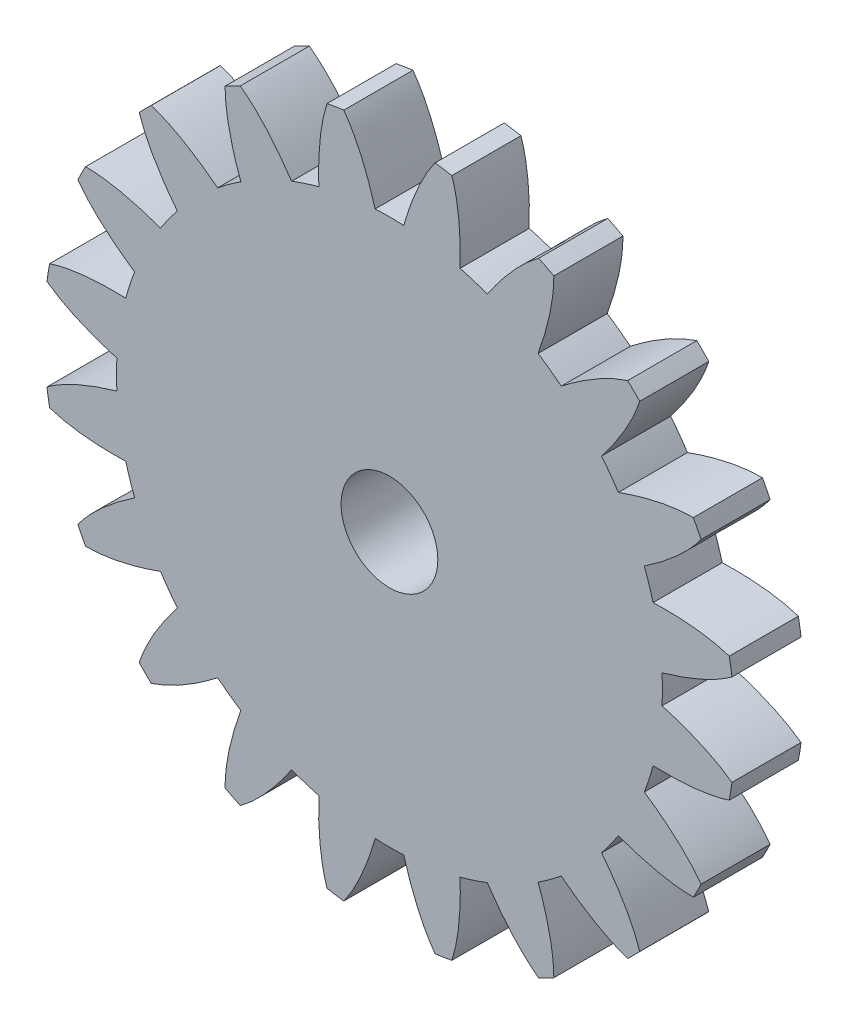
ISO-10303-21;
HEADER;
FILE_DESCRIPTION(('STEP AP214'),'2;1');
FILE_NAME('part.step','',(''),(''),'','','');
FILE_SCHEMA(('AUTOMOTIVE_DESIGN { 1 0 10303 214 1 1 1 1 }'));
ENDSEC;
DATA;
#1=APPLICATION_CONTEXT('core data for automotive mechanical design processes');
#2=APPLICATION_PROTOCOL_DEFINITION('international standard','automotive_design',2000,#1);
#3=PRODUCT_CONTEXT('',#1,'mechanical');
#4=PRODUCT('Part','Part','',(#3));
#5=PRODUCT_RELATED_PRODUCT_CATEGORY('part','',(#4));
#6=PRODUCT_DEFINITION_FORMATION('','',#4);
#7=PRODUCT_DEFINITION_CONTEXT('part definition',#1,'design');
#8=PRODUCT_DEFINITION('design','',#6,#7);
#9=PRODUCT_DEFINITION_SHAPE('','',#8);
#10=(LENGTH_UNIT() NAMED_UNIT(*) SI_UNIT(.MILLI.,.METRE.));
#11=(NAMED_UNIT(*) PLANE_ANGLE_UNIT() SI_UNIT($,.RADIAN.));
#12=(NAMED_UNIT(*) SI_UNIT($,.STERADIAN.) SOLID_ANGLE_UNIT());
#13=UNCERTAINTY_MEASURE_WITH_UNIT(LENGTH_MEASURE(1.E-05),#10,'distance_accuracy_value','');
#14=(GEOMETRIC_REPRESENTATION_CONTEXT(3) GLOBAL_UNCERTAINTY_ASSIGNED_CONTEXT((#13)) GLOBAL_UNIT_ASSIGNED_CONTEXT((#10,
#11,#12)) REPRESENTATION_CONTEXT('',''));
#15=CARTESIAN_POINT('',(0.,0.,0.));
#16=DIRECTION('',(0.,0.,1.));
#17=DIRECTION('',(1.,0.,0.));
#18=AXIS2_PLACEMENT_3D('',#15,#16,#17);
#19=CARTESIAN_POINT('',(12.4337003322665,53.9860962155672,5.));
#20=DIRECTION('',(0.,0.,1.));
#21=DIRECTION('',(1.,0.,0.));
#22=AXIS2_PLACEMENT_3D('',#19,#20,#21);
#23=PLANE('',#22);
#24=CARTESIAN_POINT('',(275880.564506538,-961150.537791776,5.));
#25=CARTESIAN_POINT('',(-271845.81673565,962391.292694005,5.));
#26=CARTESIAN_POINT('',(267860.80376609,-963416.103211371,5.));
#27=B_SPLINE_CURVE_WITH_KNOTS('',2,(#24,#25,#26),.UNSPECIFIED.,.F.,.F.,(3,3),(0.,1.),.UNSPECIFIED.);
#28=CARTESIAN_POINT('',(6.60459179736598,49.5618741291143,5.));
#29=VERTEX_POINT('',#28);
#30=CARTESIAN_POINT('',(2.06727027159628,39.4458666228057,5.));
#31=VERTEX_POINT('',#30);
#32=EDGE_CURVE('E1246',#29,#31,#27,.T.);
#33=ORIENTED_EDGE('',*,*,#32,.T.);
#34=CARTESIAN_POINT('',(0.,0.,5.));
#35=DIRECTION('',(0.,0.,1.));
#36=DIRECTION('',(1.,0.,0.));
#37=AXIS2_PLACEMENT_3D('',#34,#35,#36);
#38=CIRCLE('',#37,39.5);
#39=CARTESIAN_POINT('',(-2.06727027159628,39.4458666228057,5.));
#40=VERTEX_POINT('',#39);
#41=EDGE_CURVE('E310',#31,#40,#38,.T.);
#42=ORIENTED_EDGE('',*,*,#41,.T.);
#43=CARTESIAN_POINT('',(-267860.80376609,-963416.103211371,5.));
#44=CARTESIAN_POINT('',(271845.81673565,962391.292694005,5.));
#45=CARTESIAN_POINT('',(-275880.564506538,-961150.537791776,5.));
#46=B_SPLINE_CURVE_WITH_KNOTS('',2,(#43,#44,#45),.UNSPECIFIED.,.F.,.F.,(3,3),(0.,1.),.UNSPECIFIED.);
#47=CARTESIAN_POINT('',(-6.60459180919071,49.5618741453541,5.));
#48=VERTEX_POINT('',#47);
#49=EDGE_CURVE('E1204',#40,#48,#46,.T.);
#50=ORIENTED_EDGE('',*,*,#49,.T.);
#51=CARTESIAN_POINT('',(0.,0.,5.));
#52=DIRECTION('',(0.,0.,1.));
#53=DIRECTION('',(1.,0.,0.));
#54=AXIS2_PLACEMENT_3D('',#51,#52,#53);
#55=CIRCLE('',#54,50.);
#56=CARTESIAN_POINT('',(-9.03412131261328,49.1770744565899,5.));
#57=VERTEX_POINT('',#56);
#58=EDGE_CURVE('E1199',#48,#57,#55,.T.);
#59=ORIENTED_EDGE('',*,*,#58,.T.);
#60=CARTESIAN_POINT('',(559389.858923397,-828856.699257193,5.));
#61=CARTESIAN_POINT('',(-555936.000114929,831283.532921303,5.));
#62=CARTESIAN_POINT('',(552462.711428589,-833489.62237221,5.));
#63=B_SPLINE_CURVE_WITH_KNOTS('',2,(#60,#61,#62),.UNSPECIFIED.,.F.,.F.,(3,3),(0.,1.),.UNSPECIFIED.);
#64=CARTESIAN_POINT('',(-10.2233522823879,38.1540701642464,5.));
#65=VERTEX_POINT('',#64);
#66=EDGE_CURVE('E1194',#57,#65,#63,.T.);
#67=ORIENTED_EDGE('',*,*,#66,.T.);
#68=CARTESIAN_POINT('',(0.,0.,5.));
#69=DIRECTION('',(0.,0.,1.));
#70=DIRECTION('',(1.,0.,0.));
#71=AXIS2_PLACEMENT_3D('',#68,#69,#70);
#72=CIRCLE('',#71,39.5);
#73=CARTESIAN_POINT('',(-14.1555340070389,36.8764268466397,5.));
#74=VERTEX_POINT('',#73);
#75=EDGE_CURVE('E1175',#65,#74,#72,.T.);
#76=ORIENTED_EDGE('',*,*,#75,.T.);
#77=CARTESIAN_POINT('',(42961.1856649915,-999036.703353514,5.));
#78=CARTESIAN_POINT('',(-38854.529246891,999293.487363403,5.));
#79=CARTESIAN_POINT('',(34633.8417371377,-999360.264957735,5.));
#80=B_SPLINE_CURVE_WITH_KNOTS('',2,(#77,#78,#79),.UNSPECIFIED.,.F.,.F.,(3,3),(0.,1.),.UNSPECIFIED.);
#81=CARTESIAN_POINT('',(-21.5968014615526,45.0952122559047,5.));
#82=VERTEX_POINT('',#81);
#83=EDGE_CURVE('E1170',#74,#82,#80,.T.);
#84=ORIENTED_EDGE('',*,*,#83,.T.);
#85=CARTESIAN_POINT('',(0.,0.,5.));
#86=DIRECTION('',(0.,0.,1.));
#87=DIRECTION('',(1.,0.,0.));
#88=AXIS2_PLACEMENT_3D('',#85,#86,#87);
#89=CIRCLE('',#88,50.);
#90=CARTESIAN_POINT('',(-23.7885116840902,43.9784800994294,5.));
#91=VERTEX_POINT('',#90);
#92=EDGE_CURVE('E1165',#82,#91,#89,.T.);
#93=ORIENTED_EDGE('',*,*,#92,.T.);
#94=CARTESIAN_POINT('',(788142.176450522,-615428.592015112,5.));
#95=CARTESIAN_POINT('',(-785607.294369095,618803.949053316,5.));
#96=CARTESIAN_POINT('',(782985.719662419,-621975.370031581,5.));
#97=B_SPLINE_CURVE_WITH_KNOTS('',2,(#94,#95,#96),.UNSPECIFIED.,.F.,.F.,(3,3),(0.,1.),.UNSPECIFIED.);
#98=CARTESIAN_POINT('',(-21.5132418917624,33.1274874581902,5.));
#99=VERTEX_POINT('',#98);
#100=EDGE_CURVE('E1160',#91,#99,#97,.T.);
#101=ORIENTED_EDGE('',*,*,#100,.T.);
#102=CARTESIAN_POINT('',(0.,0.,5.));
#103=DIRECTION('',(0.,0.,1.));
#104=DIRECTION('',(1.,0.,0.));
#105=AXIS2_PLACEMENT_3D('',#102,#103,#104);
#106=CIRCLE('',#105,39.5);
#107=CARTESIAN_POINT('',(-24.8581554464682,30.6972654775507,5.));
#108=VERTEX_POINT('',#107);
#109=EDGE_CURVE('E1141',#99,#108,#106,.T.);
#110=ORIENTED_EDGE('',*,*,#109,.T.);
#111=CARTESIAN_POINT('',(349577.834915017,-936864.630273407,5.));
#112=CARTESIAN_POINT('',(-345751.523191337,938377.873002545,5.));
#113=CARTESIAN_POINT('',(341758.046243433,-939745.646437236,5.));
#114=B_SPLINE_CURVE_WITH_KNOTS('',2,(#111,#112,#113),.UNSPECIFIED.,.F.,.F.,(3,3),(0.,1.),.UNSPECIFIED.);
#115=CARTESIAN_POINT('',(-34.4749657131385,36.2143167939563,5.));
#116=VERTEX_POINT('',#115);
#117=EDGE_CURVE('E1136',#108,#116,#114,.T.);
#118=ORIENTED_EDGE('',*,*,#117,.T.);
#119=CARTESIAN_POINT('',(0.,0.,5.));
#120=DIRECTION('',(0.,0.,1.));
#121=DIRECTION('',(1.,0.,0.));
#122=AXIS2_PLACEMENT_3D('',#119,#120,#121);
#123=CIRCLE('',#122,50.);
#124=CARTESIAN_POINT('',(-36.2143167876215,34.4749656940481,5.));
#125=VERTEX_POINT('',#124);
#126=EDGE_CURVE('E1131',#116,#125,#123,.T.);
#127=ORIENTED_EDGE('',*,*,#126,.T.);
#128=CARTESIAN_POINT('',(939745.646437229,-341758.046243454,5.));
#129=CARTESIAN_POINT('',(-938377.873002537,345751.523191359,5.));
#130=CARTESIAN_POINT('',(936864.630273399,-349577.834915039,5.));
#131=B_SPLINE_CURVE_WITH_KNOTS('',2,(#128,#129,#130),.UNSPECIFIED.,.F.,.F.,(3,3),(0.,1.),.UNSPECIFIED.);
#132=CARTESIAN_POINT('',(-30.6972654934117,24.8581554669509,5.));
#133=VERTEX_POINT('',#132);
#134=EDGE_CURVE('E1126',#125,#133,#131,.T.);
#135=ORIENTED_EDGE('',*,*,#134,.T.);
#136=CARTESIAN_POINT('',(0.,0.,5.));
#137=DIRECTION('',(0.,0.,1.));
#138=DIRECTION('',(1.,0.,0.));
#139=AXIS2_PLACEMENT_3D('',#136,#137,#138);
#140=CIRCLE('',#139,39.5);
#141=CARTESIAN_POINT('',(-33.127487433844,21.513241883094,5.));
#142=VERTEX_POINT('',#141);
#143=EDGE_CURVE('E1107',#133,#142,#140,.T.);
#144=ORIENTED_EDGE('',*,*,#143,.T.);
#145=CARTESIAN_POINT('',(621975.370031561,-782985.719662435,5.));
#146=CARTESIAN_POINT('',(-618803.949053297,785607.294369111,5.));
#147=CARTESIAN_POINT('',(615428.592015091,-788142.176450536,5.));
#148=B_SPLINE_CURVE_WITH_KNOTS('',2,(#145,#146,#147),.UNSPECIFIED.,.F.,.F.,(3,3),(0.,1.),.UNSPECIFIED.);
#149=CARTESIAN_POINT('',(-43.9784801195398,23.7885116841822,5.));
#150=VERTEX_POINT('',#149);
#151=EDGE_CURVE('E1102',#142,#150,#148,.T.);
#152=ORIENTED_EDGE('',*,*,#151,.T.);
#153=CARTESIAN_POINT('',(0.,0.,5.));
#154=DIRECTION('',(0.,0.,1.));
#155=DIRECTION('',(1.,0.,0.));
#156=AXIS2_PLACEMENT_3D('',#153,#154,#155);
#157=CIRCLE('',#156,50.);
#158=CARTESIAN_POINT('',(-45.0952122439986,21.5968014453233,5.));
#159=VERTEX_POINT('',#158);
#160=EDGE_CURVE('E1097',#150,#159,#157,.T.);
#161=ORIENTED_EDGE('',*,*,#160,.T.);
#162=CARTESIAN_POINT('',(999360.264957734,-34633.8417371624,5.));
#163=CARTESIAN_POINT('',(-999293.487363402,38854.5292469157,5.));
#164=CARTESIAN_POINT('',(999036.703353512,-42961.1856650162,5.));
#165=B_SPLINE_CURVE_WITH_KNOTS('',2,(#162,#163,#164),.UNSPECIFIED.,.F.,.F.,(3,3),(0.,1.),.UNSPECIFIED.);
#166=CARTESIAN_POINT('',(-36.8764268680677,14.1555340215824,5.));
#167=VERTEX_POINT('',#166);
#168=EDGE_CURVE('E1092',#159,#167,#165,.T.);
#169=ORIENTED_EDGE('',*,*,#168,.T.);
#170=CARTESIAN_POINT('',(0.,0.,5.));
#171=DIRECTION('',(0.,0.,1.));
#172=DIRECTION('',(1.,0.,0.));
#173=AXIS2_PLACEMENT_3D('',#170,#171,#172);
#174=CIRCLE('',#173,39.5);
#175=CARTESIAN_POINT('',(-38.1540701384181,10.22335228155,5.));
#176=VERTEX_POINT('',#175);
#177=EDGE_CURVE('E1073',#167,#176,#174,.T.);
#178=ORIENTED_EDGE('',*,*,#177,.T.);
#179=CARTESIAN_POINT('',(833489.622372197,-552462.711428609,5.));
#180=CARTESIAN_POINT('',(-831283.532921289,555936.000114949,5.));
#181=CARTESIAN_POINT('',(828856.699257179,-559389.858923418,5.));
#182=B_SPLINE_CURVE_WITH_KNOTS('',2,(#179,#180,#181),.UNSPECIFIED.,.F.,.F.,(3,3),(0.,1.),.UNSPECIFIED.);
#183=CARTESIAN_POINT('',(-49.1770744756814,9.03412130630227,5.));
#184=VERTEX_POINT('',#183);
#185=EDGE_CURVE('E1068',#176,#184,#182,.T.);
#186=ORIENTED_EDGE('',*,*,#185,.T.);
#187=CARTESIAN_POINT('',(0.,0.,5.));
#188=DIRECTION('',(0.,0.,1.));
#189=DIRECTION('',(1.,0.,0.));
#190=AXIS2_PLACEMENT_3D('',#187,#188,#189);
#191=CIRCLE('',#190,50.);
#192=CARTESIAN_POINT('',(-49.5618741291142,6.6045917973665,5.));
#193=VERTEX_POINT('',#192);
#194=EDGE_CURVE('E1063',#184,#193,#191,.T.);
#195=ORIENTED_EDGE('',*,*,#194,.T.);
#196=CARTESIAN_POINT('',(961150.537791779,275880.564506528,5.));
#197=CARTESIAN_POINT('',(-962391.292694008,-271845.81673564,5.));
#198=CARTESIAN_POINT('',(963416.103211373,267860.80376608,5.));
#199=B_SPLINE_CURVE_WITH_KNOTS('',2,(#196,#197,#198),.UNSPECIFIED.,.F.,.F.,(3,3),(0.,1.),.UNSPECIFIED.);
#200=CARTESIAN_POINT('',(-39.4458666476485,2.06727027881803,5.));
#201=VERTEX_POINT('',#200);
#202=EDGE_CURVE('E1058',#193,#201,#199,.T.);
#203=ORIENTED_EDGE('',*,*,#202,.T.);
#204=CARTESIAN_POINT('',(0.,0.,5.));
#205=DIRECTION('',(0.,0.,1.));
#206=DIRECTION('',(1.,0.,0.));
#207=AXIS2_PLACEMENT_3D('',#204,#205,#206);
#208=CIRCLE('',#207,39.5);
#209=CARTESIAN_POINT('',(-39.4458666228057,-2.06727027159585,5.));
#210=VERTEX_POINT('',#209);
#211=EDGE_CURVE('E1039',#201,#210,#208,.T.);
#212=ORIENTED_EDGE('',*,*,#211,.T.);
#213=CARTESIAN_POINT('',(963416.103211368,-267860.8037661,5.));
#214=CARTESIAN_POINT('',(-962391.292694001,271845.81673566,5.));
#215=CARTESIAN_POINT('',(961150.537791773,-275880.564506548,5.));
#216=B_SPLINE_CURVE_WITH_KNOTS('',2,(#213,#214,#215),.UNSPECIFIED.,.F.,.F.,(3,3),(0.,1.),.UNSPECIFIED.);
#217=CARTESIAN_POINT('',(-49.5618741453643,-6.60459180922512,5.));
#218=VERTEX_POINT('',#217);
#219=EDGE_CURVE('E1034',#210,#218,#216,.T.);
#220=ORIENTED_EDGE('',*,*,#219,.T.);
#221=CARTESIAN_POINT('',(0.,0.,5.));
#222=DIRECTION('',(0.,0.,1.));
#223=DIRECTION('',(1.,0.,0.));
#224=AXIS2_PLACEMENT_3D('',#221,#222,#223);
#225=CIRCLE('',#224,50.);
#226=CARTESIAN_POINT('',(-49.1770744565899,-9.03412131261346,5.));
#227=VERTEX_POINT('',#226);
#228=EDGE_CURVE('E1029',#218,#227,#225,.T.);
#229=ORIENTED_EDGE('',*,*,#228,.T.);
#230=CARTESIAN_POINT('',(828856.699257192,559389.858923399,5.));
#231=CARTESIAN_POINT('',(-831283.532921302,-555936.000114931,5.));
#232=CARTESIAN_POINT('',(833489.622372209,552462.711428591,5.));
#233=B_SPLINE_CURVE_WITH_KNOTS('',2,(#230,#231,#232),.UNSPECIFIED.,.F.,.F.,(3,3),(0.,1.),.UNSPECIFIED.);
#234=CARTESIAN_POINT('',(-38.1540701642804,-10.2233522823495,5.));
#235=VERTEX_POINT('',#234);
#236=EDGE_CURVE('E1024',#227,#235,#233,.T.);
#237=ORIENTED_EDGE('',*,*,#236,.T.);
#238=CARTESIAN_POINT('',(0.,0.,5.));
#239=DIRECTION('',(0.,0.,1.));
#240=DIRECTION('',(1.,0.,0.));
#241=AXIS2_PLACEMENT_3D('',#238,#239,#240);
#242=CIRCLE('',#241,39.5);
#243=CARTESIAN_POINT('',(-36.8764268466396,-14.155534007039,5.));
#244=VERTEX_POINT('',#243);
#245=EDGE_CURVE('E1005',#235,#244,#242,.T.);
#246=ORIENTED_EDGE('',*,*,#245,.T.);
#247=CARTESIAN_POINT('',(999036.703353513,42961.1856649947,5.));
#248=CARTESIAN_POINT('',(-999293.487363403,-38854.5292468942,5.));
#249=CARTESIAN_POINT('',(999360.264957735,34633.8417371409,5.));
#250=B_SPLINE_CURVE_WITH_KNOTS('',2,(#247,#248,#249),.UNSPECIFIED.,.F.,.F.,(3,3),(0.,1.),.UNSPECIFIED.);
#251=CARTESIAN_POINT('',(-45.0952122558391,-21.5968014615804,5.));
#252=VERTEX_POINT('',#251);
#253=EDGE_CURVE('E1000',#244,#252,#250,.T.);
#254=ORIENTED_EDGE('',*,*,#253,.T.);
#255=CARTESIAN_POINT('',(0.,0.,5.));
#256=DIRECTION('',(0.,0.,1.));
#257=DIRECTION('',(1.,0.,0.));
#258=AXIS2_PLACEMENT_3D('',#255,#256,#257);
#259=CIRCLE('',#258,50.);
#260=CARTESIAN_POINT('',(-43.9784800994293,-23.7885116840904,5.));
#261=VERTEX_POINT('',#260);
#262=EDGE_CURVE('E995',#252,#261,#259,.T.);
#263=ORIENTED_EDGE('',*,*,#262,.T.);
#264=CARTESIAN_POINT('',(615428.59201511,788142.176450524,5.));
#265=CARTESIAN_POINT('',(-618803.949053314,-785607.294369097,5.));
#266=CARTESIAN_POINT('',(621975.370031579,782985.719662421,5.));
#267=B_SPLINE_CURVE_WITH_KNOTS('',2,(#264,#265,#266),.UNSPECIFIED.,.F.,.F.,(3,3),(0.,1.),.UNSPECIFIED.);
#268=CARTESIAN_POINT('',(-33.1274874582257,-21.5132418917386,5.));
#269=VERTEX_POINT('',#268);
#270=EDGE_CURVE('E990',#261,#269,#267,.T.);
#271=ORIENTED_EDGE('',*,*,#270,.T.);
#272=CARTESIAN_POINT('',(0.,0.,5.));
#273=DIRECTION('',(0.,0.,1.));
#274=DIRECTION('',(1.,0.,0.));
#275=AXIS2_PLACEMENT_3D('',#272,#273,#274);
#276=CIRCLE('',#275,39.5);
#277=CARTESIAN_POINT('',(-30.6972654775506,-24.8581554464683,5.));
#278=VERTEX_POINT('',#277);
#279=EDGE_CURVE('E971',#269,#278,#276,.T.);
#280=ORIENTED_EDGE('',*,*,#279,.T.);
#281=CARTESIAN_POINT('',(936864.630273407,349577.834915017,5.));
#282=CARTESIAN_POINT('',(-938377.873002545,-345751.523191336,5.));
#283=CARTESIAN_POINT('',(939745.646437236,341758.046243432,5.));
#284=B_SPLINE_CURVE_WITH_KNOTS('',2,(#281,#282,#283),.UNSPECIFIED.,.F.,.F.,(3,3),(0.,1.),.UNSPECIFIED.);
#285=CARTESIAN_POINT('',(-36.2143167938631,-34.4749657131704,5.));
#286=VERTEX_POINT('',#285);
#287=EDGE_CURVE('E966',#278,#286,#284,.T.);
#288=ORIENTED_EDGE('',*,*,#287,.T.);
#289=CARTESIAN_POINT('',(0.,0.,5.));
#290=DIRECTION('',(0.,0.,1.));
#291=DIRECTION('',(1.,0.,0.));
#292=AXIS2_PLACEMENT_3D('',#289,#290,#291);
#293=CIRCLE('',#292,50.);
#294=CARTESIAN_POINT('',(-34.474965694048,-36.2143167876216,5.));
#295=VERTEX_POINT('',#294);
#296=EDGE_CURVE('E961',#286,#295,#293,.T.);
#297=ORIENTED_EDGE('',*,*,#296,.T.);
#298=CARTESIAN_POINT('',(341758.046243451,939745.646437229,5.));
#299=CARTESIAN_POINT('',(-345751.523191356,-938377.873002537,5.));
#300=CARTESIAN_POINT('',(349577.834915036,936864.6302734,5.));
#301=B_SPLINE_CURVE_WITH_KNOTS('',2,(#298,#299,#300),.UNSPECIFIED.,.F.,.F.,(3,3),(0.,1.),.UNSPECIFIED.);
#302=CARTESIAN_POINT('',(-24.8581554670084,-30.6972654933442,5.));
#303=VERTEX_POINT('',#302);
#304=EDGE_CURVE('E956',#295,#303,#301,.T.);
#305=ORIENTED_EDGE('',*,*,#304,.T.);
#306=CARTESIAN_POINT('',(0.,0.,5.));
#307=DIRECTION('',(0.,0.,1.));
#308=DIRECTION('',(1.,0.,0.));
#309=AXIS2_PLACEMENT_3D('',#306,#307,#308);
#310=CIRCLE('',#309,39.5);
#311=CARTESIAN_POINT('',(-21.5132418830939,-33.1274874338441,5.));
#312=VERTEX_POINT('',#311);
#313=EDGE_CURVE('E937',#303,#312,#310,.T.);
#314=ORIENTED_EDGE('',*,*,#313,.T.);
#315=CARTESIAN_POINT('',(782985.719662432,621975.370031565,5.));
#316=CARTESIAN_POINT('',(-785607.294369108,-618803.9490533,5.));
#317=CARTESIAN_POINT('',(788142.176450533,615428.592015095,5.));
#318=B_SPLINE_CURVE_WITH_KNOTS('',2,(#315,#316,#317),.UNSPECIFIED.,.F.,.F.,(3,3),(0.,1.),.UNSPECIFIED.);
#319=CARTESIAN_POINT('',(-23.7885116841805,-43.9784801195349,5.));
#320=VERTEX_POINT('',#319);
#321=EDGE_CURVE('E932',#312,#320,#318,.T.);
#322=ORIENTED_EDGE('',*,*,#321,.T.);
#323=CARTESIAN_POINT('',(0.,0.,5.));
#324=DIRECTION('',(0.,0.,1.));
#325=DIRECTION('',(1.,0.,0.));
#326=AXIS2_PLACEMENT_3D('',#323,#324,#325);
#327=CIRCLE('',#326,50.);
#328=CARTESIAN_POINT('',(-21.5968014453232,-45.0952122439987,5.));
#329=VERTEX_POINT('',#328);
#330=EDGE_CURVE('E927',#320,#329,#327,.T.);
#331=ORIENTED_EDGE('',*,*,#330,.T.);
#332=CARTESIAN_POINT('',(34633.8417371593,999360.264957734,5.));
#333=CARTESIAN_POINT('',(-38854.5292469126,-999293.487363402,5.));
#334=CARTESIAN_POINT('',(42961.1856650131,999036.703353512,5.));
#335=B_SPLINE_CURVE_WITH_KNOTS('',2,(#332,#333,#334),.UNSPECIFIED.,.F.,.F.,(3,3),(0.,1.),.UNSPECIFIED.);
#336=CARTESIAN_POINT('',(-14.1555340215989,-36.876426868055,5.));
#337=VERTEX_POINT('',#336);
#338=EDGE_CURVE('E922',#329,#337,#335,.T.);
#339=ORIENTED_EDGE('',*,*,#338,.T.);
#340=CARTESIAN_POINT('',(0.,0.,5.));
#341=DIRECTION('',(0.,0.,1.));
#342=DIRECTION('',(1.,0.,0.));
#343=AXIS2_PLACEMENT_3D('',#340,#341,#342);
#344=CIRCLE('',#343,39.5);
#345=CARTESIAN_POINT('',(-10.2233522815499,-38.1540701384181,5.));
#346=VERTEX_POINT('',#345);
#347=EDGE_CURVE('E903',#337,#346,#344,.T.);
#348=ORIENTED_EDGE('',*,*,#347,.T.);
#349=CARTESIAN_POINT('',(552462.711428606,833489.622372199,5.));
#350=CARTESIAN_POINT('',(-555936.000114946,-831283.532921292,5.));
#351=CARTESIAN_POINT('',(559389.858923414,828856.699257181,5.));
#352=B_SPLINE_CURVE_WITH_KNOTS('',2,(#349,#350,#351),.UNSPECIFIED.,.F.,.F.,(3,3),(0.,1.),.UNSPECIFIED.);
#353=CARTESIAN_POINT('',(-9.03412130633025,-49.1770744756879,5.));
#354=VERTEX_POINT('',#353);
#355=EDGE_CURVE('E898',#346,#354,#352,.T.);
#356=ORIENTED_EDGE('',*,*,#355,.T.);
#357=CARTESIAN_POINT('',(0.,0.,5.));
#358=DIRECTION('',(0.,0.,1.));
#359=DIRECTION('',(1.,0.,0.));
#360=AXIS2_PLACEMENT_3D('',#357,#358,#359);
#361=CIRCLE('',#360,50.);
#362=CARTESIAN_POINT('',(-6.60459179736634,-49.5618741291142,5.));
#363=VERTEX_POINT('',#362);
#364=EDGE_CURVE('E893',#354,#363,#361,.T.);
#365=ORIENTED_EDGE('',*,*,#364,.T.);
#366=CARTESIAN_POINT('',(-275880.564506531,961150.537791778,5.));
#367=CARTESIAN_POINT('',(271845.816735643,-962391.292694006,5.));
#368=CARTESIAN_POINT('',(-267860.803766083,963416.103211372,5.));
#369=B_SPLINE_CURVE_WITH_KNOTS('',2,(#366,#367,#368),.UNSPECIFIED.,.F.,.F.,(3,3),(0.,1.),.UNSPECIFIED.);
#370=CARTESIAN_POINT('',(-2.06727027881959,-39.4458666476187,5.));
#371=VERTEX_POINT('',#370);
#372=EDGE_CURVE('E888',#363,#371,#369,.T.);
#373=ORIENTED_EDGE('',*,*,#372,.T.);
#374=CARTESIAN_POINT('',(0.,0.,5.));
#375=DIRECTION('',(0.,0.,1.));
#376=DIRECTION('',(1.,0.,0.));
#377=AXIS2_PLACEMENT_3D('',#374,#375,#376);
#378=CIRCLE('',#377,39.5);
#379=CARTESIAN_POINT('',(2.06727027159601,-39.4458666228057,5.));
#380=VERTEX_POINT('',#379);
#381=EDGE_CURVE('E869',#371,#380,#378,.T.);
#382=ORIENTED_EDGE('',*,*,#381,.T.);
#383=CARTESIAN_POINT('',(267860.803766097,963416.103211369,5.));
#384=CARTESIAN_POINT('',(-271845.816735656,-962391.292694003,5.));
#385=CARTESIAN_POINT('',(275880.564506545,961150.537791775,5.));
#386=B_SPLINE_CURVE_WITH_KNOTS('',2,(#383,#384,#385),.UNSPECIFIED.,.F.,.F.,(3,3),(0.,1.),.UNSPECIFIED.);
#387=CARTESIAN_POINT('',(6.60459180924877,-49.5618741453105,5.));
#388=VERTEX_POINT('',#387);
#389=EDGE_CURVE('E864',#380,#388,#386,.T.);
#390=ORIENTED_EDGE('',*,*,#389,.T.);
#391=CARTESIAN_POINT('',(0.,0.,5.));
#392=DIRECTION('',(0.,0.,1.));
#393=DIRECTION('',(1.,0.,0.));
#394=AXIS2_PLACEMENT_3D('',#391,#392,#393);
#395=CIRCLE('',#394,50.);
#396=CARTESIAN_POINT('',(9.03412131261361,-49.1770744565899,5.));
#397=VERTEX_POINT('',#396);
#398=EDGE_CURVE('E859',#388,#397,#395,.T.);
#399=ORIENTED_EDGE('',*,*,#398,.T.);
#400=CARTESIAN_POINT('',(-559389.858923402,828856.69925719,5.));
#401=CARTESIAN_POINT('',(555936.000114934,-831283.5329213,5.));
#402=CARTESIAN_POINT('',(-552462.711428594,833489.622372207,5.));
#403=B_SPLINE_CURVE_WITH_KNOTS('',2,(#400,#401,#402),.UNSPECIFIED.,.F.,.F.,(3,3),(0.,1.),.UNSPECIFIED.);
#404=CARTESIAN_POINT('',(10.2233522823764,-38.154070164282,5.));
#405=VERTEX_POINT('',#404);
#406=EDGE_CURVE('E854',#397,#405,#403,.T.);
#407=ORIENTED_EDGE('',*,*,#406,.T.);
#408=CARTESIAN_POINT('',(0.,0.,5.));
#409=DIRECTION('',(0.,0.,1.));
#410=DIRECTION('',(1.,0.,0.));
#411=AXIS2_PLACEMENT_3D('',#408,#409,#410);
#412=CIRCLE('',#411,39.5);
#413=CARTESIAN_POINT('',(14.1555340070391,-36.8764268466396,5.));
#414=VERTEX_POINT('',#413);
#415=EDGE_CURVE('E835',#405,#414,#412,.T.);
#416=ORIENTED_EDGE('',*,*,#415,.T.);
#417=CARTESIAN_POINT('',(-42961.1856649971,999036.703353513,5.));
#418=CARTESIAN_POINT('',(38854.5292468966,-999293.487363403,5.));
#419=CARTESIAN_POINT('',(-34633.8417371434,999360.264957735,5.));
#420=B_SPLINE_CURVE_WITH_KNOTS('',2,(#417,#418,#419),.UNSPECIFIED.,.F.,.F.,(3,3),(0.,1.),.UNSPECIFIED.);
#421=CARTESIAN_POINT('',(21.5968014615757,-45.0952122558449,5.));
#422=VERTEX_POINT('',#421);
#423=EDGE_CURVE('E830',#414,#422,#420,.T.);
#424=ORIENTED_EDGE('',*,*,#423,.T.);
#425=CARTESIAN_POINT('',(0.,0.,5.));
#426=DIRECTION('',(0.,0.,1.));
#427=DIRECTION('',(1.,0.,0.));
#428=AXIS2_PLACEMENT_3D('',#425,#426,#427);
#429=CIRCLE('',#428,50.);
#430=CARTESIAN_POINT('',(23.7885116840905,-43.9784800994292,5.));
#431=VERTEX_POINT('',#430);
#432=EDGE_CURVE('E825',#422,#431,#429,.T.);
#433=ORIENTED_EDGE('',*,*,#432,.T.);
#434=CARTESIAN_POINT('',(-788142.176450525,615428.592015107,5.));
#435=CARTESIAN_POINT('',(785607.294369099,-618803.949053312,5.));
#436=CARTESIAN_POINT('',(-782985.719662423,621975.370031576,5.));
#437=B_SPLINE_CURVE_WITH_KNOTS('',2,(#434,#435,#436),.UNSPECIFIED.,.F.,.F.,(3,3),(0.,1.),.UNSPECIFIED.);
#438=CARTESIAN_POINT('',(21.5132418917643,-33.1274874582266,5.));
#439=VERTEX_POINT('',#438);
#440=EDGE_CURVE('E820',#431,#439,#437,.T.);
#441=ORIENTED_EDGE('',*,*,#440,.T.);
#442=CARTESIAN_POINT('',(0.,0.,5.));
#443=DIRECTION('',(0.,0.,1.));
#444=DIRECTION('',(1.,0.,0.));
#445=AXIS2_PLACEMENT_3D('',#442,#443,#444);
#446=CIRCLE('',#445,39.5);
#447=CARTESIAN_POINT('',(24.8581554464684,-30.6972654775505,5.));
#448=VERTEX_POINT('',#447);
#449=EDGE_CURVE('E801',#439,#448,#446,.T.);
#450=ORIENTED_EDGE('',*,*,#449,.T.);
#451=CARTESIAN_POINT('',(-349577.834915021,936864.630273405,5.));
#452=CARTESIAN_POINT('',(345751.523191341,-938377.873002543,5.));
#453=CARTESIAN_POINT('',(-341758.046243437,939745.646437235,5.));
#454=B_SPLINE_CURVE_WITH_KNOTS('',2,(#451,#452,#453),.UNSPECIFIED.,.F.,.F.,(3,3),(0.,1.),.UNSPECIFIED.);
#455=CARTESIAN_POINT('',(34.4749657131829,-36.2143167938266,5.));
#456=VERTEX_POINT('',#455);
#457=EDGE_CURVE('E796',#448,#456,#454,.T.);
#458=ORIENTED_EDGE('',*,*,#457,.T.);
#459=CARTESIAN_POINT('',(0.,0.,5.));
#460=DIRECTION('',(0.,0.,1.));
#461=DIRECTION('',(1.,0.,0.));
#462=AXIS2_PLACEMENT_3D('',#459,#460,#461);
#463=CIRCLE('',#462,50.);
#464=CARTESIAN_POINT('',(36.2143167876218,-34.4749656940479,5.));
#465=VERTEX_POINT('',#464);
#466=EDGE_CURVE('E791',#456,#465,#463,.T.);
#467=ORIENTED_EDGE('',*,*,#466,.T.);
#468=CARTESIAN_POINT('',(-939745.646437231,341758.046243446,5.));
#469=CARTESIAN_POINT('',(938377.87300254,-345751.523191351,5.));
#470=CARTESIAN_POINT('',(-936864.630273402,349577.834915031,5.));
#471=B_SPLINE_CURVE_WITH_KNOTS('',2,(#468,#469,#470),.UNSPECIFIED.,.F.,.F.,(3,3),(0.,1.),.UNSPECIFIED.);
#472=CARTESIAN_POINT('',(30.6972654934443,-24.8581554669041,5.));
#473=VERTEX_POINT('',#472);
#474=EDGE_CURVE('E786',#465,#473,#471,.T.);
#475=ORIENTED_EDGE('',*,*,#474,.T.);
#476=CARTESIAN_POINT('',(0.,0.,5.));
#477=DIRECTION('',(0.,0.,1.));
#478=DIRECTION('',(1.,0.,0.));
#479=AXIS2_PLACEMENT_3D('',#476,#477,#478);
#480=CIRCLE('',#479,39.5);
#481=CARTESIAN_POINT('',(33.1274874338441,-21.5132418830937,5.));
#482=VERTEX_POINT('',#481);
#483=EDGE_CURVE('E767',#473,#482,#480,.T.);
#484=ORIENTED_EDGE('',*,*,#483,.T.);
#485=CARTESIAN_POINT('',(-621975.370031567,782985.71966243,5.));
#486=CARTESIAN_POINT('',(618803.949053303,-785607.294369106,5.));
#487=CARTESIAN_POINT('',(-615428.592015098,788142.176450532,5.));
#488=B_SPLINE_CURVE_WITH_KNOTS('',2,(#485,#486,#487),.UNSPECIFIED.,.F.,.F.,(3,3),(0.,1.),.UNSPECIFIED.);
#489=CARTESIAN_POINT('',(43.9784801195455,-23.7885116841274,5.));
#490=VERTEX_POINT('',#489);
#491=EDGE_CURVE('E762',#482,#490,#488,.T.);
#492=ORIENTED_EDGE('',*,*,#491,.T.);
#493=CARTESIAN_POINT('',(0.,0.,5.));
#494=DIRECTION('',(0.,0.,1.));
#495=DIRECTION('',(1.,0.,0.));
#496=AXIS2_PLACEMENT_3D('',#493,#494,#495);
#497=CIRCLE('',#496,50.);
#498=CARTESIAN_POINT('',(45.0952122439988,-21.596801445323,5.));
#499=VERTEX_POINT('',#498);
#500=EDGE_CURVE('E757',#490,#499,#497,.T.);
#501=ORIENTED_EDGE('',*,*,#500,.T.);
#502=CARTESIAN_POINT('',(-999360.264957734,34633.8417371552,5.));
#503=CARTESIAN_POINT('',(999293.487363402,-38854.5292469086,5.));
#504=CARTESIAN_POINT('',(-999036.703353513,42961.185665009,5.));
#505=B_SPLINE_CURVE_WITH_KNOTS('',2,(#502,#503,#504),.UNSPECIFIED.,.F.,.F.,(3,3),(0.,1.),.UNSPECIFIED.);
#506=CARTESIAN_POINT('',(36.8764268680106,-14.155534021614,5.));
#507=VERTEX_POINT('',#506);
#508=EDGE_CURVE('E752',#499,#507,#505,.T.);
#509=ORIENTED_EDGE('',*,*,#508,.T.);
#510=CARTESIAN_POINT('',(0.,0.,5.));
#511=DIRECTION('',(0.,0.,1.));
#512=DIRECTION('',(1.,0.,0.));
#513=AXIS2_PLACEMENT_3D('',#510,#511,#512);
#514=CIRCLE('',#513,39.5);
#515=CARTESIAN_POINT('',(38.1540701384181,-10.2233522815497,5.));
#516=VERTEX_POINT('',#515);
#517=EDGE_CURVE('E733',#507,#516,#514,.T.);
#518=ORIENTED_EDGE('',*,*,#517,.T.);
#519=CARTESIAN_POINT('',(-833489.622372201,552462.711428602,5.));
#520=CARTESIAN_POINT('',(831283.532921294,-555936.000114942,5.));
#521=CARTESIAN_POINT('',(-828856.699257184,559389.858923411,5.));
#522=B_SPLINE_CURVE_WITH_KNOTS('',2,(#519,#520,#521),.UNSPECIFIED.,.F.,.F.,(3,3),(0.,1.),.UNSPECIFIED.);
#523=CARTESIAN_POINT('',(49.1770744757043,-9.03412130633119,5.));
#524=VERTEX_POINT('',#523);
#525=EDGE_CURVE('E728',#516,#524,#522,.T.);
#526=ORIENTED_EDGE('',*,*,#525,.T.);
#527=CARTESIAN_POINT('',(0.,0.,5.));
#528=DIRECTION('',(0.,0.,1.));
#529=DIRECTION('',(1.,0.,0.));
#530=AXIS2_PLACEMENT_3D('',#527,#528,#529);
#531=CIRCLE('',#530,50.);
#532=CARTESIAN_POINT('',(49.5618741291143,-6.60459179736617,5.));
#533=VERTEX_POINT('',#532);
#534=EDGE_CURVE('E723',#524,#533,#531,.T.);
#535=ORIENTED_EDGE('',*,*,#534,.T.);
#536=CARTESIAN_POINT('',(-961150.537791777,-275880.564506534,5.));
#537=CARTESIAN_POINT('',(962391.292694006,271845.816735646,5.));
#538=CARTESIAN_POINT('',(-963416.103211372,-267860.803766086,5.));
#539=B_SPLINE_CURVE_WITH_KNOTS('',2,(#536,#537,#538),.UNSPECIFIED.,.F.,.F.,(3,3),(0.,1.),.UNSPECIFIED.);
#540=CARTESIAN_POINT('',(39.4458666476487,-2.06727027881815,5.));
#541=VERTEX_POINT('',#540);
#542=EDGE_CURVE('E718',#533,#541,#539,.T.);
#543=ORIENTED_EDGE('',*,*,#542,.T.);
#544=CARTESIAN_POINT('',(0.,0.,5.));
#545=DIRECTION('',(0.,0.,1.));
#546=DIRECTION('',(1.,0.,0.));
#547=AXIS2_PLACEMENT_3D('',#544,#545,#546);
#548=CIRCLE('',#547,39.5);
#549=CARTESIAN_POINT('',(39.4458666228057,2.06727027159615,5.));
#550=VERTEX_POINT('',#549);
#551=EDGE_CURVE('E699',#541,#550,#548,.T.);
#552=ORIENTED_EDGE('',*,*,#551,.T.);
#553=CARTESIAN_POINT('',(-963416.103211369,267860.803766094,5.));
#554=CARTESIAN_POINT('',(962391.292694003,-271845.816735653,5.));
#555=CARTESIAN_POINT('',(-961150.537791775,275880.564506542,5.));
#556=B_SPLINE_CURVE_WITH_KNOTS('',2,(#553,#554,#555),.UNSPECIFIED.,.F.,.F.,(3,3),(0.,1.),.UNSPECIFIED.);
#557=CARTESIAN_POINT('',(49.5618741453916,6.60459180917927,5.));
#558=VERTEX_POINT('',#557);
#559=EDGE_CURVE('E694',#550,#558,#556,.T.);
#560=ORIENTED_EDGE('',*,*,#559,.T.);
#561=CARTESIAN_POINT('',(0.,0.,5.));
#562=DIRECTION('',(0.,0.,1.));
#563=DIRECTION('',(1.,0.,0.));
#564=AXIS2_PLACEMENT_3D('',#561,#562,#563);
#565=CIRCLE('',#564,50.);
#566=CARTESIAN_POINT('',(49.1770744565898,9.03412131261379,5.));
#567=VERTEX_POINT('',#566);
#568=EDGE_CURVE('E689',#558,#567,#565,.T.);
#569=ORIENTED_EDGE('',*,*,#568,.T.);
#570=CARTESIAN_POINT('',(-828856.699257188,-559389.858923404,5.));
#571=CARTESIAN_POINT('',(831283.532921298,555936.000114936,5.));
#572=CARTESIAN_POINT('',(-833489.622372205,-552462.711428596,5.));
#573=B_SPLINE_CURVE_WITH_KNOTS('',2,(#570,#571,#572),.UNSPECIFIED.,.F.,.F.,(3,3),(0.,1.),.UNSPECIFIED.);
#574=CARTESIAN_POINT('',(38.1540701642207,10.2233522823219,5.));
#575=VERTEX_POINT('',#574);
#576=EDGE_CURVE('E684',#567,#575,#573,.T.);
#577=ORIENTED_EDGE('',*,*,#576,.T.);
#578=CARTESIAN_POINT('',(0.,0.,5.));
#579=DIRECTION('',(0.,0.,1.));
#580=DIRECTION('',(1.,0.,0.));
#581=AXIS2_PLACEMENT_3D('',#578,#579,#580);
#582=CIRCLE('',#581,39.5);
#583=CARTESIAN_POINT('',(36.8764268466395,14.1555340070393,5.));
#584=VERTEX_POINT('',#583);
#585=EDGE_CURVE('E665',#575,#584,#582,.T.);
#586=ORIENTED_EDGE('',*,*,#585,.T.);
#587=CARTESIAN_POINT('',(-999036.703353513,-42961.1856650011,5.));
#588=CARTESIAN_POINT('',(999293.487363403,38854.5292469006,5.));
#589=CARTESIAN_POINT('',(-999360.264957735,-34633.8417371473,5.));
#590=B_SPLINE_CURVE_WITH_KNOTS('',2,(#587,#588,#589),.UNSPECIFIED.,.F.,.F.,(3,3),(0.,1.),.UNSPECIFIED.);
#591=CARTESIAN_POINT('',(45.0952122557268,21.5968014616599,5.));
#592=VERTEX_POINT('',#591);
#593=EDGE_CURVE('E660',#584,#592,#590,.T.);
#594=ORIENTED_EDGE('',*,*,#593,.T.);
#595=CARTESIAN_POINT('',(0.,0.,5.));
#596=DIRECTION('',(0.,0.,1.));
#597=DIRECTION('',(1.,0.,0.));
#598=AXIS2_PLACEMENT_3D('',#595,#596,#597);
#599=CIRCLE('',#598,50.);
#600=CARTESIAN_POINT('',(43.9784800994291,23.7885116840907,5.));
#601=VERTEX_POINT('',#600);
#602=EDGE_CURVE('E655',#592,#601,#599,.T.);
#603=ORIENTED_EDGE('',*,*,#602,.T.);
#604=CARTESIAN_POINT('',(-615428.592015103,-788142.176450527,5.));
#605=CARTESIAN_POINT('',(618803.949053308,785607.294369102,5.));
#606=CARTESIAN_POINT('',(-621975.370031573,-782985.719662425,5.));
#607=B_SPLINE_CURVE_WITH_KNOTS('',2,(#604,#605,#606),.UNSPECIFIED.,.F.,.F.,(3,3),(0.,1.),.UNSPECIFIED.);
#608=CARTESIAN_POINT('',(33.1274874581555,21.5132418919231,5.));
#609=VERTEX_POINT('',#608);
#610=EDGE_CURVE('E650',#601,#609,#607,.T.);
#611=ORIENTED_EDGE('',*,*,#610,.T.);
#612=CARTESIAN_POINT('',(0.,0.,5.));
#613=DIRECTION('',(0.,0.,1.));
#614=DIRECTION('',(1.,0.,0.));
#615=AXIS2_PLACEMENT_3D('',#612,#613,#614);
#616=CIRCLE('',#615,39.5);
#617=CARTESIAN_POINT('',(30.6972654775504,24.8581554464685,5.));
#618=VERTEX_POINT('',#617);
#619=EDGE_CURVE('E631',#609,#618,#616,.T.);
#620=ORIENTED_EDGE('',*,*,#619,.T.);
#621=CARTESIAN_POINT('',(-936864.630273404,-349577.834915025,5.));
#622=CARTESIAN_POINT('',(938377.873002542,345751.523191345,5.));
#623=CARTESIAN_POINT('',(-939745.646437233,-341758.04624344,5.));
#624=B_SPLINE_CURVE_WITH_KNOTS('',2,(#621,#622,#623),.UNSPECIFIED.,.F.,.F.,(3,3),(0.,1.),.UNSPECIFIED.);
#625=CARTESIAN_POINT('',(36.214316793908,34.4749657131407,5.));
#626=VERTEX_POINT('',#625);
#627=EDGE_CURVE('E626',#618,#626,#624,.T.);
#628=ORIENTED_EDGE('',*,*,#627,.T.);
#629=CARTESIAN_POINT('',(0.,0.,5.));
#630=DIRECTION('',(0.,0.,1.));
#631=DIRECTION('',(1.,0.,0.));
#632=AXIS2_PLACEMENT_3D('',#629,#630,#631);
#633=CIRCLE('',#632,50.);
#634=CARTESIAN_POINT('',(34.4749656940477,36.2143167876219,5.));
#635=VERTEX_POINT('',#634);
#636=EDGE_CURVE('E621',#626,#635,#633,.T.);
#637=ORIENTED_EDGE('',*,*,#636,.T.);
#638=CARTESIAN_POINT('',(-341758.046243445,-939745.646437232,5.));
#639=CARTESIAN_POINT('',(345751.523191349,938377.87300254,5.));
#640=CARTESIAN_POINT('',(-349577.834915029,-936864.630273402,5.));
#641=B_SPLINE_CURVE_WITH_KNOTS('',2,(#638,#639,#640),.UNSPECIFIED.,.F.,.F.,(3,3),(0.,1.),.UNSPECIFIED.);
#642=CARTESIAN_POINT('',(24.8581554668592,30.6972654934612,5.));
#643=VERTEX_POINT('',#642);
#644=EDGE_CURVE('E616',#635,#643,#641,.T.);
#645=ORIENTED_EDGE('',*,*,#644,.T.);
#646=CARTESIAN_POINT('',(0.,0.,5.));
#647=DIRECTION('',(0.,0.,1.));
#648=DIRECTION('',(1.,0.,0.));
#649=AXIS2_PLACEMENT_3D('',#646,#647,#648);
#650=CIRCLE('',#649,39.5);
#651=CARTESIAN_POINT('',(21.5132418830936,33.1274874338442,5.));
#652=VERTEX_POINT('',#651);
#653=EDGE_CURVE('E597',#643,#652,#650,.T.);
#654=ORIENTED_EDGE('',*,*,#653,.T.);
#655=CARTESIAN_POINT('',(-782985.719662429,-621975.370031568,5.));
#656=CARTESIAN_POINT('',(785607.294369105,618803.949053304,5.));
#657=CARTESIAN_POINT('',(-788142.176450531,-615428.592015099,5.));
#658=B_SPLINE_CURVE_WITH_KNOTS('',2,(#655,#656,#657),.UNSPECIFIED.,.F.,.F.,(3,3),(0.,1.),.UNSPECIFIED.);
#659=CARTESIAN_POINT('',(23.7885116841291,43.978480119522,5.));
#660=VERTEX_POINT('',#659);
#661=EDGE_CURVE('E592',#652,#660,#658,.T.);
#662=ORIENTED_EDGE('',*,*,#661,.T.);
#663=CARTESIAN_POINT('',(0.,0.,5.));
#664=DIRECTION('',(0.,0.,1.));
#665=DIRECTION('',(1.,0.,0.));
#666=AXIS2_PLACEMENT_3D('',#663,#664,#665);
#667=CIRCLE('',#666,50.);
#668=CARTESIAN_POINT('',(21.5968014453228,45.0952122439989,5.));
#669=VERTEX_POINT('',#668);
#670=EDGE_CURVE('E587',#660,#669,#667,.T.);
#671=ORIENTED_EDGE('',*,*,#670,.T.);
#672=CARTESIAN_POINT('',(-34633.8417371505,-999360.264957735,5.));
#673=CARTESIAN_POINT('',(38854.5292469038,999293.487363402,5.));
#674=CARTESIAN_POINT('',(-42961.1856650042,-999036.703353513,5.));
#675=B_SPLINE_CURVE_WITH_KNOTS('',2,(#672,#673,#674),.UNSPECIFIED.,.F.,.F.,(3,3),(0.,1.),.UNSPECIFIED.);
#676=CARTESIAN_POINT('',(14.1555340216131,36.8764268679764,5.));
#677=VERTEX_POINT('',#676);
#678=EDGE_CURVE('E545',#669,#677,#675,.T.);
#679=ORIENTED_EDGE('',*,*,#678,.T.);
#680=CARTESIAN_POINT('',(0.,0.,5.));
#681=DIRECTION('',(0.,0.,1.));
#682=DIRECTION('',(1.,0.,0.));
#683=AXIS2_PLACEMENT_3D('',#680,#681,#682);
#684=CIRCLE('',#683,39.5);
#685=CARTESIAN_POINT('',(10.2233522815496,38.1540701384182,5.));
#686=VERTEX_POINT('',#685);
#687=EDGE_CURVE('E539',#677,#686,#684,.T.);
#688=ORIENTED_EDGE('',*,*,#687,.T.);
#689=CARTESIAN_POINT('',(-552462.7114286,-833489.622372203,5.));
#690=CARTESIAN_POINT('',(555936.00011494,831283.532921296,5.));
#691=CARTESIAN_POINT('',(-559389.858923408,-828856.699257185,5.));
#692=B_SPLINE_CURVE_WITH_KNOTS('',2,(#689,#690,#691),.UNSPECIFIED.,.F.,.F.,(3,3),(0.,1.),.UNSPECIFIED.);
#693=CARTESIAN_POINT('',(9.034121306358,49.1770744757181,5.));
#694=VERTEX_POINT('',#693);
#695=EDGE_CURVE('E543',#686,#694,#692,.T.);
#696=ORIENTED_EDGE('',*,*,#695,.T.);
#697=CARTESIAN_POINT('',(0.,0.,5.));
#698=DIRECTION('',(0.,0.,1.));
#699=DIRECTION('',(1.,0.,0.));
#700=AXIS2_PLACEMENT_3D('',#697,#698,#699);
#701=CIRCLE('',#700,50.);
#702=EDGE_CURVE('E51',#694,#29,#701,.T.);
#703=ORIENTED_EDGE('',*,*,#702,.T.);
#704=EDGE_LOOP('',(#33,#42,#50,#59,#67,#76,#84,#93,#101,#110,#118,#127,#135,#144,#152,#161,#169,
#178,#186,#195,#203,#212,#220,#229,#237,#246,#254,#263,#271,#280,#288,#297,#305,#314,#322,#331,
#339,#348,#356,#365,#373,#382,#390,#399,#407,#416,#424,#433,#441,#450,#458,#467,#475,#484,#492,
#501,#509,#518,#526,#535,#543,#552,#560,#569,#577,#586,#594,#603,#611,#620,#628,#637,#645,#654,
#662,#671,#679,#688,#696,#703));
#705=FACE_BOUND('',#704,.T.);
#706=CARTESIAN_POINT('',(0.,0.,5.));
#707=DIRECTION('',(0.,0.,1.));
#708=DIRECTION('',(1.,0.,0.));
#709=AXIS2_PLACEMENT_3D('',#706,#707,#708);
#710=CIRCLE('',#709,7.);
#711=CARTESIAN_POINT('',(7.,0.,5.));
#712=VERTEX_POINT('',#711);
#713=EDGE_CURVE('E1238',#712,#712,#710,.T.);
#714=ORIENTED_EDGE('',*,*,#713,.F.);
#715=EDGE_LOOP('',(#714));
#716=FACE_BOUND('',#715,.T.);
#717=ADVANCED_FACE('F33',(#705,#716),#23,.T.);
#718=CARTESIAN_POINT('',(12.4337003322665,53.9860962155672,-5.));
#719=DIRECTION('',(0.,0.,1.));
#720=DIRECTION('',(1.,0.,0.));
#721=AXIS2_PLACEMENT_3D('',#718,#719,#720);
#722=PLANE('',#721);
#723=CARTESIAN_POINT('',(275880.564506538,-961150.537791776,-5.));
#724=CARTESIAN_POINT('',(-271845.81673565,962391.292694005,-5.));
#725=CARTESIAN_POINT('',(267860.80376609,-963416.103211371,-5.));
#726=B_SPLINE_CURVE_WITH_KNOTS('',2,(#723,#724,#725),.UNSPECIFIED.,.F.,.F.,(3,3),(0.,1.),.UNSPECIFIED.);
#727=CARTESIAN_POINT('',(6.60459179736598,49.5618741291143,-5.));
#728=VERTEX_POINT('',#727);
#729=CARTESIAN_POINT('',(2.06727027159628,39.4458666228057,-5.));
#730=VERTEX_POINT('',#729);
#731=EDGE_CURVE('E1244',#728,#730,#726,.T.);
#732=ORIENTED_EDGE('',*,*,#731,.F.);
#733=CARTESIAN_POINT('',(0.,0.,-5.));
#734=DIRECTION('',(0.,0.,1.));
#735=DIRECTION('',(1.,0.,0.));
#736=AXIS2_PLACEMENT_3D('',#733,#734,#735);
#737=CIRCLE('',#736,50.);
#738=CARTESIAN_POINT('',(9.034121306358,49.1770744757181,-5.));
#739=VERTEX_POINT('',#738);
#740=EDGE_CURVE('E302',#739,#728,#737,.T.);
#741=ORIENTED_EDGE('',*,*,#740,.F.);
#742=CARTESIAN_POINT('',(-552462.7114286,-833489.622372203,-5.));
#743=CARTESIAN_POINT('',(555936.00011494,831283.532921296,-5.));
#744=CARTESIAN_POINT('',(-559389.858923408,-828856.699257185,-5.));
#745=B_SPLINE_CURVE_WITH_KNOTS('',2,(#742,#743,#744),.UNSPECIFIED.,.F.,.F.,(3,3),(0.,1.),.UNSPECIFIED.);
#746=CARTESIAN_POINT('',(10.2233522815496,38.1540701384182,-5.));
#747=VERTEX_POINT('',#746);
#748=EDGE_CURVE('E296',#747,#739,#745,.T.);
#749=ORIENTED_EDGE('',*,*,#748,.F.);
#750=CARTESIAN_POINT('',(0.,0.,-5.));
#751=DIRECTION('',(0.,0.,1.));
#752=DIRECTION('',(1.,0.,0.));
#753=AXIS2_PLACEMENT_3D('',#750,#751,#752);
#754=CIRCLE('',#753,39.5);
#755=CARTESIAN_POINT('',(14.1555340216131,36.8764268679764,-5.));
#756=VERTEX_POINT('',#755);
#757=EDGE_CURVE('E553',#756,#747,#754,.T.);
#758=ORIENTED_EDGE('',*,*,#757,.F.);
#759=CARTESIAN_POINT('',(-34633.8417371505,-999360.264957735,-5.));
#760=CARTESIAN_POINT('',(38854.5292469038,999293.487363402,-5.));
#761=CARTESIAN_POINT('',(-42961.1856650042,-999036.703353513,-5.));
#762=B_SPLINE_CURVE_WITH_KNOTS('',2,(#759,#760,#761),.UNSPECIFIED.,.F.,.F.,(3,3),(0.,1.),.UNSPECIFIED.);
#763=CARTESIAN_POINT('',(21.5968014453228,45.0952122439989,-5.));
#764=VERTEX_POINT('',#763);
#765=EDGE_CURVE('E1828',#764,#756,#762,.T.);
#766=ORIENTED_EDGE('',*,*,#765,.F.);
#767=CARTESIAN_POINT('',(0.,0.,-5.));
#768=DIRECTION('',(0.,0.,1.));
#769=DIRECTION('',(1.,0.,0.));
#770=AXIS2_PLACEMENT_3D('',#767,#768,#769);
#771=CIRCLE('',#770,50.);
#772=CARTESIAN_POINT('',(23.7885116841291,43.978480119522,-5.));
#773=VERTEX_POINT('',#772);
#774=EDGE_CURVE('E1823',#773,#764,#771,.T.);
#775=ORIENTED_EDGE('',*,*,#774,.F.);
#776=CARTESIAN_POINT('',(-782985.719662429,-621975.370031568,-5.));
#777=CARTESIAN_POINT('',(785607.294369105,618803.949053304,-5.));
#778=CARTESIAN_POINT('',(-788142.176450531,-615428.592015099,-5.));
#779=B_SPLINE_CURVE_WITH_KNOTS('',2,(#776,#777,#778),.UNSPECIFIED.,.F.,.F.,(3,3),(0.,1.),.UNSPECIFIED.);
#780=CARTESIAN_POINT('',(21.5132418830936,33.1274874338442,-5.));
#781=VERTEX_POINT('',#780);
#782=EDGE_CURVE('E1819',#781,#773,#779,.T.);
#783=ORIENTED_EDGE('',*,*,#782,.F.);
#784=CARTESIAN_POINT('',(0.,0.,-5.));
#785=DIRECTION('',(0.,0.,1.));
#786=DIRECTION('',(1.,0.,0.));
#787=AXIS2_PLACEMENT_3D('',#784,#785,#786);
#788=CIRCLE('',#787,39.5);
#789=CARTESIAN_POINT('',(24.8581554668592,30.6972654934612,-5.));
#790=VERTEX_POINT('',#789);
#791=EDGE_CURVE('E1814',#790,#781,#788,.T.);
#792=ORIENTED_EDGE('',*,*,#791,.F.);
#793=CARTESIAN_POINT('',(-341758.046243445,-939745.646437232,-5.));
#794=CARTESIAN_POINT('',(345751.523191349,938377.87300254,-5.));
#795=CARTESIAN_POINT('',(-349577.834915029,-936864.630273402,-5.));
#796=B_SPLINE_CURVE_WITH_KNOTS('',2,(#793,#794,#795),.UNSPECIFIED.,.F.,.F.,(3,3),(0.,1.),.UNSPECIFIED.);
#797=CARTESIAN_POINT('',(34.4749656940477,36.2143167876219,-5.));
#798=VERTEX_POINT('',#797);
#799=EDGE_CURVE('E1810',#798,#790,#796,.T.);
#800=ORIENTED_EDGE('',*,*,#799,.F.);
#801=CARTESIAN_POINT('',(0.,0.,-5.));
#802=DIRECTION('',(0.,0.,1.));
#803=DIRECTION('',(1.,0.,0.));
#804=AXIS2_PLACEMENT_3D('',#801,#802,#803);
#805=CIRCLE('',#804,50.);
#806=CARTESIAN_POINT('',(36.214316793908,34.4749657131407,-5.));
#807=VERTEX_POINT('',#806);
#808=EDGE_CURVE('E1805',#807,#798,#805,.T.);
#809=ORIENTED_EDGE('',*,*,#808,.F.);
#810=CARTESIAN_POINT('',(-936864.630273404,-349577.834915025,-5.));
#811=CARTESIAN_POINT('',(938377.873002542,345751.523191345,-5.));
#812=CARTESIAN_POINT('',(-939745.646437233,-341758.04624344,-5.));
#813=B_SPLINE_CURVE_WITH_KNOTS('',2,(#810,#811,#812),.UNSPECIFIED.,.F.,.F.,(3,3),(0.,1.),.UNSPECIFIED.);
#814=CARTESIAN_POINT('',(30.6972654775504,24.8581554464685,-5.));
#815=VERTEX_POINT('',#814);
#816=EDGE_CURVE('E1801',#815,#807,#813,.T.);
#817=ORIENTED_EDGE('',*,*,#816,.F.);
#818=CARTESIAN_POINT('',(0.,0.,-5.));
#819=DIRECTION('',(0.,0.,1.));
#820=DIRECTION('',(1.,0.,0.));
#821=AXIS2_PLACEMENT_3D('',#818,#819,#820);
#822=CIRCLE('',#821,39.5);
#823=CARTESIAN_POINT('',(33.1274874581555,21.5132418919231,-5.));
#824=VERTEX_POINT('',#823);
#825=EDGE_CURVE('E1796',#824,#815,#822,.T.);
#826=ORIENTED_EDGE('',*,*,#825,.F.);
#827=CARTESIAN_POINT('',(-615428.592015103,-788142.176450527,-5.));
#828=CARTESIAN_POINT('',(618803.949053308,785607.294369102,-5.));
#829=CARTESIAN_POINT('',(-621975.370031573,-782985.719662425,-5.));
#830=B_SPLINE_CURVE_WITH_KNOTS('',2,(#827,#828,#829),.UNSPECIFIED.,.F.,.F.,(3,3),(0.,1.),.UNSPECIFIED.);
#831=CARTESIAN_POINT('',(43.9784800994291,23.7885116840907,-5.));
#832=VERTEX_POINT('',#831);
#833=EDGE_CURVE('E1792',#832,#824,#830,.T.);
#834=ORIENTED_EDGE('',*,*,#833,.F.);
#835=CARTESIAN_POINT('',(0.,0.,-5.));
#836=DIRECTION('',(0.,0.,1.));
#837=DIRECTION('',(1.,0.,0.));
#838=AXIS2_PLACEMENT_3D('',#835,#836,#837);
#839=CIRCLE('',#838,50.);
#840=CARTESIAN_POINT('',(45.0952122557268,21.5968014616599,-5.));
#841=VERTEX_POINT('',#840);
#842=EDGE_CURVE('E1787',#841,#832,#839,.T.);
#843=ORIENTED_EDGE('',*,*,#842,.F.);
#844=CARTESIAN_POINT('',(-999036.703353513,-42961.1856650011,-5.));
#845=CARTESIAN_POINT('',(999293.487363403,38854.5292469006,-5.));
#846=CARTESIAN_POINT('',(-999360.264957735,-34633.8417371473,-5.));
#847=B_SPLINE_CURVE_WITH_KNOTS('',2,(#844,#845,#846),.UNSPECIFIED.,.F.,.F.,(3,3),(0.,1.),.UNSPECIFIED.);
#848=CARTESIAN_POINT('',(36.8764268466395,14.1555340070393,-5.));
#849=VERTEX_POINT('',#848);
#850=EDGE_CURVE('E1783',#849,#841,#847,.T.);
#851=ORIENTED_EDGE('',*,*,#850,.F.);
#852=CARTESIAN_POINT('',(0.,0.,-5.));
#853=DIRECTION('',(0.,0.,1.));
#854=DIRECTION('',(1.,0.,0.));
#855=AXIS2_PLACEMENT_3D('',#852,#853,#854);
#856=CIRCLE('',#855,39.5);
#857=CARTESIAN_POINT('',(38.1540701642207,10.2233522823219,-5.));
#858=VERTEX_POINT('',#857);
#859=EDGE_CURVE('E1778',#858,#849,#856,.T.);
#860=ORIENTED_EDGE('',*,*,#859,.F.);
#861=CARTESIAN_POINT('',(-828856.699257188,-559389.858923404,-5.));
#862=CARTESIAN_POINT('',(831283.532921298,555936.000114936,-5.));
#863=CARTESIAN_POINT('',(-833489.622372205,-552462.711428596,-5.));
#864=B_SPLINE_CURVE_WITH_KNOTS('',2,(#861,#862,#863),.UNSPECIFIED.,.F.,.F.,(3,3),(0.,1.),.UNSPECIFIED.);
#865=CARTESIAN_POINT('',(49.1770744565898,9.03412131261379,-5.));
#866=VERTEX_POINT('',#865);
#867=EDGE_CURVE('E1774',#866,#858,#864,.T.);
#868=ORIENTED_EDGE('',*,*,#867,.F.);
#869=CARTESIAN_POINT('',(0.,0.,-5.));
#870=DIRECTION('',(0.,0.,1.));
#871=DIRECTION('',(1.,0.,0.));
#872=AXIS2_PLACEMENT_3D('',#869,#870,#871);
#873=CIRCLE('',#872,50.);
#874=CARTESIAN_POINT('',(49.5618741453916,6.60459180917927,-5.));
#875=VERTEX_POINT('',#874);
#876=EDGE_CURVE('E1769',#875,#866,#873,.T.);
#877=ORIENTED_EDGE('',*,*,#876,.F.);
#878=CARTESIAN_POINT('',(-963416.103211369,267860.803766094,-5.));
#879=CARTESIAN_POINT('',(962391.292694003,-271845.816735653,-5.));
#880=CARTESIAN_POINT('',(-961150.537791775,275880.564506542,-5.));
#881=B_SPLINE_CURVE_WITH_KNOTS('',2,(#878,#879,#880),.UNSPECIFIED.,.F.,.F.,(3,3),(0.,1.),.UNSPECIFIED.);
#882=CARTESIAN_POINT('',(39.4458666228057,2.06727027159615,-5.));
#883=VERTEX_POINT('',#882);
#884=EDGE_CURVE('E1765',#883,#875,#881,.T.);
#885=ORIENTED_EDGE('',*,*,#884,.F.);
#886=CARTESIAN_POINT('',(0.,0.,-5.));
#887=DIRECTION('',(0.,0.,1.));
#888=DIRECTION('',(1.,0.,0.));
#889=AXIS2_PLACEMENT_3D('',#886,#887,#888);
#890=CIRCLE('',#889,39.5);
#891=CARTESIAN_POINT('',(39.4458666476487,-2.06727027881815,-5.));
#892=VERTEX_POINT('',#891);
#893=EDGE_CURVE('E1760',#892,#883,#890,.T.);
#894=ORIENTED_EDGE('',*,*,#893,.F.);
#895=CARTESIAN_POINT('',(-961150.537791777,-275880.564506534,-5.));
#896=CARTESIAN_POINT('',(962391.292694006,271845.816735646,-5.));
#897=CARTESIAN_POINT('',(-963416.103211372,-267860.803766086,-5.));
#898=B_SPLINE_CURVE_WITH_KNOTS('',2,(#895,#896,#897),.UNSPECIFIED.,.F.,.F.,(3,3),(0.,1.),.UNSPECIFIED.);
#899=CARTESIAN_POINT('',(49.5618741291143,-6.60459179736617,-5.));
#900=VERTEX_POINT('',#899);
#901=EDGE_CURVE('E1756',#900,#892,#898,.T.);
#902=ORIENTED_EDGE('',*,*,#901,.F.);
#903=CARTESIAN_POINT('',(0.,0.,-5.));
#904=DIRECTION('',(0.,0.,1.));
#905=DIRECTION('',(1.,0.,0.));
#906=AXIS2_PLACEMENT_3D('',#903,#904,#905);
#907=CIRCLE('',#906,50.);
#908=CARTESIAN_POINT('',(49.1770744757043,-9.03412130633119,-5.));
#909=VERTEX_POINT('',#908);
#910=EDGE_CURVE('E1751',#909,#900,#907,.T.);
#911=ORIENTED_EDGE('',*,*,#910,.F.);
#912=CARTESIAN_POINT('',(-833489.622372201,552462.711428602,-5.));
#913=CARTESIAN_POINT('',(831283.532921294,-555936.000114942,-5.));
#914=CARTESIAN_POINT('',(-828856.699257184,559389.858923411,-5.));
#915=B_SPLINE_CURVE_WITH_KNOTS('',2,(#912,#913,#914),.UNSPECIFIED.,.F.,.F.,(3,3),(0.,1.),.UNSPECIFIED.);
#916=CARTESIAN_POINT('',(38.1540701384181,-10.2233522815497,-5.));
#917=VERTEX_POINT('',#916);
#918=EDGE_CURVE('E1747',#917,#909,#915,.T.);
#919=ORIENTED_EDGE('',*,*,#918,.F.);
#920=CARTESIAN_POINT('',(0.,0.,-5.));
#921=DIRECTION('',(0.,0.,1.));
#922=DIRECTION('',(1.,0.,0.));
#923=AXIS2_PLACEMENT_3D('',#920,#921,#922);
#924=CIRCLE('',#923,39.5);
#925=CARTESIAN_POINT('',(36.8764268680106,-14.155534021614,-5.));
#926=VERTEX_POINT('',#925);
#927=EDGE_CURVE('E1742',#926,#917,#924,.T.);
#928=ORIENTED_EDGE('',*,*,#927,.F.);
#929=CARTESIAN_POINT('',(-999360.264957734,34633.8417371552,-5.));
#930=CARTESIAN_POINT('',(999293.487363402,-38854.5292469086,-5.));
#931=CARTESIAN_POINT('',(-999036.703353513,42961.185665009,-5.));
#932=B_SPLINE_CURVE_WITH_KNOTS('',2,(#929,#930,#931),.UNSPECIFIED.,.F.,.F.,(3,3),(0.,1.),.UNSPECIFIED.);
#933=CARTESIAN_POINT('',(45.0952122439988,-21.596801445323,-5.));
#934=VERTEX_POINT('',#933);
#935=EDGE_CURVE('E1738',#934,#926,#932,.T.);
#936=ORIENTED_EDGE('',*,*,#935,.F.);
#937=CARTESIAN_POINT('',(0.,0.,-5.));
#938=DIRECTION('',(0.,0.,1.));
#939=DIRECTION('',(1.,0.,0.));
#940=AXIS2_PLACEMENT_3D('',#937,#938,#939);
#941=CIRCLE('',#940,50.);
#942=CARTESIAN_POINT('',(43.9784801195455,-23.7885116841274,-5.));
#943=VERTEX_POINT('',#942);
#944=EDGE_CURVE('E1733',#943,#934,#941,.T.);
#945=ORIENTED_EDGE('',*,*,#944,.F.);
#946=CARTESIAN_POINT('',(-621975.370031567,782985.71966243,-5.));
#947=CARTESIAN_POINT('',(618803.949053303,-785607.294369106,-5.));
#948=CARTESIAN_POINT('',(-615428.592015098,788142.176450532,-5.));
#949=B_SPLINE_CURVE_WITH_KNOTS('',2,(#946,#947,#948),.UNSPECIFIED.,.F.,.F.,(3,3),(0.,1.),.UNSPECIFIED.);
#950=CARTESIAN_POINT('',(33.1274874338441,-21.5132418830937,-5.));
#951=VERTEX_POINT('',#950);
#952=EDGE_CURVE('E1729',#951,#943,#949,.T.);
#953=ORIENTED_EDGE('',*,*,#952,.F.);
#954=CARTESIAN_POINT('',(0.,0.,-5.));
#955=DIRECTION('',(0.,0.,1.));
#956=DIRECTION('',(1.,0.,0.));
#957=AXIS2_PLACEMENT_3D('',#954,#955,#956);
#958=CIRCLE('',#957,39.5);
#959=CARTESIAN_POINT('',(30.6972654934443,-24.8581554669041,-5.));
#960=VERTEX_POINT('',#959);
#961=EDGE_CURVE('E1724',#960,#951,#958,.T.);
#962=ORIENTED_EDGE('',*,*,#961,.F.);
#963=CARTESIAN_POINT('',(-939745.646437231,341758.046243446,-5.));
#964=CARTESIAN_POINT('',(938377.87300254,-345751.523191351,-5.));
#965=CARTESIAN_POINT('',(-936864.630273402,349577.834915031,-5.));
#966=B_SPLINE_CURVE_WITH_KNOTS('',2,(#963,#964,#965),.UNSPECIFIED.,.F.,.F.,(3,3),(0.,1.),.UNSPECIFIED.);
#967=CARTESIAN_POINT('',(36.2143167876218,-34.4749656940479,-5.));
#968=VERTEX_POINT('',#967);
#969=EDGE_CURVE('E1720',#968,#960,#966,.T.);
#970=ORIENTED_EDGE('',*,*,#969,.F.);
#971=CARTESIAN_POINT('',(0.,0.,-5.));
#972=DIRECTION('',(0.,0.,1.));
#973=DIRECTION('',(1.,0.,0.));
#974=AXIS2_PLACEMENT_3D('',#971,#972,#973);
#975=CIRCLE('',#974,50.);
#976=CARTESIAN_POINT('',(34.4749657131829,-36.2143167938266,-5.));
#977=VERTEX_POINT('',#976);
#978=EDGE_CURVE('E1715',#977,#968,#975,.T.);
#979=ORIENTED_EDGE('',*,*,#978,.F.);
#980=CARTESIAN_POINT('',(-349577.834915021,936864.630273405,-5.));
#981=CARTESIAN_POINT('',(345751.523191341,-938377.873002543,-5.));
#982=CARTESIAN_POINT('',(-341758.046243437,939745.646437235,-5.));
#983=B_SPLINE_CURVE_WITH_KNOTS('',2,(#980,#981,#982),.UNSPECIFIED.,.F.,.F.,(3,3),(0.,1.),.UNSPECIFIED.);
#984=CARTESIAN_POINT('',(24.8581554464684,-30.6972654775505,-5.));
#985=VERTEX_POINT('',#984);
#986=EDGE_CURVE('E1711',#985,#977,#983,.T.);
#987=ORIENTED_EDGE('',*,*,#986,.F.);
#988=CARTESIAN_POINT('',(0.,0.,-5.));
#989=DIRECTION('',(0.,0.,1.));
#990=DIRECTION('',(1.,0.,0.));
#991=AXIS2_PLACEMENT_3D('',#988,#989,#990);
#992=CIRCLE('',#991,39.5);
#993=CARTESIAN_POINT('',(21.5132418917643,-33.1274874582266,-5.));
#994=VERTEX_POINT('',#993);
#995=EDGE_CURVE('E1706',#994,#985,#992,.T.);
#996=ORIENTED_EDGE('',*,*,#995,.F.);
#997=CARTESIAN_POINT('',(-788142.176450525,615428.592015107,-5.));
#998=CARTESIAN_POINT('',(785607.294369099,-618803.949053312,-5.));
#999=CARTESIAN_POINT('',(-782985.719662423,621975.370031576,-5.));
#1000=B_SPLINE_CURVE_WITH_KNOTS('',2,(#997,#998,#999),.UNSPECIFIED.,.F.,.F.,(3,3),(0.,1.),.UNSPECIFIED.);
#1001=CARTESIAN_POINT('',(23.7885116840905,-43.9784800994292,-5.));
#1002=VERTEX_POINT('',#1001);
#1003=EDGE_CURVE('E1702',#1002,#994,#1000,.T.);
#1004=ORIENTED_EDGE('',*,*,#1003,.F.);
#1005=CARTESIAN_POINT('',(0.,0.,-5.));
#1006=DIRECTION('',(0.,0.,1.));
#1007=DIRECTION('',(1.,0.,0.));
#1008=AXIS2_PLACEMENT_3D('',#1005,#1006,#1007);
#1009=CIRCLE('',#1008,50.);
#1010=CARTESIAN_POINT('',(21.5968014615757,-45.0952122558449,-5.));
#1011=VERTEX_POINT('',#1010);
#1012=EDGE_CURVE('E1697',#1011,#1002,#1009,.T.);
#1013=ORIENTED_EDGE('',*,*,#1012,.F.);
#1014=CARTESIAN_POINT('',(-42961.1856649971,999036.703353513,-5.));
#1015=CARTESIAN_POINT('',(38854.5292468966,-999293.487363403,-5.));
#1016=CARTESIAN_POINT('',(-34633.8417371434,999360.264957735,-5.));
#1017=B_SPLINE_CURVE_WITH_KNOTS('',2,(#1014,#1015,#1016),.UNSPECIFIED.,.F.,.F.,(3,3),(0.,1.),.UNSPECIFIED.);
#1018=CARTESIAN_POINT('',(14.1555340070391,-36.8764268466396,-5.));
#1019=VERTEX_POINT('',#1018);
#1020=EDGE_CURVE('E1693',#1019,#1011,#1017,.T.);
#1021=ORIENTED_EDGE('',*,*,#1020,.F.);
#1022=CARTESIAN_POINT('',(0.,0.,-5.));
#1023=DIRECTION('',(0.,0.,1.));
#1024=DIRECTION('',(1.,0.,0.));
#1025=AXIS2_PLACEMENT_3D('',#1022,#1023,#1024);
#1026=CIRCLE('',#1025,39.5);
#1027=CARTESIAN_POINT('',(10.2233522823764,-38.154070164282,-5.));
#1028=VERTEX_POINT('',#1027);
#1029=EDGE_CURVE('E1688',#1028,#1019,#1026,.T.);
#1030=ORIENTED_EDGE('',*,*,#1029,.F.);
#1031=CARTESIAN_POINT('',(-559389.858923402,828856.69925719,-5.));
#1032=CARTESIAN_POINT('',(555936.000114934,-831283.5329213,-5.));
#1033=CARTESIAN_POINT('',(-552462.711428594,833489.622372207,-5.));
#1034=B_SPLINE_CURVE_WITH_KNOTS('',2,(#1031,#1032,#1033),.UNSPECIFIED.,.F.,.F.,(3,3),(0.,1.),.UNSPECIFIED.);
#1035=CARTESIAN_POINT('',(9.03412131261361,-49.1770744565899,-5.));
#1036=VERTEX_POINT('',#1035);
#1037=EDGE_CURVE('E1684',#1036,#1028,#1034,.T.);
#1038=ORIENTED_EDGE('',*,*,#1037,.F.);
#1039=CARTESIAN_POINT('',(0.,0.,-5.));
#1040=DIRECTION('',(0.,0.,1.));
#1041=DIRECTION('',(1.,0.,0.));
#1042=AXIS2_PLACEMENT_3D('',#1039,#1040,#1041);
#1043=CIRCLE('',#1042,50.);
#1044=CARTESIAN_POINT('',(6.60459180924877,-49.5618741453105,-5.));
#1045=VERTEX_POINT('',#1044);
#1046=EDGE_CURVE('E1679',#1045,#1036,#1043,.T.);
#1047=ORIENTED_EDGE('',*,*,#1046,.F.);
#1048=CARTESIAN_POINT('',(267860.803766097,963416.103211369,-5.));
#1049=CARTESIAN_POINT('',(-271845.816735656,-962391.292694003,-5.));
#1050=CARTESIAN_POINT('',(275880.564506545,961150.537791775,-5.));
#1051=B_SPLINE_CURVE_WITH_KNOTS('',2,(#1048,#1049,#1050),.UNSPECIFIED.,.F.,.F.,(3,3),(0.,1.),.UNSPECIFIED.);
#1052=CARTESIAN_POINT('',(2.06727027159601,-39.4458666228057,-5.));
#1053=VERTEX_POINT('',#1052);
#1054=EDGE_CURVE('E1675',#1053,#1045,#1051,.T.);
#1055=ORIENTED_EDGE('',*,*,#1054,.F.);
#1056=CARTESIAN_POINT('',(0.,0.,-5.));
#1057=DIRECTION('',(0.,0.,1.));
#1058=DIRECTION('',(1.,0.,0.));
#1059=AXIS2_PLACEMENT_3D('',#1056,#1057,#1058);
#1060=CIRCLE('',#1059,39.5);
#1061=CARTESIAN_POINT('',(-2.06727027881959,-39.4458666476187,-5.));
#1062=VERTEX_POINT('',#1061);
#1063=EDGE_CURVE('E1670',#1062,#1053,#1060,.T.);
#1064=ORIENTED_EDGE('',*,*,#1063,.F.);
#1065=CARTESIAN_POINT('',(-275880.564506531,961150.537791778,-5.));
#1066=CARTESIAN_POINT('',(271845.816735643,-962391.292694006,-5.));
#1067=CARTESIAN_POINT('',(-267860.803766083,963416.103211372,-5.));
#1068=B_SPLINE_CURVE_WITH_KNOTS('',2,(#1065,#1066,#1067),.UNSPECIFIED.,.F.,.F.,(3,3),(0.,1.),.UNSPECIFIED.);
#1069=CARTESIAN_POINT('',(-6.60459179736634,-49.5618741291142,-5.));
#1070=VERTEX_POINT('',#1069);
#1071=EDGE_CURVE('E1666',#1070,#1062,#1068,.T.);
#1072=ORIENTED_EDGE('',*,*,#1071,.F.);
#1073=CARTESIAN_POINT('',(0.,0.,-5.));
#1074=DIRECTION('',(0.,0.,1.));
#1075=DIRECTION('',(1.,0.,0.));
#1076=AXIS2_PLACEMENT_3D('',#1073,#1074,#1075);
#1077=CIRCLE('',#1076,50.);
#1078=CARTESIAN_POINT('',(-9.03412130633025,-49.1770744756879,-5.));
#1079=VERTEX_POINT('',#1078);
#1080=EDGE_CURVE('E1661',#1079,#1070,#1077,.T.);
#1081=ORIENTED_EDGE('',*,*,#1080,.F.);
#1082=CARTESIAN_POINT('',(552462.711428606,833489.622372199,-5.));
#1083=CARTESIAN_POINT('',(-555936.000114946,-831283.532921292,-5.));
#1084=CARTESIAN_POINT('',(559389.858923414,828856.699257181,-5.));
#1085=B_SPLINE_CURVE_WITH_KNOTS('',2,(#1082,#1083,#1084),.UNSPECIFIED.,.F.,.F.,(3,3),(0.,1.),.UNSPECIFIED.);
#1086=CARTESIAN_POINT('',(-10.2233522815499,-38.1540701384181,-5.));
#1087=VERTEX_POINT('',#1086);
#1088=EDGE_CURVE('E1657',#1087,#1079,#1085,.T.);
#1089=ORIENTED_EDGE('',*,*,#1088,.F.);
#1090=CARTESIAN_POINT('',(0.,0.,-5.));
#1091=DIRECTION('',(0.,0.,1.));
#1092=DIRECTION('',(1.,0.,0.));
#1093=AXIS2_PLACEMENT_3D('',#1090,#1091,#1092);
#1094=CIRCLE('',#1093,39.5);
#1095=CARTESIAN_POINT('',(-14.1555340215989,-36.876426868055,-5.));
#1096=VERTEX_POINT('',#1095);
#1097=EDGE_CURVE('E1652',#1096,#1087,#1094,.T.);
#1098=ORIENTED_EDGE('',*,*,#1097,.F.);
#1099=CARTESIAN_POINT('',(34633.8417371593,999360.264957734,-5.));
#1100=CARTESIAN_POINT('',(-38854.5292469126,-999293.487363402,-5.));
#1101=CARTESIAN_POINT('',(42961.1856650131,999036.703353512,-5.));
#1102=B_SPLINE_CURVE_WITH_KNOTS('',2,(#1099,#1100,#1101),.UNSPECIFIED.,.F.,.F.,(3,3),(0.,1.),.UNSPECIFIED.);
#1103=CARTESIAN_POINT('',(-21.5968014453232,-45.0952122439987,-5.));
#1104=VERTEX_POINT('',#1103);
#1105=EDGE_CURVE('E1648',#1104,#1096,#1102,.T.);
#1106=ORIENTED_EDGE('',*,*,#1105,.F.);
#1107=CARTESIAN_POINT('',(0.,0.,-5.));
#1108=DIRECTION('',(0.,0.,1.));
#1109=DIRECTION('',(1.,0.,0.));
#1110=AXIS2_PLACEMENT_3D('',#1107,#1108,#1109);
#1111=CIRCLE('',#1110,50.);
#1112=CARTESIAN_POINT('',(-23.7885116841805,-43.9784801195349,-5.));
#1113=VERTEX_POINT('',#1112);
#1114=EDGE_CURVE('E1643',#1113,#1104,#1111,.T.);
#1115=ORIENTED_EDGE('',*,*,#1114,.F.);
#1116=CARTESIAN_POINT('',(782985.719662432,621975.370031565,-5.));
#1117=CARTESIAN_POINT('',(-785607.294369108,-618803.9490533,-5.));
#1118=CARTESIAN_POINT('',(788142.176450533,615428.592015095,-5.));
#1119=B_SPLINE_CURVE_WITH_KNOTS('',2,(#1116,#1117,#1118),.UNSPECIFIED.,.F.,.F.,(3,3),(0.,1.),.UNSPECIFIED.);
#1120=CARTESIAN_POINT('',(-21.5132418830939,-33.1274874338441,-5.));
#1121=VERTEX_POINT('',#1120);
#1122=EDGE_CURVE('E1639',#1121,#1113,#1119,.T.);
#1123=ORIENTED_EDGE('',*,*,#1122,.F.);
#1124=CARTESIAN_POINT('',(0.,0.,-5.));
#1125=DIRECTION('',(0.,0.,1.));
#1126=DIRECTION('',(1.,0.,0.));
#1127=AXIS2_PLACEMENT_3D('',#1124,#1125,#1126);
#1128=CIRCLE('',#1127,39.5);
#1129=CARTESIAN_POINT('',(-24.8581554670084,-30.6972654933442,-5.));
#1130=VERTEX_POINT('',#1129);
#1131=EDGE_CURVE('E1634',#1130,#1121,#1128,.T.);
#1132=ORIENTED_EDGE('',*,*,#1131,.F.);
#1133=CARTESIAN_POINT('',(341758.046243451,939745.646437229,-5.));
#1134=CARTESIAN_POINT('',(-345751.523191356,-938377.873002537,-5.));
#1135=CARTESIAN_POINT('',(349577.834915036,936864.6302734,-5.));
#1136=B_SPLINE_CURVE_WITH_KNOTS('',2,(#1133,#1134,#1135),.UNSPECIFIED.,.F.,.F.,(3,3),(0.,1.),.UNSPECIFIED.);
#1137=CARTESIAN_POINT('',(-34.474965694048,-36.2143167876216,-5.));
#1138=VERTEX_POINT('',#1137);
#1139=EDGE_CURVE('E1630',#1138,#1130,#1136,.T.);
#1140=ORIENTED_EDGE('',*,*,#1139,.F.);
#1141=CARTESIAN_POINT('',(0.,0.,-5.));
#1142=DIRECTION('',(0.,0.,1.));
#1143=DIRECTION('',(1.,0.,0.));
#1144=AXIS2_PLACEMENT_3D('',#1141,#1142,#1143);
#1145=CIRCLE('',#1144,50.);
#1146=CARTESIAN_POINT('',(-36.2143167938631,-34.4749657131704,-5.));
#1147=VERTEX_POINT('',#1146);
#1148=EDGE_CURVE('E1625',#1147,#1138,#1145,.T.);
#1149=ORIENTED_EDGE('',*,*,#1148,.F.);
#1150=CARTESIAN_POINT('',(936864.630273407,349577.834915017,-5.));
#1151=CARTESIAN_POINT('',(-938377.873002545,-345751.523191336,-5.));
#1152=CARTESIAN_POINT('',(939745.646437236,341758.046243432,-5.));
#1153=B_SPLINE_CURVE_WITH_KNOTS('',2,(#1150,#1151,#1152),.UNSPECIFIED.,.F.,.F.,(3,3),(0.,1.),.UNSPECIFIED.);
#1154=CARTESIAN_POINT('',(-30.6972654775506,-24.8581554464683,-5.));
#1155=VERTEX_POINT('',#1154);
#1156=EDGE_CURVE('E1621',#1155,#1147,#1153,.T.);
#1157=ORIENTED_EDGE('',*,*,#1156,.F.);
#1158=CARTESIAN_POINT('',(0.,0.,-5.));
#1159=DIRECTION('',(0.,0.,1.));
#1160=DIRECTION('',(1.,0.,0.));
#1161=AXIS2_PLACEMENT_3D('',#1158,#1159,#1160);
#1162=CIRCLE('',#1161,39.5);
#1163=CARTESIAN_POINT('',(-33.1274874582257,-21.5132418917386,-5.));
#1164=VERTEX_POINT('',#1163);
#1165=EDGE_CURVE('E1616',#1164,#1155,#1162,.T.);
#1166=ORIENTED_EDGE('',*,*,#1165,.F.);
#1167=CARTESIAN_POINT('',(615428.59201511,788142.176450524,-5.));
#1168=CARTESIAN_POINT('',(-618803.949053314,-785607.294369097,-5.));
#1169=CARTESIAN_POINT('',(621975.370031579,782985.719662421,-5.));
#1170=B_SPLINE_CURVE_WITH_KNOTS('',2,(#1167,#1168,#1169),.UNSPECIFIED.,.F.,.F.,(3,3),(0.,1.),.UNSPECIFIED.);
#1171=CARTESIAN_POINT('',(-43.9784800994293,-23.7885116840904,-5.));
#1172=VERTEX_POINT('',#1171);
#1173=EDGE_CURVE('E1612',#1172,#1164,#1170,.T.);
#1174=ORIENTED_EDGE('',*,*,#1173,.F.);
#1175=CARTESIAN_POINT('',(0.,0.,-5.));
#1176=DIRECTION('',(0.,0.,1.));
#1177=DIRECTION('',(1.,0.,0.));
#1178=AXIS2_PLACEMENT_3D('',#1175,#1176,#1177);
#1179=CIRCLE('',#1178,50.);
#1180=CARTESIAN_POINT('',(-45.0952122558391,-21.5968014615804,-5.));
#1181=VERTEX_POINT('',#1180);
#1182=EDGE_CURVE('E1607',#1181,#1172,#1179,.T.);
#1183=ORIENTED_EDGE('',*,*,#1182,.F.);
#1184=CARTESIAN_POINT('',(999036.703353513,42961.1856649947,-5.));
#1185=CARTESIAN_POINT('',(-999293.487363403,-38854.5292468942,-5.));
#1186=CARTESIAN_POINT('',(999360.264957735,34633.8417371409,-5.));
#1187=B_SPLINE_CURVE_WITH_KNOTS('',2,(#1184,#1185,#1186),.UNSPECIFIED.,.F.,.F.,(3,3),(0.,1.),.UNSPECIFIED.);
#1188=CARTESIAN_POINT('',(-36.8764268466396,-14.155534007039,-5.));
#1189=VERTEX_POINT('',#1188);
#1190=EDGE_CURVE('E1603',#1189,#1181,#1187,.T.);
#1191=ORIENTED_EDGE('',*,*,#1190,.F.);
#1192=CARTESIAN_POINT('',(0.,0.,-5.));
#1193=DIRECTION('',(0.,0.,1.));
#1194=DIRECTION('',(1.,0.,0.));
#1195=AXIS2_PLACEMENT_3D('',#1192,#1193,#1194);
#1196=CIRCLE('',#1195,39.5);
#1197=CARTESIAN_POINT('',(-38.1540701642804,-10.2233522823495,-5.));
#1198=VERTEX_POINT('',#1197);
#1199=EDGE_CURVE('E1598',#1198,#1189,#1196,.T.);
#1200=ORIENTED_EDGE('',*,*,#1199,.F.);
#1201=CARTESIAN_POINT('',(828856.699257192,559389.858923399,-5.));
#1202=CARTESIAN_POINT('',(-831283.532921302,-555936.000114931,-5.));
#1203=CARTESIAN_POINT('',(833489.622372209,552462.711428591,-5.));
#1204=B_SPLINE_CURVE_WITH_KNOTS('',2,(#1201,#1202,#1203),.UNSPECIFIED.,.F.,.F.,(3,3),(0.,1.),.UNSPECIFIED.);
#1205=CARTESIAN_POINT('',(-49.1770744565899,-9.03412131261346,-5.));
#1206=VERTEX_POINT('',#1205);
#1207=EDGE_CURVE('E1594',#1206,#1198,#1204,.T.);
#1208=ORIENTED_EDGE('',*,*,#1207,.F.);
#1209=CARTESIAN_POINT('',(0.,0.,-5.));
#1210=DIRECTION('',(0.,0.,1.));
#1211=DIRECTION('',(1.,0.,0.));
#1212=AXIS2_PLACEMENT_3D('',#1209,#1210,#1211);
#1213=CIRCLE('',#1212,50.);
#1214=CARTESIAN_POINT('',(-49.5618741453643,-6.60459180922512,-5.));
#1215=VERTEX_POINT('',#1214);
#1216=EDGE_CURVE('E1589',#1215,#1206,#1213,.T.);
#1217=ORIENTED_EDGE('',*,*,#1216,.F.);
#1218=CARTESIAN_POINT('',(963416.103211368,-267860.8037661,-5.));
#1219=CARTESIAN_POINT('',(-962391.292694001,271845.81673566,-5.));
#1220=CARTESIAN_POINT('',(961150.537791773,-275880.564506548,-5.));
#1221=B_SPLINE_CURVE_WITH_KNOTS('',2,(#1218,#1219,#1220),.UNSPECIFIED.,.F.,.F.,(3,3),(0.,1.),.UNSPECIFIED.);
#1222=CARTESIAN_POINT('',(-39.4458666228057,-2.06727027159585,-5.));
#1223=VERTEX_POINT('',#1222);
#1224=EDGE_CURVE('E1585',#1223,#1215,#1221,.T.);
#1225=ORIENTED_EDGE('',*,*,#1224,.F.);
#1226=CARTESIAN_POINT('',(0.,0.,-5.));
#1227=DIRECTION('',(0.,0.,1.));
#1228=DIRECTION('',(1.,0.,0.));
#1229=AXIS2_PLACEMENT_3D('',#1226,#1227,#1228);
#1230=CIRCLE('',#1229,39.5);
#1231=CARTESIAN_POINT('',(-39.4458666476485,2.06727027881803,-5.));
#1232=VERTEX_POINT('',#1231);
#1233=EDGE_CURVE('E1580',#1232,#1223,#1230,.T.);
#1234=ORIENTED_EDGE('',*,*,#1233,.F.);
#1235=CARTESIAN_POINT('',(961150.537791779,275880.564506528,-5.));
#1236=CARTESIAN_POINT('',(-962391.292694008,-271845.81673564,-5.));
#1237=CARTESIAN_POINT('',(963416.103211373,267860.80376608,-5.));
#1238=B_SPLINE_CURVE_WITH_KNOTS('',2,(#1235,#1236,#1237),.UNSPECIFIED.,.F.,.F.,(3,3),(0.,1.),.UNSPECIFIED.);
#1239=CARTESIAN_POINT('',(-49.5618741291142,6.6045917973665,-5.));
#1240=VERTEX_POINT('',#1239);
#1241=EDGE_CURVE('E1576',#1240,#1232,#1238,.T.);
#1242=ORIENTED_EDGE('',*,*,#1241,.F.);
#1243=CARTESIAN_POINT('',(0.,0.,-5.));
#1244=DIRECTION('',(0.,0.,1.));
#1245=DIRECTION('',(1.,0.,0.));
#1246=AXIS2_PLACEMENT_3D('',#1243,#1244,#1245);
#1247=CIRCLE('',#1246,50.);
#1248=CARTESIAN_POINT('',(-49.1770744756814,9.03412130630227,-5.));
#1249=VERTEX_POINT('',#1248);
#1250=EDGE_CURVE('E1571',#1249,#1240,#1247,.T.);
#1251=ORIENTED_EDGE('',*,*,#1250,.F.);
#1252=CARTESIAN_POINT('',(833489.622372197,-552462.711428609,-5.));
#1253=CARTESIAN_POINT('',(-831283.532921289,555936.000114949,-5.));
#1254=CARTESIAN_POINT('',(828856.699257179,-559389.858923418,-5.));
#1255=B_SPLINE_CURVE_WITH_KNOTS('',2,(#1252,#1253,#1254),.UNSPECIFIED.,.F.,.F.,(3,3),(0.,1.),.UNSPECIFIED.);
#1256=CARTESIAN_POINT('',(-38.1540701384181,10.22335228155,-5.));
#1257=VERTEX_POINT('',#1256);
#1258=EDGE_CURVE('E1567',#1257,#1249,#1255,.T.);
#1259=ORIENTED_EDGE('',*,*,#1258,.F.);
#1260=CARTESIAN_POINT('',(0.,0.,-5.));
#1261=DIRECTION('',(0.,0.,1.));
#1262=DIRECTION('',(1.,0.,0.));
#1263=AXIS2_PLACEMENT_3D('',#1260,#1261,#1262);
#1264=CIRCLE('',#1263,39.5);
#1265=CARTESIAN_POINT('',(-36.8764268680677,14.1555340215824,-5.));
#1266=VERTEX_POINT('',#1265);
#1267=EDGE_CURVE('E1562',#1266,#1257,#1264,.T.);
#1268=ORIENTED_EDGE('',*,*,#1267,.F.);
#1269=CARTESIAN_POINT('',(999360.264957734,-34633.8417371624,-5.));
#1270=CARTESIAN_POINT('',(-999293.487363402,38854.5292469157,-5.));
#1271=CARTESIAN_POINT('',(999036.703353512,-42961.1856650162,-5.));
#1272=B_SPLINE_CURVE_WITH_KNOTS('',2,(#1269,#1270,#1271),.UNSPECIFIED.,.F.,.F.,(3,3),(0.,1.),.UNSPECIFIED.);
#1273=CARTESIAN_POINT('',(-45.0952122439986,21.5968014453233,-5.));
#1274=VERTEX_POINT('',#1273);
#1275=EDGE_CURVE('E1558',#1274,#1266,#1272,.T.);
#1276=ORIENTED_EDGE('',*,*,#1275,.F.);
#1277=CARTESIAN_POINT('',(0.,0.,-5.));
#1278=DIRECTION('',(0.,0.,1.));
#1279=DIRECTION('',(1.,0.,0.));
#1280=AXIS2_PLACEMENT_3D('',#1277,#1278,#1279);
#1281=CIRCLE('',#1280,50.);
#1282=CARTESIAN_POINT('',(-43.9784801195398,23.7885116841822,-5.));
#1283=VERTEX_POINT('',#1282);
#1284=EDGE_CURVE('E1553',#1283,#1274,#1281,.T.);
#1285=ORIENTED_EDGE('',*,*,#1284,.F.);
#1286=CARTESIAN_POINT('',(621975.370031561,-782985.719662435,-5.));
#1287=CARTESIAN_POINT('',(-618803.949053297,785607.294369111,-5.));
#1288=CARTESIAN_POINT('',(615428.592015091,-788142.176450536,-5.));
#1289=B_SPLINE_CURVE_WITH_KNOTS('',2,(#1286,#1287,#1288),.UNSPECIFIED.,.F.,.F.,(3,3),(0.,1.),.UNSPECIFIED.);
#1290=CARTESIAN_POINT('',(-33.127487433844,21.513241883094,-5.));
#1291=VERTEX_POINT('',#1290);
#1292=EDGE_CURVE('E1549',#1291,#1283,#1289,.T.);
#1293=ORIENTED_EDGE('',*,*,#1292,.F.);
#1294=CARTESIAN_POINT('',(0.,0.,-5.));
#1295=DIRECTION('',(0.,0.,1.));
#1296=DIRECTION('',(1.,0.,0.));
#1297=AXIS2_PLACEMENT_3D('',#1294,#1295,#1296);
#1298=CIRCLE('',#1297,39.5);
#1299=CARTESIAN_POINT('',(-30.6972654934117,24.8581554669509,-5.));
#1300=VERTEX_POINT('',#1299);
#1301=EDGE_CURVE('E1544',#1300,#1291,#1298,.T.);
#1302=ORIENTED_EDGE('',*,*,#1301,.F.);
#1303=CARTESIAN_POINT('',(939745.646437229,-341758.046243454,-5.));
#1304=CARTESIAN_POINT('',(-938377.873002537,345751.523191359,-5.));
#1305=CARTESIAN_POINT('',(936864.630273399,-349577.834915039,-5.));
#1306=B_SPLINE_CURVE_WITH_KNOTS('',2,(#1303,#1304,#1305),.UNSPECIFIED.,.F.,.F.,(3,3),(0.,1.),.UNSPECIFIED.);
#1307=CARTESIAN_POINT('',(-36.2143167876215,34.4749656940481,-5.));
#1308=VERTEX_POINT('',#1307);
#1309=EDGE_CURVE('E1540',#1308,#1300,#1306,.T.);
#1310=ORIENTED_EDGE('',*,*,#1309,.F.);
#1311=CARTESIAN_POINT('',(0.,0.,-5.));
#1312=DIRECTION('',(0.,0.,1.));
#1313=DIRECTION('',(1.,0.,0.));
#1314=AXIS2_PLACEMENT_3D('',#1311,#1312,#1313);
#1315=CIRCLE('',#1314,50.);
#1316=CARTESIAN_POINT('',(-34.4749657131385,36.2143167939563,-5.));
#1317=VERTEX_POINT('',#1316);
#1318=EDGE_CURVE('E1535',#1317,#1308,#1315,.T.);
#1319=ORIENTED_EDGE('',*,*,#1318,.F.);
#1320=CARTESIAN_POINT('',(349577.834915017,-936864.630273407,-5.));
#1321=CARTESIAN_POINT('',(-345751.523191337,938377.873002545,-5.));
#1322=CARTESIAN_POINT('',(341758.046243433,-939745.646437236,-5.));
#1323=B_SPLINE_CURVE_WITH_KNOTS('',2,(#1320,#1321,#1322),.UNSPECIFIED.,.F.,.F.,(3,3),(0.,1.),.UNSPECIFIED.);
#1324=CARTESIAN_POINT('',(-24.8581554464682,30.6972654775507,-5.));
#1325=VERTEX_POINT('',#1324);
#1326=EDGE_CURVE('E1531',#1325,#1317,#1323,.T.);
#1327=ORIENTED_EDGE('',*,*,#1326,.F.);
#1328=CARTESIAN_POINT('',(0.,0.,-5.));
#1329=DIRECTION('',(0.,0.,1.));
#1330=DIRECTION('',(1.,0.,0.));
#1331=AXIS2_PLACEMENT_3D('',#1328,#1329,#1330);
#1332=CIRCLE('',#1331,39.5);
#1333=CARTESIAN_POINT('',(-21.5132418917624,33.1274874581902,-5.));
#1334=VERTEX_POINT('',#1333);
#1335=EDGE_CURVE('E1526',#1334,#1325,#1332,.T.);
#1336=ORIENTED_EDGE('',*,*,#1335,.F.);
#1337=CARTESIAN_POINT('',(788142.176450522,-615428.592015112,-5.));
#1338=CARTESIAN_POINT('',(-785607.294369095,618803.949053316,-5.));
#1339=CARTESIAN_POINT('',(782985.719662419,-621975.370031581,-5.));
#1340=B_SPLINE_CURVE_WITH_KNOTS('',2,(#1337,#1338,#1339),.UNSPECIFIED.,.F.,.F.,(3,3),(0.,1.),.UNSPECIFIED.);
#1341=CARTESIAN_POINT('',(-23.7885116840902,43.9784800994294,-5.));
#1342=VERTEX_POINT('',#1341);
#1343=EDGE_CURVE('E1522',#1342,#1334,#1340,.T.);
#1344=ORIENTED_EDGE('',*,*,#1343,.F.);
#1345=CARTESIAN_POINT('',(0.,0.,-5.));
#1346=DIRECTION('',(0.,0.,1.));
#1347=DIRECTION('',(1.,0.,0.));
#1348=AXIS2_PLACEMENT_3D('',#1345,#1346,#1347);
#1349=CIRCLE('',#1348,50.);
#1350=CARTESIAN_POINT('',(-21.5968014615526,45.0952122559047,-5.));
#1351=VERTEX_POINT('',#1350);
#1352=EDGE_CURVE('E1517',#1351,#1342,#1349,.T.);
#1353=ORIENTED_EDGE('',*,*,#1352,.F.);
#1354=CARTESIAN_POINT('',(42961.1856649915,-999036.703353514,-5.));
#1355=CARTESIAN_POINT('',(-38854.529246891,999293.487363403,-5.));
#1356=CARTESIAN_POINT('',(34633.8417371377,-999360.264957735,-5.));
#1357=B_SPLINE_CURVE_WITH_KNOTS('',2,(#1354,#1355,#1356),.UNSPECIFIED.,.F.,.F.,(3,3),(0.,1.),.UNSPECIFIED.);
#1358=CARTESIAN_POINT('',(-14.1555340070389,36.8764268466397,-5.));
#1359=VERTEX_POINT('',#1358);
#1360=EDGE_CURVE('E1513',#1359,#1351,#1357,.T.);
#1361=ORIENTED_EDGE('',*,*,#1360,.F.);
#1362=CARTESIAN_POINT('',(0.,0.,-5.));
#1363=DIRECTION('',(0.,0.,1.));
#1364=DIRECTION('',(1.,0.,0.));
#1365=AXIS2_PLACEMENT_3D('',#1362,#1363,#1364);
#1366=CIRCLE('',#1365,39.5);
#1367=CARTESIAN_POINT('',(-10.2233522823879,38.1540701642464,-5.));
#1368=VERTEX_POINT('',#1367);
#1369=EDGE_CURVE('E1508',#1368,#1359,#1366,.T.);
#1370=ORIENTED_EDGE('',*,*,#1369,.F.);
#1371=CARTESIAN_POINT('',(559389.858923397,-828856.699257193,-5.));
#1372=CARTESIAN_POINT('',(-555936.000114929,831283.532921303,-5.));
#1373=CARTESIAN_POINT('',(552462.711428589,-833489.62237221,-5.));
#1374=B_SPLINE_CURVE_WITH_KNOTS('',2,(#1371,#1372,#1373),.UNSPECIFIED.,.F.,.F.,(3,3),(0.,1.),.UNSPECIFIED.);
#1375=CARTESIAN_POINT('',(-9.03412131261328,49.1770744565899,-5.));
#1376=VERTEX_POINT('',#1375);
#1377=EDGE_CURVE('E1496',#1376,#1368,#1374,.T.);
#1378=ORIENTED_EDGE('',*,*,#1377,.F.);
#1379=CARTESIAN_POINT('',(0.,0.,-5.));
#1380=DIRECTION('',(0.,0.,1.));
#1381=DIRECTION('',(1.,0.,0.));
#1382=AXIS2_PLACEMENT_3D('',#1379,#1380,#1381);
#1383=CIRCLE('',#1382,50.);
#1384=CARTESIAN_POINT('',(-6.60459180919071,49.5618741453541,-5.));
#1385=VERTEX_POINT('',#1384);
#1386=EDGE_CURVE('E1494',#1385,#1376,#1383,.T.);
#1387=ORIENTED_EDGE('',*,*,#1386,.F.);
#1388=CARTESIAN_POINT('',(-267860.80376609,-963416.103211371,-5.));
#1389=CARTESIAN_POINT('',(271845.81673565,962391.292694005,-5.));
#1390=CARTESIAN_POINT('',(-275880.564506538,-961150.537791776,-5.));
#1391=B_SPLINE_CURVE_WITH_KNOTS('',2,(#1388,#1389,#1390),.UNSPECIFIED.,.F.,.F.,(3,3),(0.,1.),.UNSPECIFIED.);
#1392=CARTESIAN_POINT('',(-2.06727027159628,39.4458666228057,-5.));
#1393=VERTEX_POINT('',#1392);
#1394=EDGE_CURVE('E1489',#1393,#1385,#1391,.T.);
#1395=ORIENTED_EDGE('',*,*,#1394,.F.);
#1396=CARTESIAN_POINT('',(0.,0.,-5.));
#1397=DIRECTION('',(0.,0.,1.));
#1398=DIRECTION('',(1.,0.,0.));
#1399=AXIS2_PLACEMENT_3D('',#1396,#1397,#1398);
#1400=CIRCLE('',#1399,39.5);
#1401=EDGE_CURVE('E1492',#730,#1393,#1400,.T.);
#1402=ORIENTED_EDGE('',*,*,#1401,.F.);
#1403=EDGE_LOOP('',(#732,#741,#749,#758,#766,#775,#783,#792,#800,#809,#817,#826,#834,#843,#851,
#860,#868,#877,#885,#894,#902,#911,#919,#928,#936,#945,#953,#962,#970,#979,#987,#996,#1004,
#1013,#1021,#1030,#1038,#1047,#1055,#1064,#1072,#1081,#1089,#1098,#1106,#1115,#1123,#1132,#1140,
#1149,#1157,#1166,#1174,#1183,#1191,#1200,#1208,#1217,#1225,#1234,#1242,#1251,#1259,#1268,#1276,
#1285,#1293,#1302,#1310,#1319,#1327,#1336,#1344,#1353,#1361,#1370,#1378,#1387,#1395,#1402));
#1404=FACE_BOUND('',#1403,.T.);
#1405=CARTESIAN_POINT('',(0.,0.,-5.));
#1406=DIRECTION('',(0.,0.,1.));
#1407=DIRECTION('',(1.,0.,0.));
#1408=AXIS2_PLACEMENT_3D('',#1405,#1406,#1407);
#1409=CIRCLE('',#1408,7.);
#1410=CARTESIAN_POINT('',(7.,0.,-5.));
#1411=VERTEX_POINT('',#1410);
#1412=EDGE_CURVE('E1241',#1411,#1411,#1409,.T.);
#1413=ORIENTED_EDGE('',*,*,#1412,.T.);
#1414=EDGE_LOOP('',(#1413));
#1415=FACE_BOUND('',#1414,.T.);
#1416=ADVANCED_FACE('F1220',(#1404,#1415),#722,.F.);
#1417=DIRECTION('',(0.,0.,-1.));
#1418=VECTOR('',#1417,1.);
#1419=SURFACE_OF_LINEAR_EXTRUSION('',#27,#1418);
#1420=ORIENTED_EDGE('',*,*,#731,.T.);
#1421=DIRECTION('',(0.,0.,-1.));
#1422=VECTOR('',#1421,1.);
#1423=CARTESIAN_POINT('',(2.06727027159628,39.4458666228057,5.));
#1424=LINE('',#1423,#1422);
#1425=EDGE_CURVE('E11',#31,#730,#1424,.T.);
#1426=ORIENTED_EDGE('',*,*,#1425,.F.);
#1427=ORIENTED_EDGE('',*,*,#32,.F.);
#1428=DIRECTION('',(0.,0.,-1.));
#1429=VECTOR('',#1428,1.);
#1430=CARTESIAN_POINT('',(6.60459179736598,49.5618741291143,5.));
#1431=LINE('',#1430,#1429);
#1432=EDGE_CURVE('E559',#29,#728,#1431,.T.);
#1433=ORIENTED_EDGE('',*,*,#1432,.T.);
#1434=EDGE_LOOP('',(#1420,#1426,#1427,#1433));
#1435=FACE_BOUND('',#1434,.T.);
#1436=ADVANCED_FACE('F35',(#1435),#1419,.F.);
#1437=CARTESIAN_POINT('',(0.,0.,5.));
#1438=DIRECTION('',(0.,0.,-1.));
#1439=DIRECTION('',(-1.,0.,0.));
#1440=AXIS2_PLACEMENT_3D('',#1437,#1438,#1439);
#1441=CYLINDRICAL_SURFACE('',#1440,39.5);
#1442=ORIENTED_EDGE('',*,*,#1401,.T.);
#1443=DIRECTION('',(0.,0.,-1.));
#1444=VECTOR('',#1443,1.);
#1445=CARTESIAN_POINT('',(-2.06727027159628,39.4458666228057,5.));
#1446=LINE('',#1445,#1444);
#1447=EDGE_CURVE('E43',#40,#1393,#1446,.T.);
#1448=ORIENTED_EDGE('',*,*,#1447,.F.);
#1449=ORIENTED_EDGE('',*,*,#41,.F.);
#1450=ORIENTED_EDGE('',*,*,#1425,.T.);
#1451=EDGE_LOOP('',(#1442,#1448,#1449,#1450));
#1452=FACE_BOUND('',#1451,.T.);
#1453=ADVANCED_FACE('F1214',(#1452),#1441,.T.);
#1454=DIRECTION('',(0.,0.,-1.));
#1455=VECTOR('',#1454,1.);
#1456=SURFACE_OF_LINEAR_EXTRUSION('',#46,#1455);
#1457=ORIENTED_EDGE('',*,*,#1394,.T.);
#1458=DIRECTION('',(0.,0.,-1.));
#1459=VECTOR('',#1458,1.);
#1460=CARTESIAN_POINT('',(-6.60459180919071,49.5618741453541,5.));
#1461=LINE('',#1460,#1459);
#1462=EDGE_CURVE('E1483',#48,#1385,#1461,.T.);
#1463=ORIENTED_EDGE('',*,*,#1462,.F.);
#1464=ORIENTED_EDGE('',*,*,#49,.F.);
#1465=ORIENTED_EDGE('',*,*,#1447,.T.);
#1466=EDGE_LOOP('',(#1457,#1463,#1464,#1465));
#1467=FACE_BOUND('',#1466,.T.);
#1468=ADVANCED_FACE('F1212',(#1467),#1456,.F.);
#1469=CARTESIAN_POINT('',(0.,0.,5.));
#1470=DIRECTION('',(0.,0.,-1.));
#1471=DIRECTION('',(-1.,0.,0.));
#1472=AXIS2_PLACEMENT_3D('',#1469,#1470,#1471);
#1473=CYLINDRICAL_SURFACE('',#1472,50.);
#1474=ORIENTED_EDGE('',*,*,#1386,.T.);
#1475=DIRECTION('',(0.,0.,-1.));
#1476=VECTOR('',#1475,1.);
#1477=CARTESIAN_POINT('',(-9.03412131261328,49.1770744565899,5.));
#1478=LINE('',#1477,#1476);
#1479=EDGE_CURVE('E1480',#57,#1376,#1478,.T.);
#1480=ORIENTED_EDGE('',*,*,#1479,.F.);
#1481=ORIENTED_EDGE('',*,*,#58,.F.);
#1482=ORIENTED_EDGE('',*,*,#1462,.T.);
#1483=EDGE_LOOP('',(#1474,#1480,#1481,#1482));
#1484=FACE_BOUND('',#1483,.T.);
#1485=ADVANCED_FACE('F1191',(#1484),#1473,.T.);
#1486=DIRECTION('',(0.,0.,-1.));
#1487=VECTOR('',#1486,1.);
#1488=SURFACE_OF_LINEAR_EXTRUSION('',#63,#1487);
#1489=ORIENTED_EDGE('',*,*,#1377,.T.);
#1490=DIRECTION('',(0.,0.,-1.));
#1491=VECTOR('',#1490,1.);
#1492=CARTESIAN_POINT('',(-10.2233522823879,38.1540701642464,5.));
#1493=LINE('',#1492,#1491);
#1494=EDGE_CURVE('E1477',#65,#1368,#1493,.T.);
#1495=ORIENTED_EDGE('',*,*,#1494,.F.);
#1496=ORIENTED_EDGE('',*,*,#66,.F.);
#1497=ORIENTED_EDGE('',*,*,#1479,.T.);
#1498=EDGE_LOOP('',(#1489,#1495,#1496,#1497));
#1499=FACE_BOUND('',#1498,.T.);
#1500=ADVANCED_FACE('F1187',(#1499),#1488,.F.);
#1501=CARTESIAN_POINT('',(0.,0.,5.));
#1502=DIRECTION('',(0.,0.,-1.));
#1503=DIRECTION('',(-1.,0.,0.));
#1504=AXIS2_PLACEMENT_3D('',#1501,#1502,#1503);
#1505=CYLINDRICAL_SURFACE('',#1504,39.5);
#1506=ORIENTED_EDGE('',*,*,#1369,.T.);
#1507=DIRECTION('',(0.,0.,-1.));
#1508=VECTOR('',#1507,1.);
#1509=CARTESIAN_POINT('',(-14.1555340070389,36.8764268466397,5.));
#1510=LINE('',#1509,#1508);
#1511=EDGE_CURVE('E1474',#74,#1359,#1510,.T.);
#1512=ORIENTED_EDGE('',*,*,#1511,.F.);
#1513=ORIENTED_EDGE('',*,*,#75,.F.);
#1514=ORIENTED_EDGE('',*,*,#1494,.T.);
#1515=EDGE_LOOP('',(#1506,#1512,#1513,#1514));
#1516=FACE_BOUND('',#1515,.T.);
#1517=ADVANCED_FACE('F1183',(#1516),#1505,.T.);
#1518=DIRECTION('',(0.,0.,-1.));
#1519=VECTOR('',#1518,1.);
#1520=SURFACE_OF_LINEAR_EXTRUSION('',#80,#1519);
#1521=ORIENTED_EDGE('',*,*,#1360,.T.);
#1522=DIRECTION('',(0.,0.,-1.));
#1523=VECTOR('',#1522,1.);
#1524=CARTESIAN_POINT('',(-21.5968014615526,45.0952122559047,5.));
#1525=LINE('',#1524,#1523);
#1526=EDGE_CURVE('E1471',#82,#1351,#1525,.T.);
#1527=ORIENTED_EDGE('',*,*,#1526,.F.);
#1528=ORIENTED_EDGE('',*,*,#83,.F.);
#1529=ORIENTED_EDGE('',*,*,#1511,.T.);
#1530=EDGE_LOOP('',(#1521,#1527,#1528,#1529));
#1531=FACE_BOUND('',#1530,.T.);
#1532=ADVANCED_FACE('F1180',(#1531),#1520,.F.);
#1533=CARTESIAN_POINT('',(0.,0.,5.));
#1534=DIRECTION('',(0.,0.,-1.));
#1535=DIRECTION('',(-1.,0.,0.));
#1536=AXIS2_PLACEMENT_3D('',#1533,#1534,#1535);
#1537=CYLINDRICAL_SURFACE('',#1536,50.);
#1538=ORIENTED_EDGE('',*,*,#1352,.T.);
#1539=DIRECTION('',(0.,0.,-1.));
#1540=VECTOR('',#1539,1.);
#1541=CARTESIAN_POINT('',(-23.7885116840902,43.9784800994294,5.));
#1542=LINE('',#1541,#1540);
#1543=EDGE_CURVE('E1468',#91,#1342,#1542,.T.);
#1544=ORIENTED_EDGE('',*,*,#1543,.F.);
#1545=ORIENTED_EDGE('',*,*,#92,.F.);
#1546=ORIENTED_EDGE('',*,*,#1526,.T.);
#1547=EDGE_LOOP('',(#1538,#1544,#1545,#1546));
#1548=FACE_BOUND('',#1547,.T.);
#1549=ADVANCED_FACE('F1157',(#1548),#1537,.T.);
#1550=DIRECTION('',(0.,0.,-1.));
#1551=VECTOR('',#1550,1.);
#1552=SURFACE_OF_LINEAR_EXTRUSION('',#97,#1551);
#1553=ORIENTED_EDGE('',*,*,#1343,.T.);
#1554=DIRECTION('',(0.,0.,-1.));
#1555=VECTOR('',#1554,1.);
#1556=CARTESIAN_POINT('',(-21.5132418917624,33.1274874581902,5.));
#1557=LINE('',#1556,#1555);
#1558=EDGE_CURVE('E1465',#99,#1334,#1557,.T.);
#1559=ORIENTED_EDGE('',*,*,#1558,.F.);
#1560=ORIENTED_EDGE('',*,*,#100,.F.);
#1561=ORIENTED_EDGE('',*,*,#1543,.T.);
#1562=EDGE_LOOP('',(#1553,#1559,#1560,#1561));
#1563=FACE_BOUND('',#1562,.T.);
#1564=ADVANCED_FACE('F1153',(#1563),#1552,.F.);
#1565=CARTESIAN_POINT('',(0.,0.,5.));
#1566=DIRECTION('',(0.,0.,-1.));
#1567=DIRECTION('',(-1.,0.,0.));
#1568=AXIS2_PLACEMENT_3D('',#1565,#1566,#1567);
#1569=CYLINDRICAL_SURFACE('',#1568,39.5);
#1570=ORIENTED_EDGE('',*,*,#1335,.T.);
#1571=DIRECTION('',(0.,0.,-1.));
#1572=VECTOR('',#1571,1.);
#1573=CARTESIAN_POINT('',(-24.8581554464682,30.6972654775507,5.));
#1574=LINE('',#1573,#1572);
#1575=EDGE_CURVE('E1462',#108,#1325,#1574,.T.);
#1576=ORIENTED_EDGE('',*,*,#1575,.F.);
#1577=ORIENTED_EDGE('',*,*,#109,.F.);
#1578=ORIENTED_EDGE('',*,*,#1558,.T.);
#1579=EDGE_LOOP('',(#1570,#1576,#1577,#1578));
#1580=FACE_BOUND('',#1579,.T.);
#1581=ADVANCED_FACE('F1149',(#1580),#1569,.T.);
#1582=DIRECTION('',(0.,0.,-1.));
#1583=VECTOR('',#1582,1.);
#1584=SURFACE_OF_LINEAR_EXTRUSION('',#114,#1583);
#1585=ORIENTED_EDGE('',*,*,#1326,.T.);
#1586=DIRECTION('',(0.,0.,-1.));
#1587=VECTOR('',#1586,1.);
#1588=CARTESIAN_POINT('',(-34.4749657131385,36.2143167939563,5.));
#1589=LINE('',#1588,#1587);
#1590=EDGE_CURVE('E1459',#116,#1317,#1589,.T.);
#1591=ORIENTED_EDGE('',*,*,#1590,.F.);
#1592=ORIENTED_EDGE('',*,*,#117,.F.);
#1593=ORIENTED_EDGE('',*,*,#1575,.T.);
#1594=EDGE_LOOP('',(#1585,#1591,#1592,#1593));
#1595=FACE_BOUND('',#1594,.T.);
#1596=ADVANCED_FACE('F1146',(#1595),#1584,.F.);
#1597=CARTESIAN_POINT('',(0.,0.,5.));
#1598=DIRECTION('',(0.,0.,-1.));
#1599=DIRECTION('',(-1.,0.,0.));
#1600=AXIS2_PLACEMENT_3D('',#1597,#1598,#1599);
#1601=CYLINDRICAL_SURFACE('',#1600,50.);
#1602=ORIENTED_EDGE('',*,*,#1318,.T.);
#1603=DIRECTION('',(0.,0.,-1.));
#1604=VECTOR('',#1603,1.);
#1605=CARTESIAN_POINT('',(-36.2143167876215,34.4749656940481,5.));
#1606=LINE('',#1605,#1604);
#1607=EDGE_CURVE('E1456',#125,#1308,#1606,.T.);
#1608=ORIENTED_EDGE('',*,*,#1607,.F.);
#1609=ORIENTED_EDGE('',*,*,#126,.F.);
#1610=ORIENTED_EDGE('',*,*,#1590,.T.);
#1611=EDGE_LOOP('',(#1602,#1608,#1609,#1610));
#1612=FACE_BOUND('',#1611,.T.);
#1613=ADVANCED_FACE('F1123',(#1612),#1601,.T.);
#1614=DIRECTION('',(0.,0.,-1.));
#1615=VECTOR('',#1614,1.);
#1616=SURFACE_OF_LINEAR_EXTRUSION('',#131,#1615);
#1617=ORIENTED_EDGE('',*,*,#1309,.T.);
#1618=DIRECTION('',(0.,0.,-1.));
#1619=VECTOR('',#1618,1.);
#1620=CARTESIAN_POINT('',(-30.6972654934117,24.8581554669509,5.));
#1621=LINE('',#1620,#1619);
#1622=EDGE_CURVE('E1453',#133,#1300,#1621,.T.);
#1623=ORIENTED_EDGE('',*,*,#1622,.F.);
#1624=ORIENTED_EDGE('',*,*,#134,.F.);
#1625=ORIENTED_EDGE('',*,*,#1607,.T.);
#1626=EDGE_LOOP('',(#1617,#1623,#1624,#1625));
#1627=FACE_BOUND('',#1626,.T.);
#1628=ADVANCED_FACE('F1119',(#1627),#1616,.F.);
#1629=CARTESIAN_POINT('',(0.,0.,5.));
#1630=DIRECTION('',(0.,0.,-1.));
#1631=DIRECTION('',(-1.,0.,0.));
#1632=AXIS2_PLACEMENT_3D('',#1629,#1630,#1631);
#1633=CYLINDRICAL_SURFACE('',#1632,39.5);
#1634=ORIENTED_EDGE('',*,*,#1301,.T.);
#1635=DIRECTION('',(0.,0.,-1.));
#1636=VECTOR('',#1635,1.);
#1637=CARTESIAN_POINT('',(-33.127487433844,21.513241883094,5.));
#1638=LINE('',#1637,#1636);
#1639=EDGE_CURVE('E1450',#142,#1291,#1638,.T.);
#1640=ORIENTED_EDGE('',*,*,#1639,.F.);
#1641=ORIENTED_EDGE('',*,*,#143,.F.);
#1642=ORIENTED_EDGE('',*,*,#1622,.T.);
#1643=EDGE_LOOP('',(#1634,#1640,#1641,#1642));
#1644=FACE_BOUND('',#1643,.T.);
#1645=ADVANCED_FACE('F1115',(#1644),#1633,.T.);
#1646=DIRECTION('',(0.,0.,-1.));
#1647=VECTOR('',#1646,1.);
#1648=SURFACE_OF_LINEAR_EXTRUSION('',#148,#1647);
#1649=ORIENTED_EDGE('',*,*,#1292,.T.);
#1650=DIRECTION('',(0.,0.,-1.));
#1651=VECTOR('',#1650,1.);
#1652=CARTESIAN_POINT('',(-43.9784801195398,23.7885116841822,5.));
#1653=LINE('',#1652,#1651);
#1654=EDGE_CURVE('E1447',#150,#1283,#1653,.T.);
#1655=ORIENTED_EDGE('',*,*,#1654,.F.);
#1656=ORIENTED_EDGE('',*,*,#151,.F.);
#1657=ORIENTED_EDGE('',*,*,#1639,.T.);
#1658=EDGE_LOOP('',(#1649,#1655,#1656,#1657));
#1659=FACE_BOUND('',#1658,.T.);
#1660=ADVANCED_FACE('F1112',(#1659),#1648,.F.);
#1661=CARTESIAN_POINT('',(0.,0.,5.));
#1662=DIRECTION('',(0.,0.,-1.));
#1663=DIRECTION('',(-1.,0.,0.));
#1664=AXIS2_PLACEMENT_3D('',#1661,#1662,#1663);
#1665=CYLINDRICAL_SURFACE('',#1664,50.);
#1666=ORIENTED_EDGE('',*,*,#1284,.T.);
#1667=DIRECTION('',(0.,0.,-1.));
#1668=VECTOR('',#1667,1.);
#1669=CARTESIAN_POINT('',(-45.0952122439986,21.5968014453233,5.));
#1670=LINE('',#1669,#1668);
#1671=EDGE_CURVE('E1444',#159,#1274,#1670,.T.);
#1672=ORIENTED_EDGE('',*,*,#1671,.F.);
#1673=ORIENTED_EDGE('',*,*,#160,.F.);
#1674=ORIENTED_EDGE('',*,*,#1654,.T.);
#1675=EDGE_LOOP('',(#1666,#1672,#1673,#1674));
#1676=FACE_BOUND('',#1675,.T.);
#1677=ADVANCED_FACE('F1089',(#1676),#1665,.T.);
#1678=DIRECTION('',(0.,0.,-1.));
#1679=VECTOR('',#1678,1.);
#1680=SURFACE_OF_LINEAR_EXTRUSION('',#165,#1679);
#1681=ORIENTED_EDGE('',*,*,#1275,.T.);
#1682=DIRECTION('',(0.,0.,-1.));
#1683=VECTOR('',#1682,1.);
#1684=CARTESIAN_POINT('',(-36.8764268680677,14.1555340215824,5.));
#1685=LINE('',#1684,#1683);
#1686=EDGE_CURVE('E1441',#167,#1266,#1685,.T.);
#1687=ORIENTED_EDGE('',*,*,#1686,.F.);
#1688=ORIENTED_EDGE('',*,*,#168,.F.);
#1689=ORIENTED_EDGE('',*,*,#1671,.T.);
#1690=EDGE_LOOP('',(#1681,#1687,#1688,#1689));
#1691=FACE_BOUND('',#1690,.T.);
#1692=ADVANCED_FACE('F1085',(#1691),#1680,.F.);
#1693=CARTESIAN_POINT('',(0.,0.,5.));
#1694=DIRECTION('',(0.,0.,-1.));
#1695=DIRECTION('',(-1.,0.,0.));
#1696=AXIS2_PLACEMENT_3D('',#1693,#1694,#1695);
#1697=CYLINDRICAL_SURFACE('',#1696,39.5);
#1698=ORIENTED_EDGE('',*,*,#1267,.T.);
#1699=DIRECTION('',(0.,0.,-1.));
#1700=VECTOR('',#1699,1.);
#1701=CARTESIAN_POINT('',(-38.1540701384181,10.22335228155,5.));
#1702=LINE('',#1701,#1700);
#1703=EDGE_CURVE('E1438',#176,#1257,#1702,.T.);
#1704=ORIENTED_EDGE('',*,*,#1703,.F.);
#1705=ORIENTED_EDGE('',*,*,#177,.F.);
#1706=ORIENTED_EDGE('',*,*,#1686,.T.);
#1707=EDGE_LOOP('',(#1698,#1704,#1705,#1706));
#1708=FACE_BOUND('',#1707,.T.);
#1709=ADVANCED_FACE('F1081',(#1708),#1697,.T.);
#1710=DIRECTION('',(0.,0.,-1.));
#1711=VECTOR('',#1710,1.);
#1712=SURFACE_OF_LINEAR_EXTRUSION('',#182,#1711);
#1713=ORIENTED_EDGE('',*,*,#1258,.T.);
#1714=DIRECTION('',(0.,0.,-1.));
#1715=VECTOR('',#1714,1.);
#1716=CARTESIAN_POINT('',(-49.1770744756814,9.03412130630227,5.));
#1717=LINE('',#1716,#1715);
#1718=EDGE_CURVE('E1435',#184,#1249,#1717,.T.);
#1719=ORIENTED_EDGE('',*,*,#1718,.F.);
#1720=ORIENTED_EDGE('',*,*,#185,.F.);
#1721=ORIENTED_EDGE('',*,*,#1703,.T.);
#1722=EDGE_LOOP('',(#1713,#1719,#1720,#1721));
#1723=FACE_BOUND('',#1722,.T.);
#1724=ADVANCED_FACE('F1078',(#1723),#1712,.F.);
#1725=CARTESIAN_POINT('',(0.,0.,5.));
#1726=DIRECTION('',(0.,0.,-1.));
#1727=DIRECTION('',(-1.,0.,0.));
#1728=AXIS2_PLACEMENT_3D('',#1725,#1726,#1727);
#1729=CYLINDRICAL_SURFACE('',#1728,50.);
#1730=ORIENTED_EDGE('',*,*,#1250,.T.);
#1731=DIRECTION('',(0.,0.,-1.));
#1732=VECTOR('',#1731,1.);
#1733=CARTESIAN_POINT('',(-49.5618741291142,6.6045917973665,5.));
#1734=LINE('',#1733,#1732);
#1735=EDGE_CURVE('E1432',#193,#1240,#1734,.T.);
#1736=ORIENTED_EDGE('',*,*,#1735,.F.);
#1737=ORIENTED_EDGE('',*,*,#194,.F.);
#1738=ORIENTED_EDGE('',*,*,#1718,.T.);
#1739=EDGE_LOOP('',(#1730,#1736,#1737,#1738));
#1740=FACE_BOUND('',#1739,.T.);
#1741=ADVANCED_FACE('F1055',(#1740),#1729,.T.);
#1742=DIRECTION('',(0.,0.,-1.));
#1743=VECTOR('',#1742,1.);
#1744=SURFACE_OF_LINEAR_EXTRUSION('',#199,#1743);
#1745=ORIENTED_EDGE('',*,*,#1241,.T.);
#1746=DIRECTION('',(0.,0.,-1.));
#1747=VECTOR('',#1746,1.);
#1748=CARTESIAN_POINT('',(-39.4458666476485,2.06727027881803,5.));
#1749=LINE('',#1748,#1747);
#1750=EDGE_CURVE('E1429',#201,#1232,#1749,.T.);
#1751=ORIENTED_EDGE('',*,*,#1750,.F.);
#1752=ORIENTED_EDGE('',*,*,#202,.F.);
#1753=ORIENTED_EDGE('',*,*,#1735,.T.);
#1754=EDGE_LOOP('',(#1745,#1751,#1752,#1753));
#1755=FACE_BOUND('',#1754,.T.);
#1756=ADVANCED_FACE('F1051',(#1755),#1744,.F.);
#1757=CARTESIAN_POINT('',(0.,0.,5.));
#1758=DIRECTION('',(0.,0.,-1.));
#1759=DIRECTION('',(-1.,0.,0.));
#1760=AXIS2_PLACEMENT_3D('',#1757,#1758,#1759);
#1761=CYLINDRICAL_SURFACE('',#1760,39.5);
#1762=ORIENTED_EDGE('',*,*,#1233,.T.);
#1763=DIRECTION('',(0.,0.,-1.));
#1764=VECTOR('',#1763,1.);
#1765=CARTESIAN_POINT('',(-39.4458666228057,-2.06727027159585,5.));
#1766=LINE('',#1765,#1764);
#1767=EDGE_CURVE('E1426',#210,#1223,#1766,.T.);
#1768=ORIENTED_EDGE('',*,*,#1767,.F.);
#1769=ORIENTED_EDGE('',*,*,#211,.F.);
#1770=ORIENTED_EDGE('',*,*,#1750,.T.);
#1771=EDGE_LOOP('',(#1762,#1768,#1769,#1770));
#1772=FACE_BOUND('',#1771,.T.);
#1773=ADVANCED_FACE('F1047',(#1772),#1761,.T.);
#1774=DIRECTION('',(0.,0.,-1.));
#1775=VECTOR('',#1774,1.);
#1776=SURFACE_OF_LINEAR_EXTRUSION('',#216,#1775);
#1777=ORIENTED_EDGE('',*,*,#1224,.T.);
#1778=DIRECTION('',(0.,0.,-1.));
#1779=VECTOR('',#1778,1.);
#1780=CARTESIAN_POINT('',(-49.5618741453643,-6.60459180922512,5.));
#1781=LINE('',#1780,#1779);
#1782=EDGE_CURVE('E1423',#218,#1215,#1781,.T.);
#1783=ORIENTED_EDGE('',*,*,#1782,.F.);
#1784=ORIENTED_EDGE('',*,*,#219,.F.);
#1785=ORIENTED_EDGE('',*,*,#1767,.T.);
#1786=EDGE_LOOP('',(#1777,#1783,#1784,#1785));
#1787=FACE_BOUND('',#1786,.T.);
#1788=ADVANCED_FACE('F1044',(#1787),#1776,.F.);
#1789=CARTESIAN_POINT('',(0.,0.,5.));
#1790=DIRECTION('',(0.,0.,-1.));
#1791=DIRECTION('',(-1.,0.,0.));
#1792=AXIS2_PLACEMENT_3D('',#1789,#1790,#1791);
#1793=CYLINDRICAL_SURFACE('',#1792,50.);
#1794=ORIENTED_EDGE('',*,*,#1216,.T.);
#1795=DIRECTION('',(0.,0.,-1.));
#1796=VECTOR('',#1795,1.);
#1797=CARTESIAN_POINT('',(-49.1770744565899,-9.03412131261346,5.));
#1798=LINE('',#1797,#1796);
#1799=EDGE_CURVE('E1420',#227,#1206,#1798,.T.);
#1800=ORIENTED_EDGE('',*,*,#1799,.F.);
#1801=ORIENTED_EDGE('',*,*,#228,.F.);
#1802=ORIENTED_EDGE('',*,*,#1782,.T.);
#1803=EDGE_LOOP('',(#1794,#1800,#1801,#1802));
#1804=FACE_BOUND('',#1803,.T.);
#1805=ADVANCED_FACE('F1021',(#1804),#1793,.T.);
#1806=DIRECTION('',(0.,0.,-1.));
#1807=VECTOR('',#1806,1.);
#1808=SURFACE_OF_LINEAR_EXTRUSION('',#233,#1807);
#1809=ORIENTED_EDGE('',*,*,#1207,.T.);
#1810=DIRECTION('',(0.,0.,-1.));
#1811=VECTOR('',#1810,1.);
#1812=CARTESIAN_POINT('',(-38.1540701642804,-10.2233522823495,5.));
#1813=LINE('',#1812,#1811);
#1814=EDGE_CURVE('E1417',#235,#1198,#1813,.T.);
#1815=ORIENTED_EDGE('',*,*,#1814,.F.);
#1816=ORIENTED_EDGE('',*,*,#236,.F.);
#1817=ORIENTED_EDGE('',*,*,#1799,.T.);
#1818=EDGE_LOOP('',(#1809,#1815,#1816,#1817));
#1819=FACE_BOUND('',#1818,.T.);
#1820=ADVANCED_FACE('F1017',(#1819),#1808,.F.);
#1821=CARTESIAN_POINT('',(0.,0.,5.));
#1822=DIRECTION('',(0.,0.,-1.));
#1823=DIRECTION('',(-1.,0.,0.));
#1824=AXIS2_PLACEMENT_3D('',#1821,#1822,#1823);
#1825=CYLINDRICAL_SURFACE('',#1824,39.5);
#1826=ORIENTED_EDGE('',*,*,#1199,.T.);
#1827=DIRECTION('',(0.,0.,-1.));
#1828=VECTOR('',#1827,1.);
#1829=CARTESIAN_POINT('',(-36.8764268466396,-14.155534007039,5.));
#1830=LINE('',#1829,#1828);
#1831=EDGE_CURVE('E1414',#244,#1189,#1830,.T.);
#1832=ORIENTED_EDGE('',*,*,#1831,.F.);
#1833=ORIENTED_EDGE('',*,*,#245,.F.);
#1834=ORIENTED_EDGE('',*,*,#1814,.T.);
#1835=EDGE_LOOP('',(#1826,#1832,#1833,#1834));
#1836=FACE_BOUND('',#1835,.T.);
#1837=ADVANCED_FACE('F1013',(#1836),#1825,.T.);
#1838=DIRECTION('',(0.,0.,-1.));
#1839=VECTOR('',#1838,1.);
#1840=SURFACE_OF_LINEAR_EXTRUSION('',#250,#1839);
#1841=ORIENTED_EDGE('',*,*,#1190,.T.);
#1842=DIRECTION('',(0.,0.,-1.));
#1843=VECTOR('',#1842,1.);
#1844=CARTESIAN_POINT('',(-45.0952122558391,-21.5968014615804,5.));
#1845=LINE('',#1844,#1843);
#1846=EDGE_CURVE('E1411',#252,#1181,#1845,.T.);
#1847=ORIENTED_EDGE('',*,*,#1846,.F.);
#1848=ORIENTED_EDGE('',*,*,#253,.F.);
#1849=ORIENTED_EDGE('',*,*,#1831,.T.);
#1850=EDGE_LOOP('',(#1841,#1847,#1848,#1849));
#1851=FACE_BOUND('',#1850,.T.);
#1852=ADVANCED_FACE('F1010',(#1851),#1840,.F.);
#1853=CARTESIAN_POINT('',(0.,0.,5.));
#1854=DIRECTION('',(0.,0.,-1.));
#1855=DIRECTION('',(-1.,0.,0.));
#1856=AXIS2_PLACEMENT_3D('',#1853,#1854,#1855);
#1857=CYLINDRICAL_SURFACE('',#1856,50.);
#1858=ORIENTED_EDGE('',*,*,#1182,.T.);
#1859=DIRECTION('',(0.,0.,-1.));
#1860=VECTOR('',#1859,1.);
#1861=CARTESIAN_POINT('',(-43.9784800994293,-23.7885116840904,5.));
#1862=LINE('',#1861,#1860);
#1863=EDGE_CURVE('E1408',#261,#1172,#1862,.T.);
#1864=ORIENTED_EDGE('',*,*,#1863,.F.);
#1865=ORIENTED_EDGE('',*,*,#262,.F.);
#1866=ORIENTED_EDGE('',*,*,#1846,.T.);
#1867=EDGE_LOOP('',(#1858,#1864,#1865,#1866));
#1868=FACE_BOUND('',#1867,.T.);
#1869=ADVANCED_FACE('F987',(#1868),#1857,.T.);
#1870=DIRECTION('',(0.,0.,-1.));
#1871=VECTOR('',#1870,1.);
#1872=SURFACE_OF_LINEAR_EXTRUSION('',#267,#1871);
#1873=ORIENTED_EDGE('',*,*,#1173,.T.);
#1874=DIRECTION('',(0.,0.,-1.));
#1875=VECTOR('',#1874,1.);
#1876=CARTESIAN_POINT('',(-33.1274874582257,-21.5132418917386,5.));
#1877=LINE('',#1876,#1875);
#1878=EDGE_CURVE('E1405',#269,#1164,#1877,.T.);
#1879=ORIENTED_EDGE('',*,*,#1878,.F.);
#1880=ORIENTED_EDGE('',*,*,#270,.F.);
#1881=ORIENTED_EDGE('',*,*,#1863,.T.);
#1882=EDGE_LOOP('',(#1873,#1879,#1880,#1881));
#1883=FACE_BOUND('',#1882,.T.);
#1884=ADVANCED_FACE('F983',(#1883),#1872,.F.);
#1885=CARTESIAN_POINT('',(0.,0.,5.));
#1886=DIRECTION('',(0.,0.,-1.));
#1887=DIRECTION('',(-1.,0.,0.));
#1888=AXIS2_PLACEMENT_3D('',#1885,#1886,#1887);
#1889=CYLINDRICAL_SURFACE('',#1888,39.5);
#1890=ORIENTED_EDGE('',*,*,#1165,.T.);
#1891=DIRECTION('',(0.,0.,-1.));
#1892=VECTOR('',#1891,1.);
#1893=CARTESIAN_POINT('',(-30.6972654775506,-24.8581554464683,5.));
#1894=LINE('',#1893,#1892);
#1895=EDGE_CURVE('E1402',#278,#1155,#1894,.T.);
#1896=ORIENTED_EDGE('',*,*,#1895,.F.);
#1897=ORIENTED_EDGE('',*,*,#279,.F.);
#1898=ORIENTED_EDGE('',*,*,#1878,.T.);
#1899=EDGE_LOOP('',(#1890,#1896,#1897,#1898));
#1900=FACE_BOUND('',#1899,.T.);
#1901=ADVANCED_FACE('F979',(#1900),#1889,.T.);
#1902=DIRECTION('',(0.,0.,-1.));
#1903=VECTOR('',#1902,1.);
#1904=SURFACE_OF_LINEAR_EXTRUSION('',#284,#1903);
#1905=ORIENTED_EDGE('',*,*,#1156,.T.);
#1906=DIRECTION('',(0.,0.,-1.));
#1907=VECTOR('',#1906,1.);
#1908=CARTESIAN_POINT('',(-36.2143167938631,-34.4749657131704,5.));
#1909=LINE('',#1908,#1907);
#1910=EDGE_CURVE('E1399',#286,#1147,#1909,.T.);
#1911=ORIENTED_EDGE('',*,*,#1910,.F.);
#1912=ORIENTED_EDGE('',*,*,#287,.F.);
#1913=ORIENTED_EDGE('',*,*,#1895,.T.);
#1914=EDGE_LOOP('',(#1905,#1911,#1912,#1913));
#1915=FACE_BOUND('',#1914,.T.);
#1916=ADVANCED_FACE('F976',(#1915),#1904,.F.);
#1917=CARTESIAN_POINT('',(0.,0.,5.));
#1918=DIRECTION('',(0.,0.,-1.));
#1919=DIRECTION('',(-1.,0.,0.));
#1920=AXIS2_PLACEMENT_3D('',#1917,#1918,#1919);
#1921=CYLINDRICAL_SURFACE('',#1920,50.);
#1922=ORIENTED_EDGE('',*,*,#1148,.T.);
#1923=DIRECTION('',(0.,0.,-1.));
#1924=VECTOR('',#1923,1.);
#1925=CARTESIAN_POINT('',(-34.474965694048,-36.2143167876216,5.));
#1926=LINE('',#1925,#1924);
#1927=EDGE_CURVE('E1396',#295,#1138,#1926,.T.);
#1928=ORIENTED_EDGE('',*,*,#1927,.F.);
#1929=ORIENTED_EDGE('',*,*,#296,.F.);
#1930=ORIENTED_EDGE('',*,*,#1910,.T.);
#1931=EDGE_LOOP('',(#1922,#1928,#1929,#1930));
#1932=FACE_BOUND('',#1931,.T.);
#1933=ADVANCED_FACE('F953',(#1932),#1921,.T.);
#1934=DIRECTION('',(0.,0.,-1.));
#1935=VECTOR('',#1934,1.);
#1936=SURFACE_OF_LINEAR_EXTRUSION('',#301,#1935);
#1937=ORIENTED_EDGE('',*,*,#1139,.T.);
#1938=DIRECTION('',(0.,0.,-1.));
#1939=VECTOR('',#1938,1.);
#1940=CARTESIAN_POINT('',(-24.8581554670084,-30.6972654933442,5.));
#1941=LINE('',#1940,#1939);
#1942=EDGE_CURVE('E1393',#303,#1130,#1941,.T.);
#1943=ORIENTED_EDGE('',*,*,#1942,.F.);
#1944=ORIENTED_EDGE('',*,*,#304,.F.);
#1945=ORIENTED_EDGE('',*,*,#1927,.T.);
#1946=EDGE_LOOP('',(#1937,#1943,#1944,#1945));
#1947=FACE_BOUND('',#1946,.T.);
#1948=ADVANCED_FACE('F949',(#1947),#1936,.F.);
#1949=CARTESIAN_POINT('',(0.,0.,5.));
#1950=DIRECTION('',(0.,0.,-1.));
#1951=DIRECTION('',(-1.,0.,0.));
#1952=AXIS2_PLACEMENT_3D('',#1949,#1950,#1951);
#1953=CYLINDRICAL_SURFACE('',#1952,39.5);
#1954=ORIENTED_EDGE('',*,*,#1131,.T.);
#1955=DIRECTION('',(0.,0.,-1.));
#1956=VECTOR('',#1955,1.);
#1957=CARTESIAN_POINT('',(-21.5132418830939,-33.1274874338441,5.));
#1958=LINE('',#1957,#1956);
#1959=EDGE_CURVE('E1390',#312,#1121,#1958,.T.);
#1960=ORIENTED_EDGE('',*,*,#1959,.F.);
#1961=ORIENTED_EDGE('',*,*,#313,.F.);
#1962=ORIENTED_EDGE('',*,*,#1942,.T.);
#1963=EDGE_LOOP('',(#1954,#1960,#1961,#1962));
#1964=FACE_BOUND('',#1963,.T.);
#1965=ADVANCED_FACE('F945',(#1964),#1953,.T.);
#1966=DIRECTION('',(0.,0.,-1.));
#1967=VECTOR('',#1966,1.);
#1968=SURFACE_OF_LINEAR_EXTRUSION('',#318,#1967);
#1969=ORIENTED_EDGE('',*,*,#1122,.T.);
#1970=DIRECTION('',(0.,0.,-1.));
#1971=VECTOR('',#1970,1.);
#1972=CARTESIAN_POINT('',(-23.7885116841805,-43.9784801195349,5.));
#1973=LINE('',#1972,#1971);
#1974=EDGE_CURVE('E1387',#320,#1113,#1973,.T.);
#1975=ORIENTED_EDGE('',*,*,#1974,.F.);
#1976=ORIENTED_EDGE('',*,*,#321,.F.);
#1977=ORIENTED_EDGE('',*,*,#1959,.T.);
#1978=EDGE_LOOP('',(#1969,#1975,#1976,#1977));
#1979=FACE_BOUND('',#1978,.T.);
#1980=ADVANCED_FACE('F942',(#1979),#1968,.F.);
#1981=CARTESIAN_POINT('',(0.,0.,5.));
#1982=DIRECTION('',(0.,0.,-1.));
#1983=DIRECTION('',(-1.,0.,0.));
#1984=AXIS2_PLACEMENT_3D('',#1981,#1982,#1983);
#1985=CYLINDRICAL_SURFACE('',#1984,50.);
#1986=ORIENTED_EDGE('',*,*,#1114,.T.);
#1987=DIRECTION('',(0.,0.,-1.));
#1988=VECTOR('',#1987,1.);
#1989=CARTESIAN_POINT('',(-21.5968014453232,-45.0952122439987,5.));
#1990=LINE('',#1989,#1988);
#1991=EDGE_CURVE('E1384',#329,#1104,#1990,.T.);
#1992=ORIENTED_EDGE('',*,*,#1991,.F.);
#1993=ORIENTED_EDGE('',*,*,#330,.F.);
#1994=ORIENTED_EDGE('',*,*,#1974,.T.);
#1995=EDGE_LOOP('',(#1986,#1992,#1993,#1994));
#1996=FACE_BOUND('',#1995,.T.);
#1997=ADVANCED_FACE('F919',(#1996),#1985,.T.);
#1998=DIRECTION('',(0.,0.,-1.));
#1999=VECTOR('',#1998,1.);
#2000=SURFACE_OF_LINEAR_EXTRUSION('',#335,#1999);
#2001=ORIENTED_EDGE('',*,*,#1105,.T.);
#2002=DIRECTION('',(0.,0.,-1.));
#2003=VECTOR('',#2002,1.);
#2004=CARTESIAN_POINT('',(-14.1555340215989,-36.876426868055,5.));
#2005=LINE('',#2004,#2003);
#2006=EDGE_CURVE('E1381',#337,#1096,#2005,.T.);
#2007=ORIENTED_EDGE('',*,*,#2006,.F.);
#2008=ORIENTED_EDGE('',*,*,#338,.F.);
#2009=ORIENTED_EDGE('',*,*,#1991,.T.);
#2010=EDGE_LOOP('',(#2001,#2007,#2008,#2009));
#2011=FACE_BOUND('',#2010,.T.);
#2012=ADVANCED_FACE('F915',(#2011),#2000,.F.);
#2013=CARTESIAN_POINT('',(0.,0.,5.));
#2014=DIRECTION('',(0.,0.,-1.));
#2015=DIRECTION('',(-1.,0.,0.));
#2016=AXIS2_PLACEMENT_3D('',#2013,#2014,#2015);
#2017=CYLINDRICAL_SURFACE('',#2016,39.5);
#2018=ORIENTED_EDGE('',*,*,#1097,.T.);
#2019=DIRECTION('',(0.,0.,-1.));
#2020=VECTOR('',#2019,1.);
#2021=CARTESIAN_POINT('',(-10.2233522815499,-38.1540701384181,5.));
#2022=LINE('',#2021,#2020);
#2023=EDGE_CURVE('E1378',#346,#1087,#2022,.T.);
#2024=ORIENTED_EDGE('',*,*,#2023,.F.);
#2025=ORIENTED_EDGE('',*,*,#347,.F.);
#2026=ORIENTED_EDGE('',*,*,#2006,.T.);
#2027=EDGE_LOOP('',(#2018,#2024,#2025,#2026));
#2028=FACE_BOUND('',#2027,.T.);
#2029=ADVANCED_FACE('F911',(#2028),#2017,.T.);
#2030=DIRECTION('',(0.,0.,-1.));
#2031=VECTOR('',#2030,1.);
#2032=SURFACE_OF_LINEAR_EXTRUSION('',#352,#2031);
#2033=ORIENTED_EDGE('',*,*,#1088,.T.);
#2034=DIRECTION('',(0.,0.,-1.));
#2035=VECTOR('',#2034,1.);
#2036=CARTESIAN_POINT('',(-9.03412130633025,-49.1770744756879,5.));
#2037=LINE('',#2036,#2035);
#2038=EDGE_CURVE('E1375',#354,#1079,#2037,.T.);
#2039=ORIENTED_EDGE('',*,*,#2038,.F.);
#2040=ORIENTED_EDGE('',*,*,#355,.F.);
#2041=ORIENTED_EDGE('',*,*,#2023,.T.);
#2042=EDGE_LOOP('',(#2033,#2039,#2040,#2041));
#2043=FACE_BOUND('',#2042,.T.);
#2044=ADVANCED_FACE('F908',(#2043),#2032,.F.);
#2045=CARTESIAN_POINT('',(0.,0.,5.));
#2046=DIRECTION('',(0.,0.,-1.));
#2047=DIRECTION('',(-1.,0.,0.));
#2048=AXIS2_PLACEMENT_3D('',#2045,#2046,#2047);
#2049=CYLINDRICAL_SURFACE('',#2048,50.);
#2050=ORIENTED_EDGE('',*,*,#1080,.T.);
#2051=DIRECTION('',(0.,0.,-1.));
#2052=VECTOR('',#2051,1.);
#2053=CARTESIAN_POINT('',(-6.60459179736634,-49.5618741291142,5.));
#2054=LINE('',#2053,#2052);
#2055=EDGE_CURVE('E1372',#363,#1070,#2054,.T.);
#2056=ORIENTED_EDGE('',*,*,#2055,.F.);
#2057=ORIENTED_EDGE('',*,*,#364,.F.);
#2058=ORIENTED_EDGE('',*,*,#2038,.T.);
#2059=EDGE_LOOP('',(#2050,#2056,#2057,#2058));
#2060=FACE_BOUND('',#2059,.T.);
#2061=ADVANCED_FACE('F885',(#2060),#2049,.T.);
#2062=DIRECTION('',(0.,0.,-1.));
#2063=VECTOR('',#2062,1.);
#2064=SURFACE_OF_LINEAR_EXTRUSION('',#369,#2063);
#2065=ORIENTED_EDGE('',*,*,#1071,.T.);
#2066=DIRECTION('',(0.,0.,-1.));
#2067=VECTOR('',#2066,1.);
#2068=CARTESIAN_POINT('',(-2.06727027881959,-39.4458666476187,5.));
#2069=LINE('',#2068,#2067);
#2070=EDGE_CURVE('E1369',#371,#1062,#2069,.T.);
#2071=ORIENTED_EDGE('',*,*,#2070,.F.);
#2072=ORIENTED_EDGE('',*,*,#372,.F.);
#2073=ORIENTED_EDGE('',*,*,#2055,.T.);
#2074=EDGE_LOOP('',(#2065,#2071,#2072,#2073));
#2075=FACE_BOUND('',#2074,.T.);
#2076=ADVANCED_FACE('F881',(#2075),#2064,.F.);
#2077=CARTESIAN_POINT('',(0.,0.,5.));
#2078=DIRECTION('',(0.,0.,-1.));
#2079=DIRECTION('',(-1.,0.,0.));
#2080=AXIS2_PLACEMENT_3D('',#2077,#2078,#2079);
#2081=CYLINDRICAL_SURFACE('',#2080,39.5);
#2082=ORIENTED_EDGE('',*,*,#1063,.T.);
#2083=DIRECTION('',(0.,0.,-1.));
#2084=VECTOR('',#2083,1.);
#2085=CARTESIAN_POINT('',(2.06727027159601,-39.4458666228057,5.));
#2086=LINE('',#2085,#2084);
#2087=EDGE_CURVE('E1366',#380,#1053,#2086,.T.);
#2088=ORIENTED_EDGE('',*,*,#2087,.F.);
#2089=ORIENTED_EDGE('',*,*,#381,.F.);
#2090=ORIENTED_EDGE('',*,*,#2070,.T.);
#2091=EDGE_LOOP('',(#2082,#2088,#2089,#2090));
#2092=FACE_BOUND('',#2091,.T.);
#2093=ADVANCED_FACE('F877',(#2092),#2081,.T.);
#2094=DIRECTION('',(0.,0.,-1.));
#2095=VECTOR('',#2094,1.);
#2096=SURFACE_OF_LINEAR_EXTRUSION('',#386,#2095);
#2097=ORIENTED_EDGE('',*,*,#1054,.T.);
#2098=DIRECTION('',(0.,0.,-1.));
#2099=VECTOR('',#2098,1.);
#2100=CARTESIAN_POINT('',(6.60459180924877,-49.5618741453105,5.));
#2101=LINE('',#2100,#2099);
#2102=EDGE_CURVE('E1363',#388,#1045,#2101,.T.);
#2103=ORIENTED_EDGE('',*,*,#2102,.F.);
#2104=ORIENTED_EDGE('',*,*,#389,.F.);
#2105=ORIENTED_EDGE('',*,*,#2087,.T.);
#2106=EDGE_LOOP('',(#2097,#2103,#2104,#2105));
#2107=FACE_BOUND('',#2106,.T.);
#2108=ADVANCED_FACE('F874',(#2107),#2096,.F.);
#2109=CARTESIAN_POINT('',(0.,0.,5.));
#2110=DIRECTION('',(0.,0.,-1.));
#2111=DIRECTION('',(-1.,0.,0.));
#2112=AXIS2_PLACEMENT_3D('',#2109,#2110,#2111);
#2113=CYLINDRICAL_SURFACE('',#2112,50.);
#2114=ORIENTED_EDGE('',*,*,#1046,.T.);
#2115=DIRECTION('',(0.,0.,-1.));
#2116=VECTOR('',#2115,1.);
#2117=CARTESIAN_POINT('',(9.03412131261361,-49.1770744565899,5.));
#2118=LINE('',#2117,#2116);
#2119=EDGE_CURVE('E1360',#397,#1036,#2118,.T.);
#2120=ORIENTED_EDGE('',*,*,#2119,.F.);
#2121=ORIENTED_EDGE('',*,*,#398,.F.);
#2122=ORIENTED_EDGE('',*,*,#2102,.T.);
#2123=EDGE_LOOP('',(#2114,#2120,#2121,#2122));
#2124=FACE_BOUND('',#2123,.T.);
#2125=ADVANCED_FACE('F851',(#2124),#2113,.T.);
#2126=DIRECTION('',(0.,0.,-1.));
#2127=VECTOR('',#2126,1.);
#2128=SURFACE_OF_LINEAR_EXTRUSION('',#403,#2127);
#2129=ORIENTED_EDGE('',*,*,#1037,.T.);
#2130=DIRECTION('',(0.,0.,-1.));
#2131=VECTOR('',#2130,1.);
#2132=CARTESIAN_POINT('',(10.2233522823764,-38.154070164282,5.));
#2133=LINE('',#2132,#2131);
#2134=EDGE_CURVE('E1357',#405,#1028,#2133,.T.);
#2135=ORIENTED_EDGE('',*,*,#2134,.F.);
#2136=ORIENTED_EDGE('',*,*,#406,.F.);
#2137=ORIENTED_EDGE('',*,*,#2119,.T.);
#2138=EDGE_LOOP('',(#2129,#2135,#2136,#2137));
#2139=FACE_BOUND('',#2138,.T.);
#2140=ADVANCED_FACE('F847',(#2139),#2128,.F.);
#2141=CARTESIAN_POINT('',(0.,0.,5.));
#2142=DIRECTION('',(0.,0.,-1.));
#2143=DIRECTION('',(-1.,0.,0.));
#2144=AXIS2_PLACEMENT_3D('',#2141,#2142,#2143);
#2145=CYLINDRICAL_SURFACE('',#2144,39.5);
#2146=ORIENTED_EDGE('',*,*,#1029,.T.);
#2147=DIRECTION('',(0.,0.,-1.));
#2148=VECTOR('',#2147,1.);
#2149=CARTESIAN_POINT('',(14.1555340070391,-36.8764268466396,5.));
#2150=LINE('',#2149,#2148);
#2151=EDGE_CURVE('E1354',#414,#1019,#2150,.T.);
#2152=ORIENTED_EDGE('',*,*,#2151,.F.);
#2153=ORIENTED_EDGE('',*,*,#415,.F.);
#2154=ORIENTED_EDGE('',*,*,#2134,.T.);
#2155=EDGE_LOOP('',(#2146,#2152,#2153,#2154));
#2156=FACE_BOUND('',#2155,.T.);
#2157=ADVANCED_FACE('F843',(#2156),#2145,.T.);
#2158=DIRECTION('',(0.,0.,-1.));
#2159=VECTOR('',#2158,1.);
#2160=SURFACE_OF_LINEAR_EXTRUSION('',#420,#2159);
#2161=ORIENTED_EDGE('',*,*,#1020,.T.);
#2162=DIRECTION('',(0.,0.,-1.));
#2163=VECTOR('',#2162,1.);
#2164=CARTESIAN_POINT('',(21.5968014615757,-45.0952122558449,5.));
#2165=LINE('',#2164,#2163);
#2166=EDGE_CURVE('E1351',#422,#1011,#2165,.T.);
#2167=ORIENTED_EDGE('',*,*,#2166,.F.);
#2168=ORIENTED_EDGE('',*,*,#423,.F.);
#2169=ORIENTED_EDGE('',*,*,#2151,.T.);
#2170=EDGE_LOOP('',(#2161,#2167,#2168,#2169));
#2171=FACE_BOUND('',#2170,.T.);
#2172=ADVANCED_FACE('F840',(#2171),#2160,.F.);
#2173=CARTESIAN_POINT('',(0.,0.,5.));
#2174=DIRECTION('',(0.,0.,-1.));
#2175=DIRECTION('',(-1.,0.,0.));
#2176=AXIS2_PLACEMENT_3D('',#2173,#2174,#2175);
#2177=CYLINDRICAL_SURFACE('',#2176,50.);
#2178=ORIENTED_EDGE('',*,*,#1012,.T.);
#2179=DIRECTION('',(0.,0.,-1.));
#2180=VECTOR('',#2179,1.);
#2181=CARTESIAN_POINT('',(23.7885116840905,-43.9784800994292,5.));
#2182=LINE('',#2181,#2180);
#2183=EDGE_CURVE('E1348',#431,#1002,#2182,.T.);
#2184=ORIENTED_EDGE('',*,*,#2183,.F.);
#2185=ORIENTED_EDGE('',*,*,#432,.F.);
#2186=ORIENTED_EDGE('',*,*,#2166,.T.);
#2187=EDGE_LOOP('',(#2178,#2184,#2185,#2186));
#2188=FACE_BOUND('',#2187,.T.);
#2189=ADVANCED_FACE('F817',(#2188),#2177,.T.);
#2190=DIRECTION('',(0.,0.,-1.));
#2191=VECTOR('',#2190,1.);
#2192=SURFACE_OF_LINEAR_EXTRUSION('',#437,#2191);
#2193=ORIENTED_EDGE('',*,*,#1003,.T.);
#2194=DIRECTION('',(0.,0.,-1.));
#2195=VECTOR('',#2194,1.);
#2196=CARTESIAN_POINT('',(21.5132418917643,-33.1274874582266,5.));
#2197=LINE('',#2196,#2195);
#2198=EDGE_CURVE('E1345',#439,#994,#2197,.T.);
#2199=ORIENTED_EDGE('',*,*,#2198,.F.);
#2200=ORIENTED_EDGE('',*,*,#440,.F.);
#2201=ORIENTED_EDGE('',*,*,#2183,.T.);
#2202=EDGE_LOOP('',(#2193,#2199,#2200,#2201));
#2203=FACE_BOUND('',#2202,.T.);
#2204=ADVANCED_FACE('F813',(#2203),#2192,.F.);
#2205=CARTESIAN_POINT('',(0.,0.,5.));
#2206=DIRECTION('',(0.,0.,-1.));
#2207=DIRECTION('',(-1.,0.,0.));
#2208=AXIS2_PLACEMENT_3D('',#2205,#2206,#2207);
#2209=CYLINDRICAL_SURFACE('',#2208,39.5);
#2210=ORIENTED_EDGE('',*,*,#995,.T.);
#2211=DIRECTION('',(0.,0.,-1.));
#2212=VECTOR('',#2211,1.);
#2213=CARTESIAN_POINT('',(24.8581554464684,-30.6972654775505,5.));
#2214=LINE('',#2213,#2212);
#2215=EDGE_CURVE('E1342',#448,#985,#2214,.T.);
#2216=ORIENTED_EDGE('',*,*,#2215,.F.);
#2217=ORIENTED_EDGE('',*,*,#449,.F.);
#2218=ORIENTED_EDGE('',*,*,#2198,.T.);
#2219=EDGE_LOOP('',(#2210,#2216,#2217,#2218));
#2220=FACE_BOUND('',#2219,.T.);
#2221=ADVANCED_FACE('F809',(#2220),#2209,.T.);
#2222=DIRECTION('',(0.,0.,-1.));
#2223=VECTOR('',#2222,1.);
#2224=SURFACE_OF_LINEAR_EXTRUSION('',#454,#2223);
#2225=ORIENTED_EDGE('',*,*,#986,.T.);
#2226=DIRECTION('',(0.,0.,-1.));
#2227=VECTOR('',#2226,1.);
#2228=CARTESIAN_POINT('',(34.4749657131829,-36.2143167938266,5.));
#2229=LINE('',#2228,#2227);
#2230=EDGE_CURVE('E1339',#456,#977,#2229,.T.);
#2231=ORIENTED_EDGE('',*,*,#2230,.F.);
#2232=ORIENTED_EDGE('',*,*,#457,.F.);
#2233=ORIENTED_EDGE('',*,*,#2215,.T.);
#2234=EDGE_LOOP('',(#2225,#2231,#2232,#2233));
#2235=FACE_BOUND('',#2234,.T.);
#2236=ADVANCED_FACE('F806',(#2235),#2224,.F.);
#2237=CARTESIAN_POINT('',(0.,0.,5.));
#2238=DIRECTION('',(0.,0.,-1.));
#2239=DIRECTION('',(-1.,0.,0.));
#2240=AXIS2_PLACEMENT_3D('',#2237,#2238,#2239);
#2241=CYLINDRICAL_SURFACE('',#2240,50.);
#2242=ORIENTED_EDGE('',*,*,#978,.T.);
#2243=DIRECTION('',(0.,0.,-1.));
#2244=VECTOR('',#2243,1.);
#2245=CARTESIAN_POINT('',(36.2143167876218,-34.4749656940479,5.));
#2246=LINE('',#2245,#2244);
#2247=EDGE_CURVE('E1336',#465,#968,#2246,.T.);
#2248=ORIENTED_EDGE('',*,*,#2247,.F.);
#2249=ORIENTED_EDGE('',*,*,#466,.F.);
#2250=ORIENTED_EDGE('',*,*,#2230,.T.);
#2251=EDGE_LOOP('',(#2242,#2248,#2249,#2250));
#2252=FACE_BOUND('',#2251,.T.);
#2253=ADVANCED_FACE('F783',(#2252),#2241,.T.);
#2254=DIRECTION('',(0.,0.,-1.));
#2255=VECTOR('',#2254,1.);
#2256=SURFACE_OF_LINEAR_EXTRUSION('',#471,#2255);
#2257=ORIENTED_EDGE('',*,*,#969,.T.);
#2258=DIRECTION('',(0.,0.,-1.));
#2259=VECTOR('',#2258,1.);
#2260=CARTESIAN_POINT('',(30.6972654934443,-24.8581554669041,5.));
#2261=LINE('',#2260,#2259);
#2262=EDGE_CURVE('E1333',#473,#960,#2261,.T.);
#2263=ORIENTED_EDGE('',*,*,#2262,.F.);
#2264=ORIENTED_EDGE('',*,*,#474,.F.);
#2265=ORIENTED_EDGE('',*,*,#2247,.T.);
#2266=EDGE_LOOP('',(#2257,#2263,#2264,#2265));
#2267=FACE_BOUND('',#2266,.T.);
#2268=ADVANCED_FACE('F779',(#2267),#2256,.F.);
#2269=CARTESIAN_POINT('',(0.,0.,5.));
#2270=DIRECTION('',(0.,0.,-1.));
#2271=DIRECTION('',(-1.,0.,0.));
#2272=AXIS2_PLACEMENT_3D('',#2269,#2270,#2271);
#2273=CYLINDRICAL_SURFACE('',#2272,39.5);
#2274=ORIENTED_EDGE('',*,*,#961,.T.);
#2275=DIRECTION('',(0.,0.,-1.));
#2276=VECTOR('',#2275,1.);
#2277=CARTESIAN_POINT('',(33.1274874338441,-21.5132418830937,5.));
#2278=LINE('',#2277,#2276);
#2279=EDGE_CURVE('E1330',#482,#951,#2278,.T.);
#2280=ORIENTED_EDGE('',*,*,#2279,.F.);
#2281=ORIENTED_EDGE('',*,*,#483,.F.);
#2282=ORIENTED_EDGE('',*,*,#2262,.T.);
#2283=EDGE_LOOP('',(#2274,#2280,#2281,#2282));
#2284=FACE_BOUND('',#2283,.T.);
#2285=ADVANCED_FACE('F775',(#2284),#2273,.T.);
#2286=DIRECTION('',(0.,0.,-1.));
#2287=VECTOR('',#2286,1.);
#2288=SURFACE_OF_LINEAR_EXTRUSION('',#488,#2287);
#2289=ORIENTED_EDGE('',*,*,#952,.T.);
#2290=DIRECTION('',(0.,0.,-1.));
#2291=VECTOR('',#2290,1.);
#2292=CARTESIAN_POINT('',(43.9784801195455,-23.7885116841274,5.));
#2293=LINE('',#2292,#2291);
#2294=EDGE_CURVE('E1327',#490,#943,#2293,.T.);
#2295=ORIENTED_EDGE('',*,*,#2294,.F.);
#2296=ORIENTED_EDGE('',*,*,#491,.F.);
#2297=ORIENTED_EDGE('',*,*,#2279,.T.);
#2298=EDGE_LOOP('',(#2289,#2295,#2296,#2297));
#2299=FACE_BOUND('',#2298,.T.);
#2300=ADVANCED_FACE('F772',(#2299),#2288,.F.);
#2301=CARTESIAN_POINT('',(0.,0.,5.));
#2302=DIRECTION('',(0.,0.,-1.));
#2303=DIRECTION('',(-1.,0.,0.));
#2304=AXIS2_PLACEMENT_3D('',#2301,#2302,#2303);
#2305=CYLINDRICAL_SURFACE('',#2304,50.);
#2306=ORIENTED_EDGE('',*,*,#944,.T.);
#2307=DIRECTION('',(0.,0.,-1.));
#2308=VECTOR('',#2307,1.);
#2309=CARTESIAN_POINT('',(45.0952122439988,-21.596801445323,5.));
#2310=LINE('',#2309,#2308);
#2311=EDGE_CURVE('E1324',#499,#934,#2310,.T.);
#2312=ORIENTED_EDGE('',*,*,#2311,.F.);
#2313=ORIENTED_EDGE('',*,*,#500,.F.);
#2314=ORIENTED_EDGE('',*,*,#2294,.T.);
#2315=EDGE_LOOP('',(#2306,#2312,#2313,#2314));
#2316=FACE_BOUND('',#2315,.T.);
#2317=ADVANCED_FACE('F749',(#2316),#2305,.T.);
#2318=DIRECTION('',(0.,0.,-1.));
#2319=VECTOR('',#2318,1.);
#2320=SURFACE_OF_LINEAR_EXTRUSION('',#505,#2319);
#2321=ORIENTED_EDGE('',*,*,#935,.T.);
#2322=DIRECTION('',(0.,0.,-1.));
#2323=VECTOR('',#2322,1.);
#2324=CARTESIAN_POINT('',(36.8764268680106,-14.155534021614,5.));
#2325=LINE('',#2324,#2323);
#2326=EDGE_CURVE('E1321',#507,#926,#2325,.T.);
#2327=ORIENTED_EDGE('',*,*,#2326,.F.);
#2328=ORIENTED_EDGE('',*,*,#508,.F.);
#2329=ORIENTED_EDGE('',*,*,#2311,.T.);
#2330=EDGE_LOOP('',(#2321,#2327,#2328,#2329));
#2331=FACE_BOUND('',#2330,.T.);
#2332=ADVANCED_FACE('F745',(#2331),#2320,.F.);
#2333=CARTESIAN_POINT('',(0.,0.,5.));
#2334=DIRECTION('',(0.,0.,-1.));
#2335=DIRECTION('',(-1.,0.,0.));
#2336=AXIS2_PLACEMENT_3D('',#2333,#2334,#2335);
#2337=CYLINDRICAL_SURFACE('',#2336,39.5);
#2338=ORIENTED_EDGE('',*,*,#927,.T.);
#2339=DIRECTION('',(0.,0.,-1.));
#2340=VECTOR('',#2339,1.);
#2341=CARTESIAN_POINT('',(38.1540701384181,-10.2233522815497,5.));
#2342=LINE('',#2341,#2340);
#2343=EDGE_CURVE('E1318',#516,#917,#2342,.T.);
#2344=ORIENTED_EDGE('',*,*,#2343,.F.);
#2345=ORIENTED_EDGE('',*,*,#517,.F.);
#2346=ORIENTED_EDGE('',*,*,#2326,.T.);
#2347=EDGE_LOOP('',(#2338,#2344,#2345,#2346));
#2348=FACE_BOUND('',#2347,.T.);
#2349=ADVANCED_FACE('F741',(#2348),#2337,.T.);
#2350=DIRECTION('',(0.,0.,-1.));
#2351=VECTOR('',#2350,1.);
#2352=SURFACE_OF_LINEAR_EXTRUSION('',#522,#2351);
#2353=ORIENTED_EDGE('',*,*,#918,.T.);
#2354=DIRECTION('',(0.,0.,-1.));
#2355=VECTOR('',#2354,1.);
#2356=CARTESIAN_POINT('',(49.1770744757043,-9.03412130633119,5.));
#2357=LINE('',#2356,#2355);
#2358=EDGE_CURVE('E1315',#524,#909,#2357,.T.);
#2359=ORIENTED_EDGE('',*,*,#2358,.F.);
#2360=ORIENTED_EDGE('',*,*,#525,.F.);
#2361=ORIENTED_EDGE('',*,*,#2343,.T.);
#2362=EDGE_LOOP('',(#2353,#2359,#2360,#2361));
#2363=FACE_BOUND('',#2362,.T.);
#2364=ADVANCED_FACE('F738',(#2363),#2352,.F.);
#2365=CARTESIAN_POINT('',(0.,0.,5.));
#2366=DIRECTION('',(0.,0.,-1.));
#2367=DIRECTION('',(-1.,0.,0.));
#2368=AXIS2_PLACEMENT_3D('',#2365,#2366,#2367);
#2369=CYLINDRICAL_SURFACE('',#2368,50.);
#2370=ORIENTED_EDGE('',*,*,#910,.T.);
#2371=DIRECTION('',(0.,0.,-1.));
#2372=VECTOR('',#2371,1.);
#2373=CARTESIAN_POINT('',(49.5618741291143,-6.60459179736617,5.));
#2374=LINE('',#2373,#2372);
#2375=EDGE_CURVE('E1312',#533,#900,#2374,.T.);
#2376=ORIENTED_EDGE('',*,*,#2375,.F.);
#2377=ORIENTED_EDGE('',*,*,#534,.F.);
#2378=ORIENTED_EDGE('',*,*,#2358,.T.);
#2379=EDGE_LOOP('',(#2370,#2376,#2377,#2378));
#2380=FACE_BOUND('',#2379,.T.);
#2381=ADVANCED_FACE('F715',(#2380),#2369,.T.);
#2382=DIRECTION('',(0.,0.,-1.));
#2383=VECTOR('',#2382,1.);
#2384=SURFACE_OF_LINEAR_EXTRUSION('',#539,#2383);
#2385=ORIENTED_EDGE('',*,*,#901,.T.);
#2386=DIRECTION('',(0.,0.,-1.));
#2387=VECTOR('',#2386,1.);
#2388=CARTESIAN_POINT('',(39.4458666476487,-2.06727027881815,5.));
#2389=LINE('',#2388,#2387);
#2390=EDGE_CURVE('E1309',#541,#892,#2389,.T.);
#2391=ORIENTED_EDGE('',*,*,#2390,.F.);
#2392=ORIENTED_EDGE('',*,*,#542,.F.);
#2393=ORIENTED_EDGE('',*,*,#2375,.T.);
#2394=EDGE_LOOP('',(#2385,#2391,#2392,#2393));
#2395=FACE_BOUND('',#2394,.T.);
#2396=ADVANCED_FACE('F711',(#2395),#2384,.F.);
#2397=CARTESIAN_POINT('',(0.,0.,5.));
#2398=DIRECTION('',(0.,0.,-1.));
#2399=DIRECTION('',(-1.,0.,0.));
#2400=AXIS2_PLACEMENT_3D('',#2397,#2398,#2399);
#2401=CYLINDRICAL_SURFACE('',#2400,39.5);
#2402=ORIENTED_EDGE('',*,*,#893,.T.);
#2403=DIRECTION('',(0.,0.,-1.));
#2404=VECTOR('',#2403,1.);
#2405=CARTESIAN_POINT('',(39.4458666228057,2.06727027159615,5.));
#2406=LINE('',#2405,#2404);
#2407=EDGE_CURVE('E1306',#550,#883,#2406,.T.);
#2408=ORIENTED_EDGE('',*,*,#2407,.F.);
#2409=ORIENTED_EDGE('',*,*,#551,.F.);
#2410=ORIENTED_EDGE('',*,*,#2390,.T.);
#2411=EDGE_LOOP('',(#2402,#2408,#2409,#2410));
#2412=FACE_BOUND('',#2411,.T.);
#2413=ADVANCED_FACE('F707',(#2412),#2401,.T.);
#2414=DIRECTION('',(0.,0.,-1.));
#2415=VECTOR('',#2414,1.);
#2416=SURFACE_OF_LINEAR_EXTRUSION('',#556,#2415);
#2417=ORIENTED_EDGE('',*,*,#884,.T.);
#2418=DIRECTION('',(0.,0.,-1.));
#2419=VECTOR('',#2418,1.);
#2420=CARTESIAN_POINT('',(49.5618741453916,6.60459180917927,5.));
#2421=LINE('',#2420,#2419);
#2422=EDGE_CURVE('E1303',#558,#875,#2421,.T.);
#2423=ORIENTED_EDGE('',*,*,#2422,.F.);
#2424=ORIENTED_EDGE('',*,*,#559,.F.);
#2425=ORIENTED_EDGE('',*,*,#2407,.T.);
#2426=EDGE_LOOP('',(#2417,#2423,#2424,#2425));
#2427=FACE_BOUND('',#2426,.T.);
#2428=ADVANCED_FACE('F704',(#2427),#2416,.F.);
#2429=CARTESIAN_POINT('',(0.,0.,5.));
#2430=DIRECTION('',(0.,0.,-1.));
#2431=DIRECTION('',(-1.,0.,0.));
#2432=AXIS2_PLACEMENT_3D('',#2429,#2430,#2431);
#2433=CYLINDRICAL_SURFACE('',#2432,50.);
#2434=ORIENTED_EDGE('',*,*,#876,.T.);
#2435=DIRECTION('',(0.,0.,-1.));
#2436=VECTOR('',#2435,1.);
#2437=CARTESIAN_POINT('',(49.1770744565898,9.03412131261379,5.));
#2438=LINE('',#2437,#2436);
#2439=EDGE_CURVE('E1300',#567,#866,#2438,.T.);
#2440=ORIENTED_EDGE('',*,*,#2439,.F.);
#2441=ORIENTED_EDGE('',*,*,#568,.F.);
#2442=ORIENTED_EDGE('',*,*,#2422,.T.);
#2443=EDGE_LOOP('',(#2434,#2440,#2441,#2442));
#2444=FACE_BOUND('',#2443,.T.);
#2445=ADVANCED_FACE('F681',(#2444),#2433,.T.);
#2446=DIRECTION('',(0.,0.,-1.));
#2447=VECTOR('',#2446,1.);
#2448=SURFACE_OF_LINEAR_EXTRUSION('',#573,#2447);
#2449=ORIENTED_EDGE('',*,*,#867,.T.);
#2450=DIRECTION('',(0.,0.,-1.));
#2451=VECTOR('',#2450,1.);
#2452=CARTESIAN_POINT('',(38.1540701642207,10.2233522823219,5.));
#2453=LINE('',#2452,#2451);
#2454=EDGE_CURVE('E1297',#575,#858,#2453,.T.);
#2455=ORIENTED_EDGE('',*,*,#2454,.F.);
#2456=ORIENTED_EDGE('',*,*,#576,.F.);
#2457=ORIENTED_EDGE('',*,*,#2439,.T.);
#2458=EDGE_LOOP('',(#2449,#2455,#2456,#2457));
#2459=FACE_BOUND('',#2458,.T.);
#2460=ADVANCED_FACE('F677',(#2459),#2448,.F.);
#2461=CARTESIAN_POINT('',(0.,0.,5.));
#2462=DIRECTION('',(0.,0.,-1.));
#2463=DIRECTION('',(-1.,0.,0.));
#2464=AXIS2_PLACEMENT_3D('',#2461,#2462,#2463);
#2465=CYLINDRICAL_SURFACE('',#2464,39.5);
#2466=ORIENTED_EDGE('',*,*,#859,.T.);
#2467=DIRECTION('',(0.,0.,-1.));
#2468=VECTOR('',#2467,1.);
#2469=CARTESIAN_POINT('',(36.8764268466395,14.1555340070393,5.));
#2470=LINE('',#2469,#2468);
#2471=EDGE_CURVE('E1294',#584,#849,#2470,.T.);
#2472=ORIENTED_EDGE('',*,*,#2471,.F.);
#2473=ORIENTED_EDGE('',*,*,#585,.F.);
#2474=ORIENTED_EDGE('',*,*,#2454,.T.);
#2475=EDGE_LOOP('',(#2466,#2472,#2473,#2474));
#2476=FACE_BOUND('',#2475,.T.);
#2477=ADVANCED_FACE('F673',(#2476),#2465,.T.);
#2478=DIRECTION('',(0.,0.,-1.));
#2479=VECTOR('',#2478,1.);
#2480=SURFACE_OF_LINEAR_EXTRUSION('',#590,#2479);
#2481=ORIENTED_EDGE('',*,*,#850,.T.);
#2482=DIRECTION('',(0.,0.,-1.));
#2483=VECTOR('',#2482,1.);
#2484=CARTESIAN_POINT('',(45.0952122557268,21.5968014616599,5.));
#2485=LINE('',#2484,#2483);
#2486=EDGE_CURVE('E1291',#592,#841,#2485,.T.);
#2487=ORIENTED_EDGE('',*,*,#2486,.F.);
#2488=ORIENTED_EDGE('',*,*,#593,.F.);
#2489=ORIENTED_EDGE('',*,*,#2471,.T.);
#2490=EDGE_LOOP('',(#2481,#2487,#2488,#2489));
#2491=FACE_BOUND('',#2490,.T.);
#2492=ADVANCED_FACE('F670',(#2491),#2480,.F.);
#2493=CARTESIAN_POINT('',(0.,0.,5.));
#2494=DIRECTION('',(0.,0.,-1.));
#2495=DIRECTION('',(-1.,0.,0.));
#2496=AXIS2_PLACEMENT_3D('',#2493,#2494,#2495);
#2497=CYLINDRICAL_SURFACE('',#2496,50.);
#2498=ORIENTED_EDGE('',*,*,#842,.T.);
#2499=DIRECTION('',(0.,0.,-1.));
#2500=VECTOR('',#2499,1.);
#2501=CARTESIAN_POINT('',(43.9784800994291,23.7885116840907,5.));
#2502=LINE('',#2501,#2500);
#2503=EDGE_CURVE('E1288',#601,#832,#2502,.T.);
#2504=ORIENTED_EDGE('',*,*,#2503,.F.);
#2505=ORIENTED_EDGE('',*,*,#602,.F.);
#2506=ORIENTED_EDGE('',*,*,#2486,.T.);
#2507=EDGE_LOOP('',(#2498,#2504,#2505,#2506));
#2508=FACE_BOUND('',#2507,.T.);
#2509=ADVANCED_FACE('F647',(#2508),#2497,.T.);
#2510=DIRECTION('',(0.,0.,-1.));
#2511=VECTOR('',#2510,1.);
#2512=SURFACE_OF_LINEAR_EXTRUSION('',#607,#2511);
#2513=ORIENTED_EDGE('',*,*,#833,.T.);
#2514=DIRECTION('',(0.,0.,-1.));
#2515=VECTOR('',#2514,1.);
#2516=CARTESIAN_POINT('',(33.1274874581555,21.5132418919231,5.));
#2517=LINE('',#2516,#2515);
#2518=EDGE_CURVE('E1285',#609,#824,#2517,.T.);
#2519=ORIENTED_EDGE('',*,*,#2518,.F.);
#2520=ORIENTED_EDGE('',*,*,#610,.F.);
#2521=ORIENTED_EDGE('',*,*,#2503,.T.);
#2522=EDGE_LOOP('',(#2513,#2519,#2520,#2521));
#2523=FACE_BOUND('',#2522,.T.);
#2524=ADVANCED_FACE('F643',(#2523),#2512,.F.);
#2525=CARTESIAN_POINT('',(0.,0.,5.));
#2526=DIRECTION('',(0.,0.,-1.));
#2527=DIRECTION('',(-1.,0.,0.));
#2528=AXIS2_PLACEMENT_3D('',#2525,#2526,#2527);
#2529=CYLINDRICAL_SURFACE('',#2528,39.5);
#2530=ORIENTED_EDGE('',*,*,#825,.T.);
#2531=DIRECTION('',(0.,0.,-1.));
#2532=VECTOR('',#2531,1.);
#2533=CARTESIAN_POINT('',(30.6972654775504,24.8581554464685,5.));
#2534=LINE('',#2533,#2532);
#2535=EDGE_CURVE('E1282',#618,#815,#2534,.T.);
#2536=ORIENTED_EDGE('',*,*,#2535,.F.);
#2537=ORIENTED_EDGE('',*,*,#619,.F.);
#2538=ORIENTED_EDGE('',*,*,#2518,.T.);
#2539=EDGE_LOOP('',(#2530,#2536,#2537,#2538));
#2540=FACE_BOUND('',#2539,.T.);
#2541=ADVANCED_FACE('F639',(#2540),#2529,.T.);
#2542=DIRECTION('',(0.,0.,-1.));
#2543=VECTOR('',#2542,1.);
#2544=SURFACE_OF_LINEAR_EXTRUSION('',#624,#2543);
#2545=ORIENTED_EDGE('',*,*,#816,.T.);
#2546=DIRECTION('',(0.,0.,-1.));
#2547=VECTOR('',#2546,1.);
#2548=CARTESIAN_POINT('',(36.214316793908,34.4749657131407,5.));
#2549=LINE('',#2548,#2547);
#2550=EDGE_CURVE('E1279',#626,#807,#2549,.T.);
#2551=ORIENTED_EDGE('',*,*,#2550,.F.);
#2552=ORIENTED_EDGE('',*,*,#627,.F.);
#2553=ORIENTED_EDGE('',*,*,#2535,.T.);
#2554=EDGE_LOOP('',(#2545,#2551,#2552,#2553));
#2555=FACE_BOUND('',#2554,.T.);
#2556=ADVANCED_FACE('F636',(#2555),#2544,.F.);
#2557=CARTESIAN_POINT('',(0.,0.,5.));
#2558=DIRECTION('',(0.,0.,-1.));
#2559=DIRECTION('',(-1.,0.,0.));
#2560=AXIS2_PLACEMENT_3D('',#2557,#2558,#2559);
#2561=CYLINDRICAL_SURFACE('',#2560,50.);
#2562=ORIENTED_EDGE('',*,*,#808,.T.);
#2563=DIRECTION('',(0.,0.,-1.));
#2564=VECTOR('',#2563,1.);
#2565=CARTESIAN_POINT('',(34.4749656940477,36.2143167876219,5.));
#2566=LINE('',#2565,#2564);
#2567=EDGE_CURVE('E1276',#635,#798,#2566,.T.);
#2568=ORIENTED_EDGE('',*,*,#2567,.F.);
#2569=ORIENTED_EDGE('',*,*,#636,.F.);
#2570=ORIENTED_EDGE('',*,*,#2550,.T.);
#2571=EDGE_LOOP('',(#2562,#2568,#2569,#2570));
#2572=FACE_BOUND('',#2571,.T.);
#2573=ADVANCED_FACE('F613',(#2572),#2561,.T.);
#2574=DIRECTION('',(0.,0.,-1.));
#2575=VECTOR('',#2574,1.);
#2576=SURFACE_OF_LINEAR_EXTRUSION('',#641,#2575);
#2577=ORIENTED_EDGE('',*,*,#799,.T.);
#2578=DIRECTION('',(0.,0.,-1.));
#2579=VECTOR('',#2578,1.);
#2580=CARTESIAN_POINT('',(24.8581554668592,30.6972654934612,5.));
#2581=LINE('',#2580,#2579);
#2582=EDGE_CURVE('E1273',#643,#790,#2581,.T.);
#2583=ORIENTED_EDGE('',*,*,#2582,.F.);
#2584=ORIENTED_EDGE('',*,*,#644,.F.);
#2585=ORIENTED_EDGE('',*,*,#2567,.T.);
#2586=EDGE_LOOP('',(#2577,#2583,#2584,#2585));
#2587=FACE_BOUND('',#2586,.T.);
#2588=ADVANCED_FACE('F609',(#2587),#2576,.F.);
#2589=CARTESIAN_POINT('',(0.,0.,5.));
#2590=DIRECTION('',(0.,0.,-1.));
#2591=DIRECTION('',(-1.,0.,0.));
#2592=AXIS2_PLACEMENT_3D('',#2589,#2590,#2591);
#2593=CYLINDRICAL_SURFACE('',#2592,39.5);
#2594=ORIENTED_EDGE('',*,*,#791,.T.);
#2595=DIRECTION('',(0.,0.,-1.));
#2596=VECTOR('',#2595,1.);
#2597=CARTESIAN_POINT('',(21.5132418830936,33.1274874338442,5.));
#2598=LINE('',#2597,#2596);
#2599=EDGE_CURVE('E1270',#652,#781,#2598,.T.);
#2600=ORIENTED_EDGE('',*,*,#2599,.F.);
#2601=ORIENTED_EDGE('',*,*,#653,.F.);
#2602=ORIENTED_EDGE('',*,*,#2582,.T.);
#2603=EDGE_LOOP('',(#2594,#2600,#2601,#2602));
#2604=FACE_BOUND('',#2603,.T.);
#2605=ADVANCED_FACE('F605',(#2604),#2593,.T.);
#2606=DIRECTION('',(0.,0.,-1.));
#2607=VECTOR('',#2606,1.);
#2608=SURFACE_OF_LINEAR_EXTRUSION('',#658,#2607);
#2609=ORIENTED_EDGE('',*,*,#782,.T.);
#2610=DIRECTION('',(0.,0.,-1.));
#2611=VECTOR('',#2610,1.);
#2612=CARTESIAN_POINT('',(23.7885116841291,43.978480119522,5.));
#2613=LINE('',#2612,#2611);
#2614=EDGE_CURVE('E1267',#660,#773,#2613,.T.);
#2615=ORIENTED_EDGE('',*,*,#2614,.F.);
#2616=ORIENTED_EDGE('',*,*,#661,.F.);
#2617=ORIENTED_EDGE('',*,*,#2599,.T.);
#2618=EDGE_LOOP('',(#2609,#2615,#2616,#2617));
#2619=FACE_BOUND('',#2618,.T.);
#2620=ADVANCED_FACE('F602',(#2619),#2608,.F.);
#2621=CARTESIAN_POINT('',(0.,0.,5.));
#2622=DIRECTION('',(0.,0.,-1.));
#2623=DIRECTION('',(-1.,0.,0.));
#2624=AXIS2_PLACEMENT_3D('',#2621,#2622,#2623);
#2625=CYLINDRICAL_SURFACE('',#2624,50.);
#2626=ORIENTED_EDGE('',*,*,#774,.T.);
#2627=DIRECTION('',(0.,0.,-1.));
#2628=VECTOR('',#2627,1.);
#2629=CARTESIAN_POINT('',(21.5968014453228,45.0952122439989,5.));
#2630=LINE('',#2629,#2628);
#2631=EDGE_CURVE('E1264',#669,#764,#2630,.T.);
#2632=ORIENTED_EDGE('',*,*,#2631,.F.);
#2633=ORIENTED_EDGE('',*,*,#670,.F.);
#2634=ORIENTED_EDGE('',*,*,#2614,.T.);
#2635=EDGE_LOOP('',(#2626,#2632,#2633,#2634));
#2636=FACE_BOUND('',#2635,.T.);
#2637=ADVANCED_FACE('F580',(#2636),#2625,.T.);
#2638=DIRECTION('',(0.,0.,-1.));
#2639=VECTOR('',#2638,1.);
#2640=SURFACE_OF_LINEAR_EXTRUSION('',#675,#2639);
#2641=ORIENTED_EDGE('',*,*,#765,.T.);
#2642=DIRECTION('',(0.,0.,-1.));
#2643=VECTOR('',#2642,1.);
#2644=CARTESIAN_POINT('',(14.1555340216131,36.8764268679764,5.));
#2645=LINE('',#2644,#2643);
#2646=EDGE_CURVE('E554',#677,#756,#2645,.T.);
#2647=ORIENTED_EDGE('',*,*,#2646,.F.);
#2648=ORIENTED_EDGE('',*,*,#678,.F.);
#2649=ORIENTED_EDGE('',*,*,#2631,.T.);
#2650=EDGE_LOOP('',(#2641,#2647,#2648,#2649));
#2651=FACE_BOUND('',#2650,.T.);
#2652=ADVANCED_FACE('F577',(#2651),#2640,.F.);
#2653=CARTESIAN_POINT('',(0.,0.,5.));
#2654=DIRECTION('',(0.,0.,-1.));
#2655=DIRECTION('',(-1.,0.,0.));
#2656=AXIS2_PLACEMENT_3D('',#2653,#2654,#2655);
#2657=CYLINDRICAL_SURFACE('',#2656,39.5);
#2658=ORIENTED_EDGE('',*,*,#757,.T.);
#2659=DIRECTION('',(0.,0.,-1.));
#2660=VECTOR('',#2659,1.);
#2661=CARTESIAN_POINT('',(10.2233522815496,38.1540701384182,5.));
#2662=LINE('',#2661,#2660);
#2663=EDGE_CURVE('E550',#686,#747,#2662,.T.);
#2664=ORIENTED_EDGE('',*,*,#2663,.F.);
#2665=ORIENTED_EDGE('',*,*,#687,.F.);
#2666=ORIENTED_EDGE('',*,*,#2646,.T.);
#2667=EDGE_LOOP('',(#2658,#2664,#2665,#2666));
#2668=FACE_BOUND('',#2667,.T.);
#2669=ADVANCED_FACE('F551',(#2668),#2657,.T.);
#2670=DIRECTION('',(0.,0.,-1.));
#2671=VECTOR('',#2670,1.);
#2672=SURFACE_OF_LINEAR_EXTRUSION('',#692,#2671);
#2673=ORIENTED_EDGE('',*,*,#748,.T.);
#2674=DIRECTION('',(0.,0.,-1.));
#2675=VECTOR('',#2674,1.);
#2676=CARTESIAN_POINT('',(9.034121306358,49.1770744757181,5.));
#2677=LINE('',#2676,#2675);
#2678=EDGE_CURVE('E555',#694,#739,#2677,.T.);
#2679=ORIENTED_EDGE('',*,*,#2678,.F.);
#2680=ORIENTED_EDGE('',*,*,#695,.F.);
#2681=ORIENTED_EDGE('',*,*,#2663,.T.);
#2682=EDGE_LOOP('',(#2673,#2679,#2680,#2681));
#2683=FACE_BOUND('',#2682,.T.);
#2684=ADVANCED_FACE('F557',(#2683),#2672,.F.);
#2685=CARTESIAN_POINT('',(0.,0.,5.));
#2686=DIRECTION('',(0.,0.,-1.));
#2687=DIRECTION('',(-1.,0.,0.));
#2688=AXIS2_PLACEMENT_3D('',#2685,#2686,#2687);
#2689=CYLINDRICAL_SURFACE('',#2688,50.);
#2690=ORIENTED_EDGE('',*,*,#740,.T.);
#2691=ORIENTED_EDGE('',*,*,#1432,.F.);
#2692=ORIENTED_EDGE('',*,*,#702,.F.);
#2693=ORIENTED_EDGE('',*,*,#2678,.T.);
#2694=EDGE_LOOP('',(#2690,#2691,#2692,#2693));
#2695=FACE_BOUND('',#2694,.T.);
#2696=ADVANCED_FACE('F573',(#2695),#2689,.T.);
#2697=CARTESIAN_POINT('',(0.,0.,5.));
#2698=DIRECTION('',(0.,0.,-1.));
#2699=DIRECTION('',(-1.,0.,0.));
#2700=AXIS2_PLACEMENT_3D('',#2697,#2698,#2699);
#2701=CYLINDRICAL_SURFACE('',#2700,7.);
#2702=ORIENTED_EDGE('',*,*,#713,.T.);
#2703=EDGE_LOOP('',(#2702));
#2704=FACE_BOUND('',#2703,.T.);
#2705=ORIENTED_EDGE('',*,*,#1412,.F.);
#2706=EDGE_LOOP('',(#2705));
#2707=FACE_BOUND('',#2706,.T.);
#2708=ADVANCED_FACE('F1229',(#2704,#2707),#2701,.F.);
#2709=CLOSED_SHELL('',(#717,#1416,#1436,#1453,#1468,#1485,#1500,#1517,#1532,#1549,#1564,#1581,
#1596,#1613,#1628,#1645,#1660,#1677,#1692,#1709,#1724,#1741,#1756,#1773,#1788,#1805,#1820,#1837,
#1852,#1869,#1884,#1901,#1916,#1933,#1948,#1965,#1980,#1997,#2012,#2029,#2044,#2061,#2076,#2093,
#2108,#2125,#2140,#2157,#2172,#2189,#2204,#2221,#2236,#2253,#2268,#2285,#2300,#2317,#2332,#2349,
#2364,#2381,#2396,#2413,#2428,#2445,#2460,#2477,#2492,#2509,#2524,#2541,#2556,#2573,#2588,#2605,
#2620,#2637,#2652,#2669,#2684,#2696,#2708));
#2710=MANIFOLD_SOLID_BREP('B2',#2709);
#2711=ADVANCED_BREP_SHAPE_REPRESENTATION('',(#18,#2710),#14);
#2712=SHAPE_DEFINITION_REPRESENTATION(#9,#2711);
ENDSEC;
END-ISO-10303-21;
